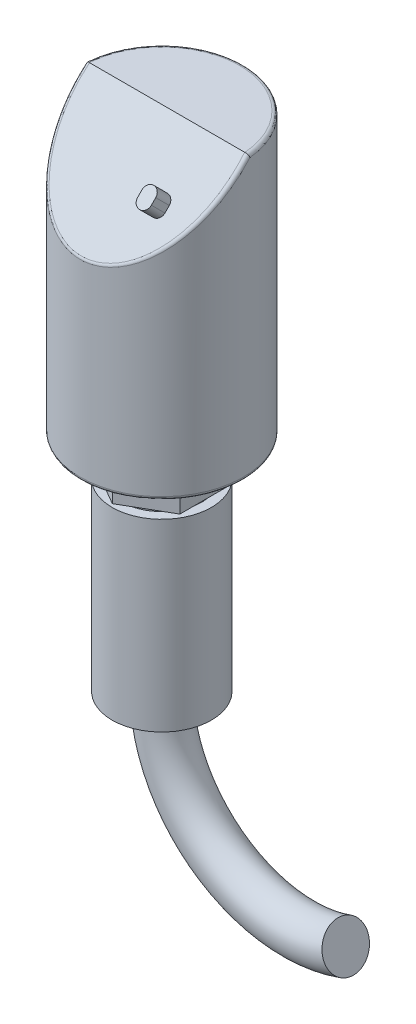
ISO-10303-21;
HEADER;
FILE_DESCRIPTION(('STEP AP214'),'2;1');
FILE_NAME('part.step','',(''),(''),'','','');
FILE_SCHEMA(('AUTOMOTIVE_DESIGN { 1 0 10303 214 1 1 1 1 }'));
ENDSEC;
DATA;
#1=APPLICATION_CONTEXT('core data for automotive mechanical design processes');
#2=APPLICATION_PROTOCOL_DEFINITION('international standard','automotive_design',2000,#1);
#3=PRODUCT_CONTEXT('',#1,'mechanical');
#4=PRODUCT('Part','Part','',(#3));
#5=PRODUCT_RELATED_PRODUCT_CATEGORY('part','',(#4));
#6=PRODUCT_DEFINITION_FORMATION('','',#4);
#7=PRODUCT_DEFINITION_CONTEXT('part definition',#1,'design');
#8=PRODUCT_DEFINITION('design','',#6,#7);
#9=PRODUCT_DEFINITION_SHAPE('','',#8);
#10=(LENGTH_UNIT() NAMED_UNIT(*) SI_UNIT(.MILLI.,.METRE.));
#11=(NAMED_UNIT(*) PLANE_ANGLE_UNIT() SI_UNIT($,.RADIAN.));
#12=(NAMED_UNIT(*) SI_UNIT($,.STERADIAN.) SOLID_ANGLE_UNIT());
#13=UNCERTAINTY_MEASURE_WITH_UNIT(LENGTH_MEASURE(1.E-05),#10,'distance_accuracy_value','');
#14=(GEOMETRIC_REPRESENTATION_CONTEXT(3) GLOBAL_UNCERTAINTY_ASSIGNED_CONTEXT((#13)) GLOBAL_UNIT_ASSIGNED_CONTEXT((#10,
#11,#12)) REPRESENTATION_CONTEXT('',''));
#15=CARTESIAN_POINT('',(0.,0.,0.));
#16=DIRECTION('',(0.,0.,1.));
#17=DIRECTION('',(1.,0.,0.));
#18=AXIS2_PLACEMENT_3D('',#15,#16,#17);
#19=CARTESIAN_POINT('',(30.5,-49.5788812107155,0.));
#20=DIRECTION('',(0.,0.,-1.));
#21=DIRECTION('',(-1.,0.,0.));
#22=AXIS2_PLACEMENT_3D('',#19,#20,#21);
#23=TOROIDAL_SURFACE('',#22,30.5,5.);
#24=CARTESIAN_POINT('',(40.931614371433,-78.2395061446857,0.));
#25=DIRECTION('',(0.939692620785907,0.342020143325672,0.));
#26=DIRECTION('',(0.,0.,-1.));
#27=AXIS2_PLACEMENT_3D('',#24,#25,#26);
#28=CIRCLE('',#27,5.);
#29=CARTESIAN_POINT('',(42.6417150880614,-82.9379692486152,0.));
#30=VERTEX_POINT('',#29);
#31=EDGE_CURVE('E11',#30,#30,#28,.T.);
#32=CARTESIAN_POINT('',(0.,-49.5788812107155,0.));
#33=DIRECTION('',(0.,-1.,0.));
#34=DIRECTION('',(0.,0.,-1.));
#35=AXIS2_PLACEMENT_3D('',#32,#33,#34);
#36=CIRCLE('',#35,5.);
#37=CARTESIAN_POINT('',(-4.99999999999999,-49.5788812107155,0.));
#38=VERTEX_POINT('',#37);
#39=EDGE_CURVE('E49',#38,#38,#36,.T.);
#40=CARTESIAN_POINT('',(30.5,-49.5788812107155,0.));
#41=DIRECTION('',(0.,0.,-1.));
#42=DIRECTION('',(-1.,0.,0.));
#43=AXIS2_PLACEMENT_3D('',#40,#41,#42);
#44=CIRCLE('',#43,35.5);
#45=EDGE_CURVE('',#30,#38,#44,.T.);
#46=ORIENTED_EDGE('',*,*,#31,.F.);
#47=ORIENTED_EDGE('',*,*,#39,.T.);
#48=ORIENTED_EDGE('',*,*,#45,.T.);
#49=ORIENTED_EDGE('',*,*,#45,.F.);
#50=EDGE_LOOP('',(#46,#48,#47,#49));
#51=FACE_BOUND('',#50,.T.);
#52=ADVANCED_FACE('F43',(#51),#23,.T.);
#53=CARTESIAN_POINT('',(40.931614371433,-78.2395061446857,0.));
#54=DIRECTION('',(0.939692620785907,0.342020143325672,0.));
#55=DIRECTION('',(0.,0.,-1.));
#56=AXIS2_PLACEMENT_3D('',#53,#54,#55);
#57=PLANE('',#56);
#58=ORIENTED_EDGE('',*,*,#31,.T.);
#59=EDGE_LOOP('',(#58));
#60=FACE_BOUND('',#59,.T.);
#61=ADVANCED_FACE('F58',(#60),#57,.T.);
#62=CARTESIAN_POINT('',(0.,-49.5788812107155,0.));
#63=DIRECTION('',(0.,-1.,0.));
#64=DIRECTION('',(0.,0.,-1.));
#65=AXIS2_PLACEMENT_3D('',#62,#63,#64);
#66=PLANE('',#65);
#67=ORIENTED_EDGE('',*,*,#39,.F.);
#68=EDGE_LOOP('',(#67));
#69=FACE_BOUND('',#68,.T.);
#70=ADVANCED_FACE('F56',(#69),#66,.F.);
#71=CLOSED_SHELL('',(#52,#61,#70));
#72=MANIFOLD_SOLID_BREP('B2',#71);
#73=CARTESIAN_POINT('',(0.,-8.57888121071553,11.049));
#74=DIRECTION('',(0.,1.,0.));
#75=DIRECTION('',(0.,0.,1.));
#76=AXIS2_PLACEMENT_3D('',#73,#74,#75);
#77=PLANE('',#76);
#78=CARTESIAN_POINT('',(0.,-8.57888121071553,0.));
#79=DIRECTION('',(0.,1.,0.));
#80=DIRECTION('',(0.,0.,1.));
#81=AXIS2_PLACEMENT_3D('',#78,#79,#80);
#82=CIRCLE('',#81,11.049);
#83=CARTESIAN_POINT('',(0.,-8.57888121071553,11.049));
#84=VERTEX_POINT('',#83);
#85=EDGE_CURVE('E132',#84,#84,#82,.T.);
#86=ORIENTED_EDGE('',*,*,#85,.T.);
#87=EDGE_LOOP('',(#86));
#88=FACE_BOUND('',#87,.T.);
#89=CARTESIAN_POINT('',(0.,-8.57888121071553,0.));
#90=DIRECTION('',(0.,1.,0.));
#91=DIRECTION('',(0.,0.,1.));
#92=AXIS2_PLACEMENT_3D('',#89,#90,#91);
#93=CIRCLE('',#92,8.95296027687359);
#94=CARTESIAN_POINT('',(0.,-8.57888121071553,8.95296027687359));
#95=VERTEX_POINT('',#94);
#96=EDGE_CURVE('E42',#95,#95,#93,.T.);
#97=ORIENTED_EDGE('',*,*,#96,.F.);
#98=EDGE_LOOP('',(#97));
#99=FACE_BOUND('',#98,.T.);
#100=ADVANCED_FACE('F92',(#88,#99),#77,.T.);
#101=CARTESIAN_POINT('',(0.,0.,0.));
#102=DIRECTION('',(0.,1.,0.));
#103=DIRECTION('',(0.,0.,1.));
#104=AXIS2_PLACEMENT_3D('',#101,#102,#103);
#105=CYLINDRICAL_SURFACE('',#104,8.95296027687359);
#106=ORIENTED_EDGE('',*,*,#96,.T.);
#107=EDGE_LOOP('',(#106));
#108=FACE_BOUND('',#107,.T.);
#109=CARTESIAN_POINT('',(0.,-11.6522812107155,0.));
#110=DIRECTION('',(0.,1.,0.));
#111=DIRECTION('',(0.,0.,1.));
#112=AXIS2_PLACEMENT_3D('',#109,#110,#111);
#113=CIRCLE('',#112,8.95296027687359);
#114=CARTESIAN_POINT('',(0.,-11.6522812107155,8.95296027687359));
#115=VERTEX_POINT('',#114);
#116=EDGE_CURVE('E98',#115,#115,#113,.T.);
#117=ORIENTED_EDGE('',*,*,#116,.F.);
#118=EDGE_LOOP('',(#117));
#119=FACE_BOUND('',#118,.T.);
#120=ADVANCED_FACE('F150',(#108,#119),#105,.F.);
#121=CARTESIAN_POINT('',(0.,-11.6522812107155,8.95296027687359));
#122=DIRECTION('',(0.,-1.,0.));
#123=DIRECTION('',(0.,0.,-1.));
#124=AXIS2_PLACEMENT_3D('',#121,#122,#123);
#125=PLANE('',#124);
#126=ORIENTED_EDGE('',*,*,#116,.T.);
#127=EDGE_LOOP('',(#126));
#128=FACE_BOUND('',#127,.T.);
#129=CARTESIAN_POINT('',(0.,-11.6522812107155,0.));
#130=DIRECTION('',(0.,1.,0.));
#131=DIRECTION('',(0.,0.,1.));
#132=AXIS2_PLACEMENT_3D('',#129,#130,#131);
#133=CIRCLE('',#132,9.49820774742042);
#134=CARTESIAN_POINT('',(0.,-11.6522812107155,9.49820774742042));
#135=VERTEX_POINT('',#134);
#136=EDGE_CURVE('E102',#135,#135,#133,.T.);
#137=ORIENTED_EDGE('',*,*,#136,.F.);
#138=EDGE_LOOP('',(#137));
#139=FACE_BOUND('',#138,.T.);
#140=ADVANCED_FACE('F154',(#128,#139),#125,.T.);
#141=CARTESIAN_POINT('',(0.,0.,0.));
#142=DIRECTION('',(0.,1.,0.));
#143=DIRECTION('',(0.,0.,1.));
#144=AXIS2_PLACEMENT_3D('',#141,#142,#143);
#145=CYLINDRICAL_SURFACE('',#144,9.49820774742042);
#146=ORIENTED_EDGE('',*,*,#136,.T.);
#147=EDGE_LOOP('',(#146));
#148=FACE_BOUND('',#147,.T.);
#149=CARTESIAN_POINT('',(0.,-13.3032812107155,0.));
#150=DIRECTION('',(0.,1.,0.));
#151=DIRECTION('',(0.,0.,1.));
#152=AXIS2_PLACEMENT_3D('',#149,#150,#151);
#153=CIRCLE('',#152,9.49820774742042);
#154=CARTESIAN_POINT('',(0.,-13.3032812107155,9.49820774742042));
#155=VERTEX_POINT('',#154);
#156=EDGE_CURVE('E106',#155,#155,#153,.T.);
#157=ORIENTED_EDGE('',*,*,#156,.F.);
#158=EDGE_LOOP('',(#157));
#159=FACE_BOUND('',#158,.T.);
#160=ADVANCED_FACE('F158',(#148,#159),#145,.F.);
#161=CARTESIAN_POINT('',(0.,-13.3032812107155,9.49820774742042));
#162=DIRECTION('',(0.,1.,0.));
#163=DIRECTION('',(0.,0.,1.));
#164=AXIS2_PLACEMENT_3D('',#161,#162,#163);
#165=PLANE('',#164);
#166=ORIENTED_EDGE('',*,*,#156,.T.);
#167=EDGE_LOOP('',(#166));
#168=FACE_BOUND('',#167,.T.);
#169=CARTESIAN_POINT('',(0.,-13.3032812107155,0.));
#170=DIRECTION('',(0.,1.,0.));
#171=DIRECTION('',(0.,0.,1.));
#172=AXIS2_PLACEMENT_3D('',#169,#170,#171);
#173=CIRCLE('',#172,8.95296027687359);
#174=CARTESIAN_POINT('',(0.,-13.3032812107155,8.95296027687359));
#175=VERTEX_POINT('',#174);
#176=EDGE_CURVE('E111',#175,#175,#173,.T.);
#177=ORIENTED_EDGE('',*,*,#176,.F.);
#178=EDGE_LOOP('',(#177));
#179=FACE_BOUND('',#178,.T.);
#180=ADVANCED_FACE('F164',(#168,#179),#165,.T.);
#181=CARTESIAN_POINT('',(0.,0.,0.));
#182=DIRECTION('',(0.,1.,0.));
#183=DIRECTION('',(0.,0.,1.));
#184=AXIS2_PLACEMENT_3D('',#181,#182,#183);
#185=CYLINDRICAL_SURFACE('',#184,8.95296027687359);
#186=ORIENTED_EDGE('',*,*,#176,.T.);
#187=EDGE_LOOP('',(#186));
#188=FACE_BOUND('',#187,.T.);
#189=CARTESIAN_POINT('',(0.,-14.8272812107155,0.));
#190=DIRECTION('',(0.,1.,0.));
#191=DIRECTION('',(0.,0.,1.));
#192=AXIS2_PLACEMENT_3D('',#189,#190,#191);
#193=CIRCLE('',#192,8.95296027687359);
#194=CARTESIAN_POINT('',(0.,-14.8272812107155,8.95296027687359));
#195=VERTEX_POINT('',#194);
#196=EDGE_CURVE('E114',#195,#195,#193,.T.);
#197=ORIENTED_EDGE('',*,*,#196,.F.);
#198=EDGE_LOOP('',(#197));
#199=FACE_BOUND('',#198,.T.);
#200=ADVANCED_FACE('F168',(#188,#199),#185,.F.);
#201=CARTESIAN_POINT('',(0.,-14.8272812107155,8.95296027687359));
#202=DIRECTION('',(0.,-1.,0.));
#203=DIRECTION('',(0.,0.,-1.));
#204=AXIS2_PLACEMENT_3D('',#201,#202,#203);
#205=PLANE('',#204);
#206=ORIENTED_EDGE('',*,*,#196,.T.);
#207=EDGE_LOOP('',(#206));
#208=FACE_BOUND('',#207,.T.);
#209=CARTESIAN_POINT('',(0.,-14.8272812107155,0.));
#210=DIRECTION('',(0.,1.,0.));
#211=DIRECTION('',(0.,0.,1.));
#212=AXIS2_PLACEMENT_3D('',#209,#210,#211);
#213=CIRCLE('',#212,9.49820774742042);
#214=CARTESIAN_POINT('',(0.,-14.8272812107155,9.49820774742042));
#215=VERTEX_POINT('',#214);
#216=EDGE_CURVE('E117',#215,#215,#213,.T.);
#217=ORIENTED_EDGE('',*,*,#216,.F.);
#218=EDGE_LOOP('',(#217));
#219=FACE_BOUND('',#218,.T.);
#220=ADVANCED_FACE('F172',(#208,#219),#205,.T.);
#221=CARTESIAN_POINT('',(0.,0.,0.));
#222=DIRECTION('',(0.,1.,0.));
#223=DIRECTION('',(0.,0.,1.));
#224=AXIS2_PLACEMENT_3D('',#221,#222,#223);
#225=CYLINDRICAL_SURFACE('',#224,9.49820774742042);
#226=ORIENTED_EDGE('',*,*,#216,.T.);
#227=EDGE_LOOP('',(#226));
#228=FACE_BOUND('',#227,.T.);
#229=CARTESIAN_POINT('',(0.,-17.3772812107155,0.));
#230=DIRECTION('',(0.,1.,0.));
#231=DIRECTION('',(0.,0.,1.));
#232=AXIS2_PLACEMENT_3D('',#229,#230,#231);
#233=CIRCLE('',#232,9.49820774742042);
#234=CARTESIAN_POINT('',(0.,-17.3772812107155,9.49820774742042));
#235=VERTEX_POINT('',#234);
#236=EDGE_CURVE('E120',#235,#235,#233,.T.);
#237=ORIENTED_EDGE('',*,*,#236,.F.);
#238=EDGE_LOOP('',(#237));
#239=FACE_BOUND('',#238,.T.);
#240=ADVANCED_FACE('F176',(#228,#239),#225,.F.);
#241=CARTESIAN_POINT('',(0.,-17.3772812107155,9.49820774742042));
#242=DIRECTION('',(0.,1.,0.));
#243=DIRECTION('',(0.,0.,1.));
#244=AXIS2_PLACEMENT_3D('',#241,#242,#243);
#245=PLANE('',#244);
#246=ORIENTED_EDGE('',*,*,#236,.T.);
#247=EDGE_LOOP('',(#246));
#248=FACE_BOUND('',#247,.T.);
#249=CARTESIAN_POINT('',(0.,-17.3772812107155,0.));
#250=DIRECTION('',(0.,1.,0.));
#251=DIRECTION('',(0.,0.,1.));
#252=AXIS2_PLACEMENT_3D('',#249,#250,#251);
#253=CIRCLE('',#252,7.9755);
#254=CARTESIAN_POINT('',(0.,-17.3772812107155,7.9755));
#255=VERTEX_POINT('',#254);
#256=EDGE_CURVE('E123',#255,#255,#253,.T.);
#257=ORIENTED_EDGE('',*,*,#256,.F.);
#258=EDGE_LOOP('',(#257));
#259=FACE_BOUND('',#258,.T.);
#260=ADVANCED_FACE('F180',(#248,#259),#245,.T.);
#261=CARTESIAN_POINT('',(0.,0.,0.));
#262=DIRECTION('',(0.,1.,0.));
#263=DIRECTION('',(0.,0.,1.));
#264=AXIS2_PLACEMENT_3D('',#261,#262,#263);
#265=CYLINDRICAL_SURFACE('',#264,7.9755);
#266=ORIENTED_EDGE('',*,*,#256,.T.);
#267=EDGE_LOOP('',(#266));
#268=FACE_BOUND('',#267,.T.);
#269=CARTESIAN_POINT('',(0.,-49.5788812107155,0.));
#270=DIRECTION('',(0.,1.,0.));
#271=DIRECTION('',(0.,0.,1.));
#272=AXIS2_PLACEMENT_3D('',#269,#270,#271);
#273=CIRCLE('',#272,7.9755);
#274=CARTESIAN_POINT('',(0.,-49.5788812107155,7.9755));
#275=VERTEX_POINT('',#274);
#276=EDGE_CURVE('E126',#275,#275,#273,.T.);
#277=ORIENTED_EDGE('',*,*,#276,.F.);
#278=EDGE_LOOP('',(#277));
#279=FACE_BOUND('',#278,.T.);
#280=ADVANCED_FACE('F146',(#268,#279),#265,.F.);
#281=CARTESIAN_POINT('',(0.,-49.5788812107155,7.9755));
#282=DIRECTION('',(0.,-1.,0.));
#283=DIRECTION('',(0.,0.,-1.));
#284=AXIS2_PLACEMENT_3D('',#281,#282,#283);
#285=PLANE('',#284);
#286=ORIENTED_EDGE('',*,*,#276,.T.);
#287=EDGE_LOOP('',(#286));
#288=FACE_BOUND('',#287,.T.);
#289=CARTESIAN_POINT('',(0.,-49.5788812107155,0.));
#290=DIRECTION('',(0.,1.,0.));
#291=DIRECTION('',(0.,0.,1.));
#292=AXIS2_PLACEMENT_3D('',#289,#290,#291);
#293=CIRCLE('',#292,11.049);
#294=CARTESIAN_POINT('',(0.,-49.5788812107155,11.049));
#295=VERTEX_POINT('',#294);
#296=EDGE_CURVE('E129',#295,#295,#293,.T.);
#297=ORIENTED_EDGE('',*,*,#296,.F.);
#298=EDGE_LOOP('',(#297));
#299=FACE_BOUND('',#298,.T.);
#300=ADVANCED_FACE('F140',(#288,#299),#285,.T.);
#301=CARTESIAN_POINT('',(0.,0.,0.));
#302=DIRECTION('',(0.,1.,0.));
#303=DIRECTION('',(0.,0.,1.));
#304=AXIS2_PLACEMENT_3D('',#301,#302,#303);
#305=CYLINDRICAL_SURFACE('',#304,11.049);
#306=ORIENTED_EDGE('',*,*,#296,.T.);
#307=EDGE_LOOP('',(#306));
#308=FACE_BOUND('',#307,.T.);
#309=ORIENTED_EDGE('',*,*,#85,.F.);
#310=EDGE_LOOP('',(#309));
#311=FACE_BOUND('',#310,.T.);
#312=ADVANCED_FACE('F138',(#308,#311),#305,.T.);
#313=CLOSED_SHELL('',(#100,#120,#140,#160,#180,#200,#220,#240,#260,#280,#300,#312));
#314=MANIFOLD_SOLID_BREP('B6',#313);
#315=CARTESIAN_POINT('',(0.,-21.336,0.));
#316=DIRECTION('',(0.,-1.,0.));
#317=DIRECTION('',(0.,0.,-1.));
#318=AXIS2_PLACEMENT_3D('',#315,#316,#317);
#319=PLANE('',#318);
#320=CARTESIAN_POINT('',(0.,-21.336,-1.91));
#321=DIRECTION('',(0.,-1.,0.));
#322=DIRECTION('',(0.,0.,-1.));
#323=AXIS2_PLACEMENT_3D('',#320,#321,#322);
#324=CIRCLE('',#323,1.525);
#325=CARTESIAN_POINT('',(0.,-21.336,-3.435));
#326=VERTEX_POINT('',#325);
#327=EDGE_CURVE('E1143',#326,#326,#324,.T.);
#328=ORIENTED_EDGE('',*,*,#327,.F.);
#329=EDGE_LOOP('',(#328));
#330=FACE_BOUND('',#329,.T.);
#331=CARTESIAN_POINT('',(5.08,-21.336,0.));
#332=DIRECTION('',(0.,-1.,0.));
#333=DIRECTION('',(-1.,0.,0.));
#334=AXIS2_PLACEMENT_3D('',#331,#332,#333);
#335=CIRCLE('',#334,1.525);
#336=CARTESIAN_POINT('',(3.555,-21.336,0.));
#337=VERTEX_POINT('',#336);
#338=EDGE_CURVE('E1166',#337,#337,#335,.T.);
#339=ORIENTED_EDGE('',*,*,#338,.F.);
#340=EDGE_LOOP('',(#339));
#341=FACE_BOUND('',#340,.T.);
#342=CARTESIAN_POINT('',(-3.59210244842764,-21.336,-3.59210244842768));
#343=DIRECTION('',(0.,-1.,0.));
#344=DIRECTION('',(0.707106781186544,0.,0.707106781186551));
#345=AXIS2_PLACEMENT_3D('',#342,#343,#344);
#346=CIRCLE('',#345,1.525);
#347=CARTESIAN_POINT('',(-2.51376460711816,-21.336,-2.51376460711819));
#348=VERTEX_POINT('',#347);
#349=EDGE_CURVE('E1190',#348,#348,#346,.T.);
#350=ORIENTED_EDGE('',*,*,#349,.F.);
#351=EDGE_LOOP('',(#350));
#352=FACE_BOUND('',#351,.T.);
#353=CARTESIAN_POINT('',(-3.59210244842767,-21.336,3.59210244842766));
#354=DIRECTION('',(0.,-1.,0.));
#355=DIRECTION('',(0.707106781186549,0.,-0.707106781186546));
#356=AXIS2_PLACEMENT_3D('',#353,#354,#355);
#357=CIRCLE('',#356,1.525);
#358=CARTESIAN_POINT('',(-2.51376460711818,-21.336,2.51376460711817));
#359=VERTEX_POINT('',#358);
#360=EDGE_CURVE('E1214',#359,#359,#357,.T.);
#361=ORIENTED_EDGE('',*,*,#360,.F.);
#362=EDGE_LOOP('',(#361));
#363=FACE_BOUND('',#362,.T.);
#364=CARTESIAN_POINT('',(0.,-21.336,5.08));
#365=DIRECTION('',(0.,-1.,0.));
#366=DIRECTION('',(0.,0.,-1.));
#367=AXIS2_PLACEMENT_3D('',#364,#365,#366);
#368=CIRCLE('',#367,1.525);
#369=CARTESIAN_POINT('',(0.,-21.336,3.555));
#370=VERTEX_POINT('',#369);
#371=EDGE_CURVE('E1230',#370,#370,#368,.T.);
#372=ORIENTED_EDGE('',*,*,#371,.F.);
#373=EDGE_LOOP('',(#372));
#374=FACE_BOUND('',#373,.T.);
#375=CARTESIAN_POINT('',(0.,-21.336,0.));
#376=DIRECTION('',(0.,-1.,0.));
#377=DIRECTION('',(0.,0.,-1.));
#378=AXIS2_PLACEMENT_3D('',#375,#376,#377);
#379=CIRCLE('',#378,7.747);
#380=CARTESIAN_POINT('',(0.,-21.336,-7.747));
#381=VERTEX_POINT('',#380);
#382=EDGE_CURVE('E1236',#381,#381,#379,.T.);
#383=ORIENTED_EDGE('',*,*,#382,.T.);
#384=EDGE_LOOP('',(#383));
#385=FACE_BOUND('',#384,.T.);
#386=CARTESIAN_POINT('',(-5.08,-21.336,0.));
#387=DIRECTION('',(0.,-1.,0.));
#388=DIRECTION('',(1.,0.,0.));
#389=AXIS2_PLACEMENT_3D('',#386,#387,#388);
#390=CIRCLE('',#389,1.525);
#391=CARTESIAN_POINT('',(-3.555,-21.336,0.));
#392=VERTEX_POINT('',#391);
#393=EDGE_CURVE('E1202',#392,#392,#390,.T.);
#394=ORIENTED_EDGE('',*,*,#393,.F.);
#395=EDGE_LOOP('',(#394));
#396=FACE_BOUND('',#395,.T.);
#397=CARTESIAN_POINT('',(3.59210244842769,-21.336,-3.59210244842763));
#398=DIRECTION('',(0.,-1.,0.));
#399=DIRECTION('',(-0.707106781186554,0.,0.707106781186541));
#400=AXIS2_PLACEMENT_3D('',#397,#398,#399);
#401=CIRCLE('',#400,1.525);
#402=CARTESIAN_POINT('',(2.5137646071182,-21.336,-2.51376460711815));
#403=VERTEX_POINT('',#402);
#404=EDGE_CURVE('E1178',#403,#403,#401,.T.);
#405=ORIENTED_EDGE('',*,*,#404,.F.);
#406=EDGE_LOOP('',(#405));
#407=FACE_BOUND('',#406,.T.);
#408=CARTESIAN_POINT('',(3.59210244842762,-21.336,3.59210244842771));
#409=DIRECTION('',(0.,-1.,0.));
#410=DIRECTION('',(-0.707106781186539,0.,-0.707106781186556));
#411=AXIS2_PLACEMENT_3D('',#408,#409,#410);
#412=CIRCLE('',#411,1.525);
#413=CARTESIAN_POINT('',(2.51376460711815,-21.336,2.51376460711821));
#414=VERTEX_POINT('',#413);
#415=EDGE_CURVE('E1154',#414,#414,#412,.T.);
#416=ORIENTED_EDGE('',*,*,#415,.F.);
#417=EDGE_LOOP('',(#416));
#418=FACE_BOUND('',#417,.T.);
#419=ADVANCED_FACE('F273',(#330,#341,#352,#363,#374,#385,#396,#407,#418),#319,.T.);
#420=CARTESIAN_POINT('',(0.,0.,0.));
#421=DIRECTION('',(0.,1.,0.));
#422=DIRECTION('',(0.,0.,1.));
#423=AXIS2_PLACEMENT_3D('',#420,#421,#422);
#424=PLANE('',#423);
#425=CARTESIAN_POINT('',(0.,0.,0.));
#426=DIRECTION('',(0.,1.,0.));
#427=DIRECTION('',(0.,0.,1.));
#428=AXIS2_PLACEMENT_3D('',#425,#426,#427);
#429=CIRCLE('',#428,17.34185);
#430=CARTESIAN_POINT('',(0.,0.,17.34185));
#431=VERTEX_POINT('',#430);
#432=EDGE_CURVE('E281',#431,#431,#429,.F.);
#433=ORIENTED_EDGE('',*,*,#432,.T.);
#434=EDGE_LOOP('',(#433));
#435=FACE_BOUND('',#434,.T.);
#436=CARTESIAN_POINT('',(0.,0.,14.5706486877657));
#437=DIRECTION('',(0.,-1.,0.));
#438=DIRECTION('',(0.,0.,-1.));
#439=AXIS2_PLACEMENT_3D('',#436,#437,#438);
#440=CIRCLE('',#439,1.984375);
#441=CARTESIAN_POINT('',(0.,0.,12.5862736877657));
#442=VERTEX_POINT('',#441);
#443=EDGE_CURVE('E392',#442,#442,#440,.T.);
#444=ORIENTED_EDGE('',*,*,#443,.F.);
#445=EDGE_LOOP('',(#444));
#446=FACE_BOUND('',#445,.T.);
#447=DIRECTION('',(-0.866025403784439,0.,0.5));
#448=VECTOR('',#447,1.);
#449=CARTESIAN_POINT('',(9.52499999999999,0.,5.49926131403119));
#450=LINE('',#449,#448);
#451=CARTESIAN_POINT('',(9.52499999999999,0.,5.49926131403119));
#452=VERTEX_POINT('',#451);
#453=CARTESIAN_POINT('',(0.,0.,10.9985226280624));
#454=VERTEX_POINT('',#453);
#455=EDGE_CURVE('E391',#452,#454,#450,.T.);
#456=ORIENTED_EDGE('',*,*,#455,.F.);
#457=DIRECTION('',(0.,0.,1.));
#458=VECTOR('',#457,1.);
#459=CARTESIAN_POINT('',(9.525,0.,-5.49926131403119));
#460=LINE('',#459,#458);
#461=CARTESIAN_POINT('',(9.525,0.,-5.49926131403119));
#462=VERTEX_POINT('',#461);
#463=EDGE_CURVE('E388',#462,#452,#460,.T.);
#464=ORIENTED_EDGE('',*,*,#463,.F.);
#465=DIRECTION('',(0.866025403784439,0.,0.5));
#466=VECTOR('',#465,1.);
#467=CARTESIAN_POINT('',(0.,0.,-10.9985226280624));
#468=LINE('',#467,#466);
#469=CARTESIAN_POINT('',(0.,0.,-10.9985226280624));
#470=VERTEX_POINT('',#469);
#471=EDGE_CURVE('E1284',#470,#462,#468,.T.);
#472=ORIENTED_EDGE('',*,*,#471,.F.);
#473=DIRECTION('',(0.866025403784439,0.,-0.5));
#474=VECTOR('',#473,1.);
#475=CARTESIAN_POINT('',(-9.525,0.,-5.49926131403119));
#476=LINE('',#475,#474);
#477=CARTESIAN_POINT('',(-9.525,0.,-5.49926131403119));
#478=VERTEX_POINT('',#477);
#479=EDGE_CURVE('E1281',#478,#470,#476,.T.);
#480=ORIENTED_EDGE('',*,*,#479,.F.);
#481=DIRECTION('',(0.,0.,-1.));
#482=VECTOR('',#481,1.);
#483=CARTESIAN_POINT('',(-9.525,0.,5.49926131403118));
#484=LINE('',#483,#482);
#485=CARTESIAN_POINT('',(-9.525,0.,5.49926131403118));
#486=VERTEX_POINT('',#485);
#487=EDGE_CURVE('E293',#486,#478,#484,.T.);
#488=ORIENTED_EDGE('',*,*,#487,.F.);
#489=DIRECTION('',(-0.866025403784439,0.,-0.5));
#490=VECTOR('',#489,1.);
#491=CARTESIAN_POINT('',(0.,0.,10.9985226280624));
#492=LINE('',#491,#490);
#493=EDGE_CURVE('E288',#454,#486,#492,.T.);
#494=ORIENTED_EDGE('',*,*,#493,.F.);
#495=EDGE_LOOP('',(#456,#464,#472,#480,#488,#494));
#496=FACE_BOUND('',#495,.T.);
#497=ADVANCED_FACE('F505',(#435,#446,#496),#424,.F.);
#498=CARTESIAN_POINT('',(-34.7770970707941,14.2754602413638,46.9249852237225));
#499=DIRECTION('',(0.,0.707106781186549,0.707106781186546));
#500=DIRECTION('',(0.,-0.707106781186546,0.707106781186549));
#501=AXIS2_PLACEMENT_3D('',#498,#499,#500);
#502=PLANE('',#501);
#503=DIRECTION('',(1.,0.,0.));
#504=VECTOR('',#503,1.);
#505=CARTESIAN_POINT('',(0.,62.3824,-1.18195453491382));
#506=LINE('',#505,#504);
#507=CARTESIAN_POINT('',(-17.2540123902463,62.3824,-1.18195453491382));
#508=VERTEX_POINT('',#507);
#509=CARTESIAN_POINT('',(17.2540123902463,62.3824,-1.18195453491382));
#510=VERTEX_POINT('',#509);
#511=EDGE_CURVE('E434',#508,#510,#506,.T.);
#512=ORIENTED_EDGE('',*,*,#511,.F.);
#513=CARTESIAN_POINT('',(0.,60.6391794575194,0.561266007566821));
#514=DIRECTION('',(0.,0.707106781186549,0.707106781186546));
#515=DIRECTION('',(0.,-0.707106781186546,0.707106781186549));
#516=AXIS2_PLACEMENT_3D('',#513,#514,#515);
#517=ELLIPSE('',#516,24.5250794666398,17.34185);
#518=EDGE_CURVE('E437',#508,#510,#517,.T.);
#519=ORIENTED_EDGE('',*,*,#518,.T.);
#520=EDGE_LOOP('',(#512,#519));
#521=FACE_BOUND('',#520,.T.);
#522=DIRECTION('',(0.,0.707106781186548,-0.707106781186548));
#523=VECTOR('',#522,1.);
#524=CARTESIAN_POINT('',(9.8101114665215,52.0910878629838,9.10935760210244));
#525=LINE('',#524,#523);
#526=CARTESIAN_POINT('',(9.8101114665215,52.0910878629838,9.10935760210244));
#527=VERTEX_POINT('',#526);
#528=CARTESIAN_POINT('',(9.8101114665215,53.0609555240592,8.13948994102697));
#529=VERTEX_POINT('',#528);
#530=EDGE_CURVE('E418',#527,#529,#525,.T.);
#531=ORIENTED_EDGE('',*,*,#530,.F.);
#532=CARTESIAN_POINT('',(8.2861114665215,52.0910878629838,9.10935760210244));
#533=DIRECTION('',(0.,0.707106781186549,0.707106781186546));
#534=DIRECTION('',(0.,-0.707106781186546,0.707106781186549));
#535=AXIS2_PLACEMENT_3D('',#532,#533,#534);
#536=CIRCLE('',#535,1.524);
#537=CARTESIAN_POINT('',(6.7621114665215,52.0910878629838,9.10935760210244));
#538=VERTEX_POINT('',#537);
#539=EDGE_CURVE('E415',#538,#527,#536,.T.);
#540=ORIENTED_EDGE('',*,*,#539,.F.);
#541=DIRECTION('',(0.,-0.707106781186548,0.707106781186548));
#542=VECTOR('',#541,1.);
#543=CARTESIAN_POINT('',(6.7621114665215,52.0910878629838,9.10935760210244));
#544=LINE('',#543,#542);
#545=CARTESIAN_POINT('',(6.7621114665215,53.0609555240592,8.13948994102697));
#546=VERTEX_POINT('',#545);
#547=EDGE_CURVE('E408',#546,#538,#544,.T.);
#548=ORIENTED_EDGE('',*,*,#547,.F.);
#549=CARTESIAN_POINT('',(8.2861114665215,53.0609555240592,8.13948994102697));
#550=DIRECTION('',(0.,0.707106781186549,0.707106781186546));
#551=DIRECTION('',(0.,-0.707106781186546,0.707106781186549));
#552=AXIS2_PLACEMENT_3D('',#549,#550,#551);
#553=CIRCLE('',#552,1.524);
#554=EDGE_CURVE('E421',#529,#546,#553,.T.);
#555=ORIENTED_EDGE('',*,*,#554,.F.);
#556=EDGE_LOOP('',(#531,#540,#548,#555));
#557=FACE_BOUND('',#556,.T.);
#558=ADVANCED_FACE('F469',(#521,#557),#502,.T.);
#559=CARTESIAN_POINT('',(0.,62.3824,0.));
#560=DIRECTION('',(0.,-1.,0.));
#561=DIRECTION('',(0.,0.,-1.));
#562=AXIS2_PLACEMENT_3D('',#559,#560,#561);
#563=CYLINDRICAL_SURFACE('',#562,18.1356);
#564=CARTESIAN_POINT('',(0.,61.58865,0.));
#565=DIRECTION('',(0.,1.,0.));
#566=DIRECTION('',(0.,0.,1.));
#567=AXIS2_PLACEMENT_3D('',#564,#565,#566);
#568=CIRCLE('',#567,18.1356);
#569=CARTESIAN_POINT('',(-18.0666530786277,61.58865,-1.57988414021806));
#570=VERTEX_POINT('',#569);
#571=CARTESIAN_POINT('',(18.0666530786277,61.58865,-1.57988414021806));
#572=VERTEX_POINT('',#571);
#573=EDGE_CURVE('E493',#570,#572,#568,.F.);
#574=ORIENTED_EDGE('',*,*,#573,.T.);
#575=CARTESIAN_POINT('',(0.,60.0779134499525,0.));
#576=DIRECTION('',(0.,-0.722746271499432,-0.69111346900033));
#577=DIRECTION('',(0.,-0.69111346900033,0.722746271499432));
#578=AXIS2_PLACEMENT_3D('',#575,#576,#577);
#579=ELLIPSE('',#578,25.0926233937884,18.1356);
#580=EDGE_CURVE('E490',#572,#570,#579,.T.);
#581=ORIENTED_EDGE('',*,*,#580,.T.);
#582=EDGE_LOOP('',(#574,#581));
#583=FACE_BOUND('',#582,.T.);
#584=CARTESIAN_POINT('',(0.,0.793750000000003,0.));
#585=DIRECTION('',(0.,1.,0.));
#586=DIRECTION('',(0.,0.,1.));
#587=AXIS2_PLACEMENT_3D('',#584,#585,#586);
#588=CIRCLE('',#587,18.1356);
#589=CARTESIAN_POINT('',(0.,0.793750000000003,18.1356));
#590=VERTEX_POINT('',#589);
#591=EDGE_CURVE('E496',#590,#590,#588,.T.);
#592=ORIENTED_EDGE('',*,*,#591,.T.);
#593=EDGE_LOOP('',(#592));
#594=FACE_BOUND('',#593,.T.);
#595=ADVANCED_FACE('F472',(#583,#594),#563,.T.);
#596=CARTESIAN_POINT('',(0.,62.3824,0.));
#597=DIRECTION('',(0.,1.,0.));
#598=DIRECTION('',(0.,0.,1.));
#599=AXIS2_PLACEMENT_3D('',#596,#597,#598);
#600=PLANE('',#599);
#601=ORIENTED_EDGE('',*,*,#511,.T.);
#602=CARTESIAN_POINT('',(0.,42.7360634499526,18.1356));
#603=CARTESIAN_POINT('',(0.,42.8939501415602,18.1356));
#604=CARTESIAN_POINT('',(0.,43.0398184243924,18.0751793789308));
#605=CARTESIAN_POINT('',(0.,43.1856867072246,18.0147587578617));
#606=CARTESIAN_POINT('',(0.,43.2973294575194,17.9031160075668));
#607=CARTESIAN_POINT('',(0.396778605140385,42.7360634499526,18.1356));
#608=CARTESIAN_POINT('',(0.393324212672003,42.8939501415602,18.1356));
#609=CARTESIAN_POINT('',(0.388811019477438,43.0398184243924,18.0751793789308));
#610=CARTESIAN_POINT('',(0.384297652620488,43.1856867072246,18.0147587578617));
#611=CARTESIAN_POINT('',(0.379412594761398,43.2973294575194,17.9031160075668));
#612=CARTESIAN_POINT('',(0.793557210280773,42.7485375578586,18.1225549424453));
#613=CARTESIAN_POINT('',(0.786676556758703,42.90646083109,18.1227803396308));
#614=CARTESIAN_POINT('',(0.777622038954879,43.05233775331,18.0625055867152));
#615=CARTESIAN_POINT('',(0.768622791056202,43.1982182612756,18.0022272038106));
#616=CARTESIAN_POINT('',(0.7588251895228,43.3098035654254,17.8906418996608));
#617=CARTESIAN_POINT('',(1.58371455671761,42.7981648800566,18.0706561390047));
#618=CARTESIAN_POINT('',(1.56998557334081,42.9562268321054,18.0717844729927));
#619=CARTESIAN_POINT('',(1.55193753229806,43.1021453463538,18.0120830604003));
#620=CARTESIAN_POINT('',(1.5339444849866,43.2480673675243,17.9523780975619));
#621=CARTESIAN_POINT('',(1.51439931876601,43.3594308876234,17.8410145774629));
#622=CARTESIAN_POINT('',(1.97709323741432,42.8353185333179,18.0318019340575));
#623=CARTESIAN_POINT('',(1.95999722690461,42.9934896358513,18.0336005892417));
#624=CARTESIAN_POINT('',(1.93744194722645,43.1394340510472,17.9743338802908));
#625=CARTESIAN_POINT('',(1.91499475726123,43.2853924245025,17.9150530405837));
#626=CARTESIAN_POINT('',(1.89056079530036,43.3965845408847,17.8038609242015));
#627=CARTESIAN_POINT('',(2.76371562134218,42.9343463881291,17.9282414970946));
#628=CARTESIAN_POINT('',(2.73989579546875,43.0927957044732,17.931837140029));
#629=CARTESIAN_POINT('',(2.70836818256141,43.2388230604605,17.8737161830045));
#630=CARTESIAN_POINT('',(2.67695198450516,43.3848647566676,17.8155807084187));
#631=CARTESIAN_POINT('',(2.64275467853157,43.4956123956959,17.7048330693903));
#632=CARTESIAN_POINT('',(3.15684895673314,42.9966202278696,17.8631173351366));
#633=CARTESIAN_POINT('',(3.12972530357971,43.1552534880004,17.8678327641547));
#634=CARTESIAN_POINT('',(3.09368266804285,43.3013244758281,17.8104415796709));
#635=CARTESIAN_POINT('',(3.05780248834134,43.4474272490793,17.7530182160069));
#636=CARTESIAN_POINT('',(3.01868154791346,43.5578862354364,17.6425592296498));
#637=CARTESIAN_POINT('',(3.93331484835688,43.1446105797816,17.7083533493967));
#638=CARTESIAN_POINT('',(3.89970700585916,43.3036623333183,17.7157433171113));
#639=CARTESIAN_POINT('',(3.85478071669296,43.4498581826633,17.6600675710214));
#640=CARTESIAN_POINT('',(3.81001687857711,43.59608565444,17.6043598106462));
#641=CARTESIAN_POINT('',(3.76116346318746,43.7058765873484,17.4945688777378));
#642=CARTESIAN_POINT('',(4.31664696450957,43.2303281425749,17.6187124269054));
#643=CARTESIAN_POINT('',(4.27990724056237,43.3896346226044,17.6276364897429));
#644=CARTESIAN_POINT('',(4.23056385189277,43.5358915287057,17.5729670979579));
#645=CARTESIAN_POINT('',(4.18142768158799,43.6822028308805,17.5182426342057));
#646=CARTESIAN_POINT('',(4.1277180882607,43.7915941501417,17.4088513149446));
#647=CARTESIAN_POINT('',(5.0825593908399,43.4265711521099,17.4134872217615));
#648=CARTESIAN_POINT('',(5.03964440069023,43.5864400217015,17.4259352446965));
#649=CARTESIAN_POINT('',(4.98149181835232,43.7328617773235,17.3735489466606));
#650=CARTESIAN_POINT('',(4.92355915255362,43.8793411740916,17.3211042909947));
#651=CARTESIAN_POINT('',(4.86010843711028,43.9878371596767,17.2126083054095));
#652=CARTESIAN_POINT('',(5.46475859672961,43.5377747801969,17.297193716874));
#653=CARTESIAN_POINT('',(5.41884392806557,43.6979777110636,17.3116184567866));
#654=CARTESIAN_POINT('',(5.35626606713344,43.8444794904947,17.2605418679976));
#655=CARTESIAN_POINT('',(5.29394890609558,43.9910681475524,17.2093773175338));
#656=CARTESIAN_POINT('',(5.22557973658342,44.0990407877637,17.1014046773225));
#657=CARTESIAN_POINT('',(6.21415650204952,43.7814837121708,17.0423300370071));
#658=CARTESIAN_POINT('',(6.16247389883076,43.9423924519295,17.0610991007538));
#659=CARTESIAN_POINT('',(6.09123087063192,44.0891025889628,17.0128664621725));
#660=CARTESIAN_POINT('',(6.02024930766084,44.2358996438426,16.9645458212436));
#661=CARTESIAN_POINT('',(5.94217836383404,44.3427497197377,16.8576957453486));
#662=CARTESIAN_POINT('',(6.58134783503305,43.9139993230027,16.9037490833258));
#663=CARTESIAN_POINT('',(6.52693390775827,44.0753105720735,16.9248544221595));
#664=CARTESIAN_POINT('',(6.45141426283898,44.2221183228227,16.8781876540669));
#665=CARTESIAN_POINT('',(6.3761887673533,44.3690453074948,16.8314001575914));
#666=CARTESIAN_POINT('',(6.29329864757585,44.4752653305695,16.7251801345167));
#667=CARTESIAN_POINT('',(7.31352495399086,44.2040045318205,16.6004701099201));
#668=CARTESIAN_POINT('',(7.25382573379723,44.3661740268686,16.6266911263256));
#669=CARTESIAN_POINT('',(7.16976622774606,44.5132273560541,16.5834287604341));
#670=CARTESIAN_POINT('',(7.08602450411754,44.6604094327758,16.5400360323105));
#671=CARTESIAN_POINT('',(6.99343019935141,44.7652705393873,16.4351749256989));
#672=CARTESIAN_POINT('',(7.67782337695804,44.3622863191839,16.4349436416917));
#673=CARTESIAN_POINT('',(7.61560050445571,44.5249443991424,16.4639259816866));
#674=CARTESIAN_POINT('',(7.52726655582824,44.6721162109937,16.4225427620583));
#675=CARTESIAN_POINT('',(7.43927651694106,44.819454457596,16.3809910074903));
#676=CARTESIAN_POINT('',(7.34178418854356,44.9235523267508,16.2768931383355));
#677=CARTESIAN_POINT('',(8.38730397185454,44.6974298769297,16.0844603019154));
#678=CARTESIAN_POINT('',(8.32035935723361,44.8610941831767,16.1192906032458));
#679=CARTESIAN_POINT('',(8.2236853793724,45.0085580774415,16.0818581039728));
#680=CARTESIAN_POINT('',(8.12735877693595,45.1561894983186,16.0442559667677));
#681=CARTESIAN_POINT('',(8.02021258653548,45.2586958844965,15.9417495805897));
#682=CARTESIAN_POINT('',(8.73247756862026,44.8742998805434,15.8994948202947));
#683=CARTESIAN_POINT('',(8.66335742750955,45.0385199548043,15.9373728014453));
#684=CARTESIAN_POINT('',(8.56259553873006,45.186119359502,15.9020510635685));
#685=CARTESIAN_POINT('',(8.46220257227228,45.3339259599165,15.8665195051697));
#686=CARTESIAN_POINT('',(8.35027879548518,45.4355658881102,15.764879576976));
#687=CARTESIAN_POINT('',(9.76875066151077,45.4464244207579,15.301183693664));
#688=CARTESIAN_POINT('',(9.69405463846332,45.6127442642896,15.3485571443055));
#689=CARTESIAN_POINT('',(9.58036977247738,45.7605049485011,15.3203741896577));
#690=CARTESIAN_POINT('',(9.46827127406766,45.9091630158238,15.2912824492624));
#691=CARTESIAN_POINT('',(9.34119679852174,46.0076904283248,15.1927550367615));
#692=CARTESIAN_POINT('',(10.4266548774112,45.8695156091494,14.8587272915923));
#693=CARTESIAN_POINT('',(10.3486044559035,46.0373352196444,14.9131049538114));
#694=CARTESIAN_POINT('',(10.2269735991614,46.1853019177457,14.8901489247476));
#695=CARTESIAN_POINT('',(10.1069979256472,46.3345125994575,14.8659328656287));
#696=CARTESIAN_POINT('',(9.97030618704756,46.4307816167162,14.76966384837));
#697=CARTESIAN_POINT('',(11.6827307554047,46.7910692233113,13.8949934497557));
#698=CARTESIAN_POINT('',(11.5995189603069,46.9619337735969,13.964632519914));
#699=CARTESIAN_POINT('',(11.4624788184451,47.1106787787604,13.9528359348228));
#700=CARTESIAN_POINT('',(11.3272736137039,47.260793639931,13.9396518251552));
#701=CARTESIAN_POINT('',(11.1714067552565,47.3523352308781,13.8481102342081));
#702=CARTESIAN_POINT('',(12.2766339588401,47.2921417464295,13.3709864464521));
#703=CARTESIAN_POINT('',(12.1916096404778,47.4648550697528,13.4486128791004));
#704=CARTESIAN_POINT('',(12.0472323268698,47.6138843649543,13.4430837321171));
#705=CARTESIAN_POINT('',(11.9046319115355,47.764645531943,13.4357999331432));
#706=CARTESIAN_POINT('',(11.7393162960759,47.8534077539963,13.3470377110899));
#707=CARTESIAN_POINT('',(13.3953254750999,48.3618883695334,12.2522766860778));
#708=CARTESIAN_POINT('',(13.3085384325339,48.5383800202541,12.3468168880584));
#709=CARTESIAN_POINT('',(13.1499414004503,48.6883424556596,12.3544911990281));
#710=CARTESIAN_POINT('',(12.9932900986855,48.8402002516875,12.3602452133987));
#711=CARTESIAN_POINT('',(12.8090454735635,48.9231543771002,12.277291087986));
#712=CARTESIAN_POINT('',(13.9158623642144,48.9325784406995,11.6554656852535));
#713=CARTESIAN_POINT('',(13.8290111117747,49.1112962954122,11.7586526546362));
#714=CARTESIAN_POINT('',(13.6637667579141,49.2616265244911,11.7735859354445));
#715=CARTESIAN_POINT('',(13.5003100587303,49.4142220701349,11.7862233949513));
#716=CARTESIAN_POINT('',(13.3067997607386,49.4938444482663,11.7066010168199));
#717=CARTESIAN_POINT('',(14.8786595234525,50.1323834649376,10.4007446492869));
#718=CARTESIAN_POINT('',(14.7937796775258,50.3156813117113,10.5217977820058));
#719=CARTESIAN_POINT('',(14.615704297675,50.4671057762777,10.5518730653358));
#720=CARTESIAN_POINT('',(14.4395725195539,50.6209899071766,10.5794555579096));
#721=CARTESIAN_POINT('',(14.2274576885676,50.6936494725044,10.5067959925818));
#722=CARTESIAN_POINT('',(15.3170164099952,50.7629157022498,9.74135245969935));
#723=CARTESIAN_POINT('',(15.2339578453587,50.9488513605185,9.87134236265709));
#724=CARTESIAN_POINT('',(15.0500248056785,51.1007334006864,9.90960575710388));
#725=CARTESIAN_POINT('',(14.8677787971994,51.2554430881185,9.94500237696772));
#726=CARTESIAN_POINT('',(14.6466287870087,51.3241817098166,9.87626375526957));
#727=CARTESIAN_POINT('',(16.1075490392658,52.072236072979,8.37210347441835));
#728=CARTESIAN_POINT('',(16.0303909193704,52.2636304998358,8.52013696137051));
#729=CARTESIAN_POINT('',(15.8352260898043,52.4167810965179,8.57534634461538));
#730=CARTESIAN_POINT('',(15.6418701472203,52.5729634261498,8.62748203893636));
#731=CARTESIAN_POINT('',(15.4025617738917,52.6335020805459,8.56694338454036));
#732=CARTESIAN_POINT('',(16.456417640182,52.7519291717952,7.66130029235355));
#733=CARTESIAN_POINT('',(16.3830347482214,52.9464191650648,7.81815511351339));
#734=CARTESIAN_POINT('',(16.1828942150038,53.1001204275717,7.88241366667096));
#735=CARTESIAN_POINT('',(15.9842167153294,53.2572154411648,7.9432300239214));
#736=CARTESIAN_POINT('',(15.7361612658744,53.313195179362,7.88725028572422));
#737=CARTESIAN_POINT('',(17.0613455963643,54.148435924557,6.20087433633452));
#738=CARTESIAN_POINT('',(16.9978397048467,54.3493596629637,6.37511488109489));
#739=CARTESIAN_POINT('',(16.7882627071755,54.5045165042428,6.45796910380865));
#740=CARTESIAN_POINT('',(16.580231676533,54.6632601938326,6.53718527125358));
#741=CARTESIAN_POINT('',(16.3146130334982,54.7097019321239,6.49074353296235));
#742=CARTESIAN_POINT('',(17.3148383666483,54.8657535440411,5.45072452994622));
#743=CARTESIAN_POINT('',(17.2570460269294,55.0702859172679,5.63324004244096));
#744=CARTESIAN_POINT('',(17.0434690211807,55.2260899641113,5.72592485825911));
#745=CARTESIAN_POINT('',(16.8310059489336,55.3858319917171,5.81461347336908));
#746=CARTESIAN_POINT('',(16.5570110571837,55.4270195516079,5.77342591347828));
#747=CARTESIAN_POINT('',(17.7239101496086,56.3256179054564,3.9240410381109));
#748=CARTESIAN_POINT('',(17.6798462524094,56.5376745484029,4.12240897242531));
#749=CARTESIAN_POINT('',(17.4588166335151,56.695134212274,4.2351605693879));
#750=CARTESIAN_POINT('',(17.2389448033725,56.8566907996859,4.34375466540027));
#751=CARTESIAN_POINT('',(16.9481787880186,56.8868839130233,4.31356155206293));
#752=CARTESIAN_POINT('',(17.8777450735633,57.0683862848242,3.14727557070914));
#753=CARTESIAN_POINT('',(17.8412248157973,57.2846302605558,3.35292673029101));
#754=CARTESIAN_POINT('',(17.6172619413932,57.4428367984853,3.47619849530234));
#755=CARTESIAN_POINT('',(17.393940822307,57.6054750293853,3.59497043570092));
#756=CARTESIAN_POINT('',(17.0952807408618,57.629652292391,3.57079317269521));
#757=CARTESIAN_POINT('',(18.0840302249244,58.5667042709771,1.58037840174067));
#758=CARTESIAN_POINT('',(18.06477176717,58.7917015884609,1.79945498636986));
#759=CARTESIAN_POINT('',(17.8355170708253,58.9517742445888,1.9440616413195));
#760=CARTESIAN_POINT('',(17.6069175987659,59.1163821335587,2.08406333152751));
#761=CARTESIAN_POINT('',(17.2925373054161,59.127970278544,2.07247518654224));
#762=CARTESIAN_POINT('',(18.1356,59.3223088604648,0.790189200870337));
#763=CARTESIAN_POINT('',(18.1255029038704,59.5521474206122,1.01511125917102));
#764=CARTESIAN_POINT('',(17.8944696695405,59.7130701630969,1.17082079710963));
#765=CARTESIAN_POINT('',(17.6634923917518,59.8788381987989,1.32160726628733));
#766=CARTESIAN_POINT('',(17.34185,59.8835748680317,1.31687059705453));
#767=CARTESIAN_POINT('',(18.1356,60.8335180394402,-0.790189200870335));
#768=CARTESIAN_POINT('',(18.1457617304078,61.0735012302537,-0.555153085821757));
#769=CARTESIAN_POINT('',(17.9117623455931,61.2365067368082,-0.37707079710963));
#770=CARTESIAN_POINT('',(17.6778173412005,61.4043878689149,-0.203942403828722));
#771=CARTESIAN_POINT('',(17.34185,61.3947840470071,-0.194338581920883));
#772=CARTESIAN_POINT('',(18.0840302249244,61.5891226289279,-1.58037840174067));
#773=CARTESIAN_POINT('',(18.1046430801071,61.8346847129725,-1.3413651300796));
#774=CARTESIAN_POINT('',(17.8701024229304,61.9986473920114,-1.15172154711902));
#775=CARTESIAN_POINT('',(17.6349353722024,62.1677588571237,-0.967313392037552));
#776=CARTESIAN_POINT('',(17.2925373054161,62.1503886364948,-0.949943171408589));
#777=CARTESIAN_POINT('',(17.8777450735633,63.0874406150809,-3.14727557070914));
#778=CARTESIAN_POINT('',(17.9208313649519,63.3447224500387,-2.90230055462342));
#779=CARTESIAN_POINT('',(17.6858010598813,63.5109837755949,-2.68950723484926));
#780=CARTESIAN_POINT('',(17.4501489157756,63.6823390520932,-2.481893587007));
#781=CARTESIAN_POINT('',(17.0952807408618,63.6487066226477,-2.44826115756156));
#782=CARTESIAN_POINT('',(17.7239101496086,63.8302089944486,-3.9240410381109));
#783=CARTESIAN_POINT('',(17.7782808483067,64.0938963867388,-3.67735218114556));
#784=CARTESIAN_POINT('',(17.54402096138,64.2612259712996,-3.45268408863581));
#785=CARTESIAN_POINT('',(17.3083822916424,64.4338685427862,-3.23342307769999));
#786=CARTESIAN_POINT('',(16.9481787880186,64.3914750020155,-3.19102953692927));
#787=CARTESIAN_POINT('',(17.3148383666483,65.290073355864,-5.45072452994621));
#788=CARTESIAN_POINT('',(17.3928363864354,65.5672526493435,-5.2029791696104));
#789=CARTESIAN_POINT('',(17.1606981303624,65.7370860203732,-4.95468077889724));
#790=CARTESIAN_POINT('',(16.9272161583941,65.9120885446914,-4.71164307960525));
#791=CARTESIAN_POINT('',(16.5570110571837,65.8513393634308,-4.65089389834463));
#792=CARTESIAN_POINT('',(17.0613455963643,66.007390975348,-6.20087433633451));
#793=CARTESIAN_POINT('',(17.1508621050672,66.2918899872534,-5.95401206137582));
#794=CARTESIAN_POINT('',(16.9208685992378,66.4629058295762,-5.69369444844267));
#795=CARTESIAN_POINT('',(16.6887105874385,66.6392332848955,-5.43878781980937));
#796=CARTESIAN_POINT('',(16.3146130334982,66.5686569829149,-5.36821151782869));
#797=CARTESIAN_POINT('',(16.456417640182,67.4038977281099,-7.66130029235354));
#798=CARTESIAN_POINT('',(16.5693421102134,67.7038507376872,-7.41889050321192));
#799=CARTESIAN_POINT('',(16.3441964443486,67.8775515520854,-7.13480115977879));
#800=CARTESIAN_POINT('',(16.116977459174,68.0563366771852,-6.85589121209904));
#801=CARTESIAN_POINT('',(15.7361612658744,67.9651637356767,-6.76471827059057));
#802=CARTESIAN_POINT('',(16.1075490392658,68.083590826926,-8.37210347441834));
#803=CARTESIAN_POINT('',(16.2314708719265,68.3918498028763,-8.13341065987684));
#804=CARTESIAN_POINT('',(16.0098892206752,68.5668483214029,-7.83735524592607));
#805=CARTESIAN_POINT('',(15.7853753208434,68.7469688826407,-7.54652341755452));
#806=CARTESIAN_POINT('',(15.4025617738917,68.6448568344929,-7.4444113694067));
#807=CARTESIAN_POINT('',(15.3170164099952,69.3929111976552,-9.74135245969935));
#808=CARTESIAN_POINT('',(15.462407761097,69.718729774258,-9.51299046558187));
#809=CARTESIAN_POINT('',(15.2484919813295,69.8965519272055,-9.19341169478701));
#810=CARTESIAN_POINT('',(15.0318099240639,70.0792039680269,-8.87875850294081));
#811=CARTESIAN_POINT('',(14.6466287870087,69.9541772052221,-8.75373174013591));
#812=CARTESIAN_POINT('',(14.8786595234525,70.0234434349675,-10.4007446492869));
#813=CARTESIAN_POINT('',(15.0336044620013,70.3585868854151,-10.1790260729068));
#814=CARTESIAN_POINT('',(14.8246939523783,70.5378165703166,-9.84776358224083));
#815=CARTESIAN_POINT('',(14.6121609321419,70.7217800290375,-9.52133456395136));
#816=CARTESIAN_POINT('',(14.2274576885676,70.5847094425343,-9.38426397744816));
#817=CARTESIAN_POINT('',(13.9158623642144,71.2232484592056,-11.6554656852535));
#818=CARTESIAN_POINT('',(14.0882653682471,71.5780795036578,-11.4499669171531));
#819=CARTESIAN_POINT('',(13.8898944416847,71.7602093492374,-11.0958840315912));
#820=CARTESIAN_POINT('',(13.6881595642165,71.9467411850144,-10.7462957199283));
#821=CARTESIAN_POINT('',(13.3067997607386,71.7845144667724,-10.5840690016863));
#822=CARTESIAN_POINT('',(13.3953254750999,71.7939385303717,-12.2522766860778));
#823=CARTESIAN_POINT('',(13.5747589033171,72.159062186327,-12.056226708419));
#824=CARTESIAN_POINT('',(13.3828178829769,72.3426966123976,-11.6910098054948));
#825=CARTESIAN_POINT('',(13.1867363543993,72.5304703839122,-11.3300249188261));
#826=CARTESIAN_POINT('',(12.8090454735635,72.3552045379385,-11.1547590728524));
#827=CARTESIAN_POINT('',(12.2766339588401,72.8636851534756,-13.3709864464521));
#828=CARTESIAN_POINT('',(12.4671131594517,73.250411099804,-13.1965320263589));
#829=CARTESIAN_POINT('',(12.2886087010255,73.4369262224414,-12.8097212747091));
#830=CARTESIAN_POINT('',(12.106287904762,73.6272589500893,-12.4268134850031));
#831=CARTESIAN_POINT('',(11.7393162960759,73.4249511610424,-12.2245056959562));
#832=CARTESIAN_POINT('',(11.6827307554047,73.3647576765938,-13.8949934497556));
#833=CARTESIAN_POINT('',(11.8765059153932,73.7625468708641,-13.732371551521));
#834=CARTESIAN_POINT('',(11.7058069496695,73.9506252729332,-13.335274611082));
#835=CARTESIAN_POINT('',(11.53067120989,74.1420862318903,-12.9416407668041));
#836=CARTESIAN_POINT('',(11.1714067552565,73.9260236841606,-12.7255782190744));
#837=CARTESIAN_POINT('',(10.4266548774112,74.2863112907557,-14.8587272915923));
#838=CARTESIAN_POINT('',(10.6225377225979,74.7069842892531,-14.7218186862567));
#839=CARTESIAN_POINT('',(10.4680985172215,74.8978197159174,-14.3049775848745));
#840=CARTESIAN_POINT('',(10.3096422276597,75.0917416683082,-13.891296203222));
#841=CARTESIAN_POINT('',(9.97030618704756,74.8475772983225,-13.6471318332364));
#842=CARTESIAN_POINT('',(9.76875066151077,74.7094024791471,-15.301183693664));
#843=CARTESIAN_POINT('',(9.96300929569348,75.1414703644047,-15.1776618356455));
#844=CARTESIAN_POINT('',(9.81761026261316,75.3338822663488,-14.7517243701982));
#845=CARTESIAN_POINT('',(9.66792235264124,75.528755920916,-14.3283104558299));
#846=CARTESIAN_POINT('',(9.34119679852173,75.270668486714,-14.0702230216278));
#847=CARTESIAN_POINT('',(8.73247756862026,75.2815270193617,-15.8994948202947));
#848=CARTESIAN_POINT('',(8.92133125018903,75.7300400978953,-15.7959227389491));
#849=CARTESIAN_POINT('',(8.78874522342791,75.9251823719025,-15.3578936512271));
#850=CARTESIAN_POINT('',(8.65515389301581,76.1209039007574,-14.9204584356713));
#851=CARTESIAN_POINT('',(8.35027879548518,75.8427930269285,-14.6423475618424));
#852=CARTESIAN_POINT('',(8.38730397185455,75.4583970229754,-16.0844603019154));
#853=CARTESIAN_POINT('',(8.57312183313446,75.9125013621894,-15.9877181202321));
#854=CARTESIAN_POINT('',(8.4454183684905,76.1082571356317,-15.545636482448));
#855=CARTESIAN_POINT('',(8.3167227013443,76.3045006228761,-15.10405515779));
#856=CARTESIAN_POINT('',(8.02021258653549,76.0196630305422,-14.8192175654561));
#857=CARTESIAN_POINT('',(7.67782337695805,75.7935405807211,-16.4349436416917));
#858=CARTESIAN_POINT('',(7.85588820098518,76.2587899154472,-16.3519355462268));
#859=CARTESIAN_POINT('',(7.73836679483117,76.4556469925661,-15.9019908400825));
#860=CARTESIAN_POINT('',(7.61986025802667,76.6529878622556,-15.4525423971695));
#861=CARTESIAN_POINT('',(7.34178418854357,76.354806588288,-15.1543611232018));
#862=CARTESIAN_POINT('',(7.31352495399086,75.9518223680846,-16.6004701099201));
#863=CARTESIAN_POINT('',(7.48689273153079,76.4225357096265,-16.5242724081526));
#864=CARTESIAN_POINT('',(7.37465121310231,76.6199703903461,-16.070610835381));
#865=CARTESIAN_POINT('',(7.26145746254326,76.8177964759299,-15.6173510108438));
#866=CARTESIAN_POINT('',(6.99343019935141,76.5130883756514,-15.3126429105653));
#867=CARTESIAN_POINT('',(6.58134783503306,76.2418275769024,-16.9037490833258));
#868=CARTESIAN_POINT('',(6.74375829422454,76.723027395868,-16.8407032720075));
#869=CARTESIAN_POINT('',(6.64225721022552,76.9214687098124,-16.3800790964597));
#870=CARTESIAN_POINT('',(6.53987213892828,77.1202744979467,-15.9198290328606));
#871=CARTESIAN_POINT('',(6.29329864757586,76.8030935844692,-15.6026481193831));
#872=CARTESIAN_POINT('',(6.21415650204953,76.3743431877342,-17.0423300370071));
#873=CARTESIAN_POINT('',(6.37039016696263,76.8605004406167,-16.9855562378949));
#874=CARTESIAN_POINT('',(6.27431891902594,77.0594496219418,-16.5217510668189));
#875=CARTESIAN_POINT('',(6.17743043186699,77.2586744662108,-16.0582290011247));
#876=CARTESIAN_POINT('',(5.94217836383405,76.9356091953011,-15.7351637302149));
#877=CARTESIAN_POINT('',(5.46475859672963,76.6180521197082,-17.297193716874));
#878=CARTESIAN_POINT('',(5.60691172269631,77.1137187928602,-17.252493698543));
#879=CARTESIAN_POINT('',(5.52210510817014,77.31353449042,-16.7826954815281));
#880=CARTESIAN_POINT('',(5.43648171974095,77.5136264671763,-16.3131810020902));
#881=CARTESIAN_POINT('',(5.22557973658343,77.179318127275,-15.9788726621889));
#882=CARTESIAN_POINT('',(5.08255939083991,76.7292557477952,-17.4134872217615));
#883=CARTESIAN_POINT('',(5.21689576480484,77.2293867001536,-17.3744968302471));
#884=CARTESIAN_POINT('',(5.13783759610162,77.4296490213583,-16.9019787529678));
#885=CARTESIAN_POINT('',(5.05806659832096,77.6301006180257,-16.4296551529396));
#886=CARTESIAN_POINT('',(4.86010843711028,77.290521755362,-16.0900762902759));
#887=CARTESIAN_POINT('',(4.31664696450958,76.9254987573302,-17.6187124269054));
#888=CARTESIAN_POINT('',(4.43395651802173,77.4338001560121,-17.5901908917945));
#889=CARTESIAN_POINT('',(4.36660255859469,77.6347887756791,-17.1127589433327));
#890=CARTESIAN_POINT('',(4.29857529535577,77.8359568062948,-16.6355113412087));
#891=CARTESIAN_POINT('',(4.12771808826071,77.486764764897,-16.2863192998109));
#892=CARTESIAN_POINT('',(3.93331484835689,77.0112163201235,-17.7083533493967));
#893=CARTESIAN_POINT('',(4.04155917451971,77.5231702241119,-17.6845381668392));
#894=CARTESIAN_POINT('',(3.98005313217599,77.7245152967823,-17.2049750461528));
#895=CARTESIAN_POINT('',(3.91800492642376,77.9259672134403,-16.7255217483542));
#896=CARTESIAN_POINT('',(3.76116346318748,77.5724823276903,-16.3720368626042));
#897=CARTESIAN_POINT('',(3.15684895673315,77.1592066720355,-17.8631173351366));
#898=CARTESIAN_POINT('',(3.24556722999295,77.6776578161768,-17.8476767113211));
#899=CARTESIAN_POINT('',(3.19611868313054,77.8795608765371,-17.3643460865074));
#900=CARTESIAN_POINT('',(3.14612686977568,78.0815717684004,-16.8811263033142));
#901=CARTESIAN_POINT('',(3.01868154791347,77.7204726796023,-16.5200272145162));
#902=CARTESIAN_POINT('',(2.76371562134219,77.221480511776,-17.9282414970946));
#903=CARTESIAN_POINT('',(2.84212316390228,77.7427106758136,-17.9163997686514));
#904=CARTESIAN_POINT('',(2.79873414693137,77.9448810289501,-17.4315021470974));
#905=CARTESIAN_POINT('',(2.7549653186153,78.1471007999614,-16.9466553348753));
#906=CARTESIAN_POINT('',(2.64275467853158,77.7827465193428,-16.5823010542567));
#907=CARTESIAN_POINT('',(1.97709323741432,77.3205083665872,-18.0318019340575));
#908=CARTESIAN_POINT('',(2.03397007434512,77.846258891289,-18.0258097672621));
#909=CARTESIAN_POINT('',(2.00292001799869,78.0488108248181,-17.5383628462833));
#910=CARTESIAN_POINT('',(1.97150049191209,78.2514111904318,-17.0509657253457));
#911=CARTESIAN_POINT('',(1.89056079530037,77.881774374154,-16.6813289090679));
#912=CARTESIAN_POINT('',(1.58371455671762,77.3576620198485,-18.0706561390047));
#913=CARTESIAN_POINT('',(1.62955531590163,77.8851243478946,-18.0668873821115));
#914=CARTESIAN_POINT('',(1.60461316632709,78.087838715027,-17.5784973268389));
#915=CARTESIAN_POINT('',(1.57948120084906,78.2905652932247,-17.0901198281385));
#916=CARTESIAN_POINT('',(1.51439931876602,77.9189280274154,-16.7184825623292));
#917=CARTESIAN_POINT('',(0.793557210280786,77.4072893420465,-18.1225549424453));
#918=CARTESIAN_POINT('',(0.816666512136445,77.9370720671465,-18.1217952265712));
#919=CARTESIAN_POINT('',(0.804204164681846,78.1399794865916,-17.6321181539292));
#920=CARTESIAN_POINT('',(0.791550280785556,78.3428995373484,-17.1424540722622));
#921=CARTESIAN_POINT('',(0.758825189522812,77.9685553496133,-16.7681098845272));
#922=CARTESIAN_POINT('',(0.396778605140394,77.4197634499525,-18.1356));
#923=CARTESIAN_POINT('',(0.408382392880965,77.9501302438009,-18.1356));
#924=CARTESIAN_POINT('',(0.402102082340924,78.1530928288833,-17.6456049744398));
#925=CARTESIAN_POINT('',(0.395822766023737,78.3560554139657,-17.1556099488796));
#926=CARTESIAN_POINT('',(0.379412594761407,77.9810294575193,-16.7805839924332));
#927=CARTESIAN_POINT('',(-0.396778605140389,77.4197634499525,-18.1356));
#928=CARTESIAN_POINT('',(-0.408382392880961,77.9501302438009,-18.1356));
#929=CARTESIAN_POINT('',(-0.40210208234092,78.1530928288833,-17.6456049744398));
#930=CARTESIAN_POINT('',(-0.395822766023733,78.3560554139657,-17.1556099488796));
#931=CARTESIAN_POINT('',(-0.379412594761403,77.9810294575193,-16.7805839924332));
#932=CARTESIAN_POINT('',(-0.793557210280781,77.4072893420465,-18.1225549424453));
#933=CARTESIAN_POINT('',(-0.81666651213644,77.9370720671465,-18.1217952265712));
#934=CARTESIAN_POINT('',(-0.804204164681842,78.1399794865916,-17.6321181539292));
#935=CARTESIAN_POINT('',(-0.791550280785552,78.3428995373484,-17.1424540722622));
#936=CARTESIAN_POINT('',(-0.758825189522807,77.9685553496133,-16.7681098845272));
#937=CARTESIAN_POINT('',(-1.58371455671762,77.3576620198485,-18.0706561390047));
#938=CARTESIAN_POINT('',(-1.62955531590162,77.8851243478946,-18.0668873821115));
#939=CARTESIAN_POINT('',(-1.60461316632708,78.087838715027,-17.5784973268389));
#940=CARTESIAN_POINT('',(-1.57948120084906,78.2905652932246,-17.0901198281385));
#941=CARTESIAN_POINT('',(-1.51439931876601,77.9189280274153,-16.7184825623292));
#942=CARTESIAN_POINT('',(-1.97709323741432,77.3205083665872,-18.0318019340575));
#943=CARTESIAN_POINT('',(-2.03397007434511,77.846258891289,-18.0258097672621));
#944=CARTESIAN_POINT('',(-2.00292001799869,78.0488108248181,-17.5383628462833));
#945=CARTESIAN_POINT('',(-1.97150049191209,78.2514111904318,-17.0509657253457));
#946=CARTESIAN_POINT('',(-1.89056079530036,77.881774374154,-16.6813289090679));
#947=CARTESIAN_POINT('',(-2.76371562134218,77.221480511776,-17.9282414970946));
#948=CARTESIAN_POINT('',(-2.84212316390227,77.7427106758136,-17.9163997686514));
#949=CARTESIAN_POINT('',(-2.79873414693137,77.9448810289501,-17.4315021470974));
#950=CARTESIAN_POINT('',(-2.7549653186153,78.1471007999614,-16.9466553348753));
#951=CARTESIAN_POINT('',(-2.64275467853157,77.7827465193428,-16.5823010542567));
#952=CARTESIAN_POINT('',(-3.15684895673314,77.1592066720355,-17.8631173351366));
#953=CARTESIAN_POINT('',(-3.24556722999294,77.6776578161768,-17.8476767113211));
#954=CARTESIAN_POINT('',(-3.19611868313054,77.8795608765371,-17.3643460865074));
#955=CARTESIAN_POINT('',(-3.14612686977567,78.0815717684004,-16.8811263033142));
#956=CARTESIAN_POINT('',(-3.01868154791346,77.7204726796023,-16.5200272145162));
#957=CARTESIAN_POINT('',(-3.93331484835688,77.0112163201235,-17.7083533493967));
#958=CARTESIAN_POINT('',(-4.04155917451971,77.5231702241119,-17.6845381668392));
#959=CARTESIAN_POINT('',(-3.98005313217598,77.7245152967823,-17.2049750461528));
#960=CARTESIAN_POINT('',(-3.91800492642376,77.9259672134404,-16.7255217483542));
#961=CARTESIAN_POINT('',(-3.76116346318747,77.5724823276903,-16.3720368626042));
#962=CARTESIAN_POINT('',(-4.31664696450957,76.9254987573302,-17.6187124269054));
#963=CARTESIAN_POINT('',(-4.43395651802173,77.4338001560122,-17.5901908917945));
#964=CARTESIAN_POINT('',(-4.36660255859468,77.6347887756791,-17.1127589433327));
#965=CARTESIAN_POINT('',(-4.29857529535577,77.8359568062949,-16.6355113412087));
#966=CARTESIAN_POINT('',(-4.1277180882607,77.486764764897,-16.2863192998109));
#967=CARTESIAN_POINT('',(-5.0825593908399,76.7292557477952,-17.4134872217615));
#968=CARTESIAN_POINT('',(-5.21689576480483,77.2293867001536,-17.3744968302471));
#969=CARTESIAN_POINT('',(-5.13783759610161,77.4296490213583,-16.9019787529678));
#970=CARTESIAN_POINT('',(-5.05806659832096,77.6301006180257,-16.4296551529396));
#971=CARTESIAN_POINT('',(-4.86010843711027,77.290521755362,-16.0900762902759));
#972=CARTESIAN_POINT('',(-5.46475859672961,76.6180521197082,-17.297193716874));
#973=CARTESIAN_POINT('',(-5.6069117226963,77.1137187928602,-17.252493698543));
#974=CARTESIAN_POINT('',(-5.52210510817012,77.31353449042,-16.7826954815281));
#975=CARTESIAN_POINT('',(-5.43648171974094,77.5136264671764,-16.3131810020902));
#976=CARTESIAN_POINT('',(-5.22557973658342,77.179318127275,-15.9788726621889));
#977=CARTESIAN_POINT('',(-6.21415650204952,76.3743431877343,-17.0423300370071));
#978=CARTESIAN_POINT('',(-6.37039016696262,76.8605004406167,-16.985556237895));
#979=CARTESIAN_POINT('',(-6.27431891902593,77.0594496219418,-16.5217510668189));
#980=CARTESIAN_POINT('',(-6.17743043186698,77.2586744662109,-16.0582290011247));
#981=CARTESIAN_POINT('',(-5.94217836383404,76.9356091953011,-15.7351637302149));
#982=CARTESIAN_POINT('',(-6.58134783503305,76.2418275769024,-16.9037490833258));
#983=CARTESIAN_POINT('',(-6.74375829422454,76.7230273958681,-16.8407032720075));
#984=CARTESIAN_POINT('',(-6.64225721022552,76.9214687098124,-16.3800790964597));
#985=CARTESIAN_POINT('',(-6.53987213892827,77.1202744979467,-15.9198290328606));
#986=CARTESIAN_POINT('',(-6.29329864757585,76.8030935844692,-15.6026481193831));
#987=CARTESIAN_POINT('',(-7.31352495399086,75.9518223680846,-16.6004701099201));
#988=CARTESIAN_POINT('',(-7.48689273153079,76.4225357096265,-16.5242724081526));
#989=CARTESIAN_POINT('',(-7.37465121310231,76.6199703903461,-16.070610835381));
#990=CARTESIAN_POINT('',(-7.26145746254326,76.8177964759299,-15.6173510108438));
#991=CARTESIAN_POINT('',(-6.99343019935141,76.5130883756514,-15.3126429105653));
#992=CARTESIAN_POINT('',(-7.67782337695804,75.7935405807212,-16.4349436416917));
#993=CARTESIAN_POINT('',(-7.85588820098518,76.2587899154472,-16.3519355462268));
#994=CARTESIAN_POINT('',(-7.73836679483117,76.4556469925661,-15.9019908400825));
#995=CARTESIAN_POINT('',(-7.61986025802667,76.6529878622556,-15.4525423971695));
#996=CARTESIAN_POINT('',(-7.34178418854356,76.354806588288,-15.1543611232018));
#997=CARTESIAN_POINT('',(-8.38730397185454,75.4583970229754,-16.0844603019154));
#998=CARTESIAN_POINT('',(-8.57312183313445,75.9125013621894,-15.9877181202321));
#999=CARTESIAN_POINT('',(-8.4454183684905,76.1082571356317,-15.545636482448));
#1000=CARTESIAN_POINT('',(-8.31672270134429,76.3045006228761,-15.10405515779));
#1001=CARTESIAN_POINT('',(-8.02021258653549,76.0196630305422,-14.8192175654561));
#1002=CARTESIAN_POINT('',(-8.73247756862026,75.2815270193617,-15.8994948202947));
#1003=CARTESIAN_POINT('',(-8.92133125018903,75.7300400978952,-15.7959227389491));
#1004=CARTESIAN_POINT('',(-8.78874522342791,75.9251823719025,-15.3578936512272));
#1005=CARTESIAN_POINT('',(-8.65515389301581,76.1209039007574,-14.9204584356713));
#1006=CARTESIAN_POINT('',(-8.35027879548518,75.8427930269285,-14.6423475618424));
#1007=CARTESIAN_POINT('',(-9.76875066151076,74.7094024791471,-15.301183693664));
#1008=CARTESIAN_POINT('',(-9.96300929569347,75.1414703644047,-15.1776618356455));
#1009=CARTESIAN_POINT('',(-9.81761026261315,75.3338822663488,-14.7517243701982));
#1010=CARTESIAN_POINT('',(-9.66792235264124,75.528755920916,-14.3283104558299));
#1011=CARTESIAN_POINT('',(-9.34119679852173,75.2706684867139,-14.0702230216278));
#1012=CARTESIAN_POINT('',(-10.4266548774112,74.2863112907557,-14.8587272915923));
#1013=CARTESIAN_POINT('',(-10.6225377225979,74.7069842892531,-14.7218186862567));
#1014=CARTESIAN_POINT('',(-10.4680985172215,74.8978197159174,-14.3049775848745));
#1015=CARTESIAN_POINT('',(-10.3096422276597,75.0917416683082,-13.891296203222));
#1016=CARTESIAN_POINT('',(-9.97030618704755,74.8475772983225,-13.6471318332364));
#1017=CARTESIAN_POINT('',(-11.6827307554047,73.3647576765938,-13.8949934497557));
#1018=CARTESIAN_POINT('',(-11.8765059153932,73.7625468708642,-13.732371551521));
#1019=CARTESIAN_POINT('',(-11.7058069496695,73.9506252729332,-13.335274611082));
#1020=CARTESIAN_POINT('',(-11.53067120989,74.1420862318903,-12.9416407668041));
#1021=CARTESIAN_POINT('',(-11.1714067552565,73.9260236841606,-12.7255782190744));
#1022=CARTESIAN_POINT('',(-12.2766339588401,72.8636851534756,-13.3709864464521));
#1023=CARTESIAN_POINT('',(-12.4671131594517,73.250411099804,-13.1965320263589));
#1024=CARTESIAN_POINT('',(-12.2886087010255,73.4369262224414,-12.8097212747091));
#1025=CARTESIAN_POINT('',(-12.106287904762,73.6272589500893,-12.4268134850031));
#1026=CARTESIAN_POINT('',(-11.7393162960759,73.4249511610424,-12.2245056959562));
#1027=CARTESIAN_POINT('',(-13.3953254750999,71.7939385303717,-12.2522766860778));
#1028=CARTESIAN_POINT('',(-13.5747589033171,72.159062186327,-12.056226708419));
#1029=CARTESIAN_POINT('',(-13.3828178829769,72.3426966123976,-11.6910098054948));
#1030=CARTESIAN_POINT('',(-13.1867363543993,72.5304703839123,-11.3300249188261));
#1031=CARTESIAN_POINT('',(-12.8090454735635,72.3552045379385,-11.1547590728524));
#1032=CARTESIAN_POINT('',(-13.9158623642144,71.2232484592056,-11.6554656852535));
#1033=CARTESIAN_POINT('',(-14.0882653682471,71.5780795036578,-11.4499669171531));
#1034=CARTESIAN_POINT('',(-13.8898944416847,71.7602093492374,-11.0958840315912));
#1035=CARTESIAN_POINT('',(-13.6881595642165,71.9467411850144,-10.7462957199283));
#1036=CARTESIAN_POINT('',(-13.3067997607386,71.7845144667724,-10.5840690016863));
#1037=CARTESIAN_POINT('',(-14.8786595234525,70.0234434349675,-10.4007446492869));
#1038=CARTESIAN_POINT('',(-15.0336044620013,70.3585868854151,-10.1790260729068));
#1039=CARTESIAN_POINT('',(-14.8246939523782,70.5378165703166,-9.84776358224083));
#1040=CARTESIAN_POINT('',(-14.6121609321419,70.7217800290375,-9.52133456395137));
#1041=CARTESIAN_POINT('',(-14.2274576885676,70.5847094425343,-9.38426397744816));
#1042=CARTESIAN_POINT('',(-15.3170164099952,69.3929111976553,-9.74135245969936));
#1043=CARTESIAN_POINT('',(-15.462407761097,69.7187297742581,-9.51299046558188));
#1044=CARTESIAN_POINT('',(-15.2484919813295,69.8965519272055,-9.19341169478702));
#1045=CARTESIAN_POINT('',(-15.0318099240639,70.079203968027,-8.87875850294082));
#1046=CARTESIAN_POINT('',(-14.6466287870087,69.9541772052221,-8.75373174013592));
#1047=CARTESIAN_POINT('',(-16.1075490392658,68.083590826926,-8.37210347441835));
#1048=CARTESIAN_POINT('',(-16.2314708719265,68.3918498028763,-8.13341065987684));
#1049=CARTESIAN_POINT('',(-16.0098892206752,68.5668483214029,-7.83735524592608));
#1050=CARTESIAN_POINT('',(-15.7853753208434,68.7469688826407,-7.54652341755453));
#1051=CARTESIAN_POINT('',(-15.4025617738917,68.6448568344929,-7.4444113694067));
#1052=CARTESIAN_POINT('',(-16.456417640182,67.4038977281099,-7.66130029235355));
#1053=CARTESIAN_POINT('',(-16.5693421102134,67.7038507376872,-7.41889050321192));
#1054=CARTESIAN_POINT('',(-16.3441964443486,67.8775515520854,-7.13480115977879));
#1055=CARTESIAN_POINT('',(-16.116977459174,68.0563366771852,-6.85589121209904));
#1056=CARTESIAN_POINT('',(-15.7361612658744,67.9651637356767,-6.76471827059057));
#1057=CARTESIAN_POINT('',(-17.0613455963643,66.007390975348,-6.20087433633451));
#1058=CARTESIAN_POINT('',(-17.1508621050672,66.2918899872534,-5.95401206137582));
#1059=CARTESIAN_POINT('',(-16.9208685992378,66.4629058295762,-5.69369444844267));
#1060=CARTESIAN_POINT('',(-16.6887105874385,66.6392332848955,-5.43878781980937));
#1061=CARTESIAN_POINT('',(-16.3146130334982,66.5686569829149,-5.36821151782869));
#1062=CARTESIAN_POINT('',(-17.3148383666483,65.290073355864,-5.45072452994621));
#1063=CARTESIAN_POINT('',(-17.3928363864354,65.5672526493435,-5.2029791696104));
#1064=CARTESIAN_POINT('',(-17.1606981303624,65.7370860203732,-4.95468077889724));
#1065=CARTESIAN_POINT('',(-16.9272161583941,65.9120885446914,-4.71164307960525));
#1066=CARTESIAN_POINT('',(-16.5570110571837,65.8513393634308,-4.65089389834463));
#1067=CARTESIAN_POINT('',(-17.7239101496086,63.8302089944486,-3.9240410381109));
#1068=CARTESIAN_POINT('',(-17.7782808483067,64.0938963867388,-3.67735218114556));
#1069=CARTESIAN_POINT('',(-17.54402096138,64.2612259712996,-3.45268408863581));
#1070=CARTESIAN_POINT('',(-17.3083822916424,64.4338685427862,-3.23342307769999));
#1071=CARTESIAN_POINT('',(-16.9481787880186,64.3914750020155,-3.19102953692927));
#1072=CARTESIAN_POINT('',(-17.8777450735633,63.0874406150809,-3.14727557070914));
#1073=CARTESIAN_POINT('',(-17.9208313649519,63.3447224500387,-2.90230055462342));
#1074=CARTESIAN_POINT('',(-17.6858010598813,63.5109837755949,-2.68950723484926));
#1075=CARTESIAN_POINT('',(-17.4501489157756,63.6823390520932,-2.48189358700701));
#1076=CARTESIAN_POINT('',(-17.0952807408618,63.6487066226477,-2.44826115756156));
#1077=CARTESIAN_POINT('',(-18.0840302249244,61.5891226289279,-1.58037840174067));
#1078=CARTESIAN_POINT('',(-18.1046430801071,61.8346847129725,-1.3413651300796));
#1079=CARTESIAN_POINT('',(-17.8701024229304,61.9986473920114,-1.15172154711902));
#1080=CARTESIAN_POINT('',(-17.6349353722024,62.1677588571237,-0.967313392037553));
#1081=CARTESIAN_POINT('',(-17.2925373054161,62.1503886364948,-0.949943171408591));
#1082=CARTESIAN_POINT('',(-18.1356,60.8335180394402,-0.790189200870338));
#1083=CARTESIAN_POINT('',(-18.1457617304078,61.0735012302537,-0.55515308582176));
#1084=CARTESIAN_POINT('',(-17.9117623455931,61.2365067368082,-0.377070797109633));
#1085=CARTESIAN_POINT('',(-17.6778173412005,61.4043878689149,-0.203942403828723));
#1086=CARTESIAN_POINT('',(-17.34185,61.3947840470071,-0.194338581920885));
#1087=CARTESIAN_POINT('',(-18.1356,59.3223088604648,0.790189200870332));
#1088=CARTESIAN_POINT('',(-18.1255029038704,59.5521474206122,1.01511125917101));
#1089=CARTESIAN_POINT('',(-17.8944696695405,59.7130701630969,1.17082079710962));
#1090=CARTESIAN_POINT('',(-17.6634923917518,59.8788381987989,1.32160726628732));
#1091=CARTESIAN_POINT('',(-17.34185,59.8835748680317,1.31687059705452));
#1092=CARTESIAN_POINT('',(-18.0840302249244,58.5667042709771,1.58037840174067));
#1093=CARTESIAN_POINT('',(-18.06477176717,58.7917015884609,1.79945498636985));
#1094=CARTESIAN_POINT('',(-17.8355170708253,58.9517742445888,1.94406164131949));
#1095=CARTESIAN_POINT('',(-17.6069175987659,59.1163821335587,2.0840633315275));
#1096=CARTESIAN_POINT('',(-17.2925373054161,59.127970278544,2.07247518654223));
#1097=CARTESIAN_POINT('',(-17.8777450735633,57.0683862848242,3.14727557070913));
#1098=CARTESIAN_POINT('',(-17.8412248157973,57.2846302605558,3.352926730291));
#1099=CARTESIAN_POINT('',(-17.6172619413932,57.4428367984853,3.47619849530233));
#1100=CARTESIAN_POINT('',(-17.393940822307,57.6054750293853,3.59497043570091));
#1101=CARTESIAN_POINT('',(-17.0952807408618,57.629652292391,3.5707931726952));
#1102=CARTESIAN_POINT('',(-17.7239101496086,56.3256179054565,3.92404103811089));
#1103=CARTESIAN_POINT('',(-17.6798462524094,56.5376745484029,4.1224089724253));
#1104=CARTESIAN_POINT('',(-17.4588166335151,56.695134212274,4.23516056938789));
#1105=CARTESIAN_POINT('',(-17.2389448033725,56.8566907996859,4.34375466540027));
#1106=CARTESIAN_POINT('',(-16.9481787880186,56.8868839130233,4.31356155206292));
#1107=CARTESIAN_POINT('',(-17.3148383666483,54.8657535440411,5.45072452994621));
#1108=CARTESIAN_POINT('',(-17.2570460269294,55.0702859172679,5.63324004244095));
#1109=CARTESIAN_POINT('',(-17.0434690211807,55.2260899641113,5.7259248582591));
#1110=CARTESIAN_POINT('',(-16.8310059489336,55.3858319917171,5.81461347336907));
#1111=CARTESIAN_POINT('',(-16.5570110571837,55.4270195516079,5.77342591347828));
#1112=CARTESIAN_POINT('',(-17.0613455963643,54.148435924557,6.20087433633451));
#1113=CARTESIAN_POINT('',(-16.9978397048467,54.3493596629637,6.37511488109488));
#1114=CARTESIAN_POINT('',(-16.7882627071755,54.5045165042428,6.45796910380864));
#1115=CARTESIAN_POINT('',(-16.580231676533,54.6632601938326,6.53718527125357));
#1116=CARTESIAN_POINT('',(-16.3146130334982,54.7097019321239,6.49074353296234));
#1117=CARTESIAN_POINT('',(-16.456417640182,52.7519291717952,7.66130029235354));
#1118=CARTESIAN_POINT('',(-16.3830347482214,52.9464191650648,7.81815511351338));
#1119=CARTESIAN_POINT('',(-16.1828942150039,53.1001204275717,7.88241366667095));
#1120=CARTESIAN_POINT('',(-15.9842167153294,53.2572154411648,7.9432300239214));
#1121=CARTESIAN_POINT('',(-15.7361612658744,53.313195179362,7.88725028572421));
#1122=CARTESIAN_POINT('',(-16.1075490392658,52.072236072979,8.37210347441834));
#1123=CARTESIAN_POINT('',(-16.0303909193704,52.2636304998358,8.52013696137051));
#1124=CARTESIAN_POINT('',(-15.8352260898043,52.4167810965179,8.57534634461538));
#1125=CARTESIAN_POINT('',(-15.6418701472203,52.5729634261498,8.62748203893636));
#1126=CARTESIAN_POINT('',(-15.4025617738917,52.6335020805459,8.56694338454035));
#1127=CARTESIAN_POINT('',(-15.3170164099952,50.7629157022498,9.74135245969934));
#1128=CARTESIAN_POINT('',(-15.2339578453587,50.9488513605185,9.87134236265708));
#1129=CARTESIAN_POINT('',(-15.0500248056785,51.1007334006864,9.90960575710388));
#1130=CARTESIAN_POINT('',(-14.8677787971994,51.2554430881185,9.94500237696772));
#1131=CARTESIAN_POINT('',(-14.6466287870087,51.3241817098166,9.87626375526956));
#1132=CARTESIAN_POINT('',(-14.8786595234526,50.1323834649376,10.4007446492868));
#1133=CARTESIAN_POINT('',(-14.7937796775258,50.3156813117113,10.5217977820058));
#1134=CARTESIAN_POINT('',(-14.615704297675,50.4671057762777,10.5518730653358));
#1135=CARTESIAN_POINT('',(-14.4395725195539,50.6209899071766,10.5794555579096));
#1136=CARTESIAN_POINT('',(-14.2274576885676,50.6936494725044,10.5067959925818));
#1137=CARTESIAN_POINT('',(-13.9158623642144,48.9325784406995,11.6554656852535));
#1138=CARTESIAN_POINT('',(-13.8290111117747,49.1112962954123,11.7586526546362));
#1139=CARTESIAN_POINT('',(-13.6637667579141,49.2616265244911,11.7735859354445));
#1140=CARTESIAN_POINT('',(-13.5003100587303,49.4142220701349,11.7862233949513));
#1141=CARTESIAN_POINT('',(-13.3067997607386,49.4938444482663,11.7066010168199));
#1142=CARTESIAN_POINT('',(-13.3953254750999,48.3618883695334,12.2522766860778));
#1143=CARTESIAN_POINT('',(-13.3085384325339,48.5383800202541,12.3468168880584));
#1144=CARTESIAN_POINT('',(-13.1499414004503,48.6883424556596,12.3544911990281));
#1145=CARTESIAN_POINT('',(-12.9932900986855,48.8402002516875,12.3602452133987));
#1146=CARTESIAN_POINT('',(-12.8090454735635,48.9231543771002,12.277291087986));
#1147=CARTESIAN_POINT('',(-12.2766339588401,47.2921417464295,13.3709864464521));
#1148=CARTESIAN_POINT('',(-12.1916096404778,47.4648550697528,13.4486128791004));
#1149=CARTESIAN_POINT('',(-12.0472323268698,47.6138843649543,13.4430837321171));
#1150=CARTESIAN_POINT('',(-11.9046319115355,47.764645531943,13.4357999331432));
#1151=CARTESIAN_POINT('',(-11.7393162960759,47.8534077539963,13.3470377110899));
#1152=CARTESIAN_POINT('',(-11.6827307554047,46.7910692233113,13.8949934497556));
#1153=CARTESIAN_POINT('',(-11.5995189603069,46.9619337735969,13.9646325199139));
#1154=CARTESIAN_POINT('',(-11.4624788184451,47.1106787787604,13.9528359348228));
#1155=CARTESIAN_POINT('',(-11.3272736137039,47.260793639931,13.9396518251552));
#1156=CARTESIAN_POINT('',(-11.1714067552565,47.3523352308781,13.8481102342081));
#1157=CARTESIAN_POINT('',(-10.4266548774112,45.8695156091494,14.8587272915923));
#1158=CARTESIAN_POINT('',(-10.3486044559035,46.0373352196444,14.9131049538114));
#1159=CARTESIAN_POINT('',(-10.2269735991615,46.1853019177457,14.8901489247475));
#1160=CARTESIAN_POINT('',(-10.1069979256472,46.3345125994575,14.8659328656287));
#1161=CARTESIAN_POINT('',(-9.97030618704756,46.4307816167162,14.76966384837));
#1162=CARTESIAN_POINT('',(-9.76875066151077,45.446424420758,15.301183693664));
#1163=CARTESIAN_POINT('',(-9.69405463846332,45.6127442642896,15.3485571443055));
#1164=CARTESIAN_POINT('',(-9.58036977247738,45.7605049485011,15.3203741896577));
#1165=CARTESIAN_POINT('',(-9.46827127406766,45.9091630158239,15.2912824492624));
#1166=CARTESIAN_POINT('',(-9.34119679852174,46.0076904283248,15.1927550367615));
#1167=CARTESIAN_POINT('',(-8.73247756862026,44.8742998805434,15.8994948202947));
#1168=CARTESIAN_POINT('',(-8.66335742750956,45.0385199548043,15.9373728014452));
#1169=CARTESIAN_POINT('',(-8.56259553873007,45.186119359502,15.9020510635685));
#1170=CARTESIAN_POINT('',(-8.46220257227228,45.3339259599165,15.8665195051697));
#1171=CARTESIAN_POINT('',(-8.35027879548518,45.4355658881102,15.764879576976));
#1172=CARTESIAN_POINT('',(-8.38730397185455,44.6974298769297,16.0844603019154));
#1173=CARTESIAN_POINT('',(-8.32035935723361,44.8610941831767,16.1192906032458));
#1174=CARTESIAN_POINT('',(-8.22368537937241,45.0085580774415,16.0818581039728));
#1175=CARTESIAN_POINT('',(-8.12735877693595,45.1561894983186,16.0442559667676));
#1176=CARTESIAN_POINT('',(-8.02021258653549,45.2586958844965,15.9417495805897));
#1177=CARTESIAN_POINT('',(-7.67782337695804,44.3622863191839,16.4349436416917));
#1178=CARTESIAN_POINT('',(-7.61560050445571,44.5249443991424,16.4639259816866));
#1179=CARTESIAN_POINT('',(-7.52726655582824,44.6721162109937,16.4225427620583));
#1180=CARTESIAN_POINT('',(-7.43927651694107,44.819454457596,16.3809910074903));
#1181=CARTESIAN_POINT('',(-7.34178418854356,44.9235523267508,16.2768931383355));
#1182=CARTESIAN_POINT('',(-7.31352495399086,44.2040045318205,16.6004701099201));
#1183=CARTESIAN_POINT('',(-7.25382573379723,44.3661740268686,16.6266911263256));
#1184=CARTESIAN_POINT('',(-7.16976622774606,44.5132273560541,16.5834287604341));
#1185=CARTESIAN_POINT('',(-7.08602450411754,44.6604094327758,16.5400360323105));
#1186=CARTESIAN_POINT('',(-6.99343019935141,44.7652705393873,16.435174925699));
#1187=CARTESIAN_POINT('',(-6.58134783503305,43.9139993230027,16.9037490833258));
#1188=CARTESIAN_POINT('',(-6.52693390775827,44.0753105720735,16.9248544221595));
#1189=CARTESIAN_POINT('',(-6.45141426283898,44.2221183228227,16.8781876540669));
#1190=CARTESIAN_POINT('',(-6.3761887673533,44.3690453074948,16.8314001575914));
#1191=CARTESIAN_POINT('',(-6.29329864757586,44.4752653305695,16.7251801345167));
#1192=CARTESIAN_POINT('',(-6.21415650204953,43.7814837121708,17.0423300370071));
#1193=CARTESIAN_POINT('',(-6.16247389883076,43.9423924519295,17.0610991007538));
#1194=CARTESIAN_POINT('',(-6.09123087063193,44.0891025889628,17.0128664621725));
#1195=CARTESIAN_POINT('',(-6.02024930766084,44.2358996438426,16.9645458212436));
#1196=CARTESIAN_POINT('',(-5.94217836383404,44.3427497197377,16.8576957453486));
#1197=CARTESIAN_POINT('',(-5.46475859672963,43.5377747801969,17.297193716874));
#1198=CARTESIAN_POINT('',(-5.41884392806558,43.6979777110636,17.3116184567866));
#1199=CARTESIAN_POINT('',(-5.35626606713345,43.8444794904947,17.2605418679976));
#1200=CARTESIAN_POINT('',(-5.29394890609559,43.9910681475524,17.2093773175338));
#1201=CARTESIAN_POINT('',(-5.22557973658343,44.0990407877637,17.1014046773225));
#1202=CARTESIAN_POINT('',(-5.08255939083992,43.4265711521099,17.4134872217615));
#1203=CARTESIAN_POINT('',(-5.03964440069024,43.5864400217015,17.4259352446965));
#1204=CARTESIAN_POINT('',(-4.98149181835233,43.7328617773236,17.3735489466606));
#1205=CARTESIAN_POINT('',(-4.92355915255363,43.8793411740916,17.3211042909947));
#1206=CARTESIAN_POINT('',(-4.86010843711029,43.9878371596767,17.2126083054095));
#1207=CARTESIAN_POINT('',(-4.31664696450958,43.2303281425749,17.6187124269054));
#1208=CARTESIAN_POINT('',(-4.27990724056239,43.3896346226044,17.6276364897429));
#1209=CARTESIAN_POINT('',(-4.23056385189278,43.5358915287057,17.5729670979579));
#1210=CARTESIAN_POINT('',(-4.181427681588,43.6822028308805,17.5182426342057));
#1211=CARTESIAN_POINT('',(-4.12771808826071,43.7915941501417,17.4088513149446));
#1212=CARTESIAN_POINT('',(-3.93331484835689,43.1446105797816,17.7083533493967));
#1213=CARTESIAN_POINT('',(-3.89970700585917,43.3036623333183,17.7157433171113));
#1214=CARTESIAN_POINT('',(-3.85478071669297,43.4498581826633,17.6600675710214));
#1215=CARTESIAN_POINT('',(-3.81001687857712,43.59608565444,17.6043598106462));
#1216=CARTESIAN_POINT('',(-3.76116346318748,43.7058765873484,17.4945688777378));
#1217=CARTESIAN_POINT('',(-3.15684895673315,42.9966202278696,17.8631173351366));
#1218=CARTESIAN_POINT('',(-3.12972530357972,43.1552534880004,17.8678327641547));
#1219=CARTESIAN_POINT('',(-3.09368266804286,43.3013244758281,17.8104415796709));
#1220=CARTESIAN_POINT('',(-3.05780248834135,43.4474272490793,17.7530182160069));
#1221=CARTESIAN_POINT('',(-3.01868154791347,43.5578862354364,17.6425592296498));
#1222=CARTESIAN_POINT('',(-2.76371562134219,42.9343463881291,17.9282414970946));
#1223=CARTESIAN_POINT('',(-2.73989579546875,43.0927957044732,17.9318371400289));
#1224=CARTESIAN_POINT('',(-2.70836818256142,43.2388230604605,17.8737161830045));
#1225=CARTESIAN_POINT('',(-2.67695198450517,43.3848647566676,17.8155807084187));
#1226=CARTESIAN_POINT('',(-2.64275467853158,43.4956123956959,17.7048330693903));
#1227=CARTESIAN_POINT('',(-1.97709323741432,42.8353185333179,18.0318019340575));
#1228=CARTESIAN_POINT('',(-1.95999722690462,42.9934896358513,18.0336005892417));
#1229=CARTESIAN_POINT('',(-1.93744194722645,43.1394340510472,17.9743338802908));
#1230=CARTESIAN_POINT('',(-1.91499475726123,43.2853924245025,17.9150530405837));
#1231=CARTESIAN_POINT('',(-1.89056079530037,43.3965845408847,17.8038609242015));
#1232=CARTESIAN_POINT('',(-1.58371455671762,42.7981648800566,18.0706561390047));
#1233=CARTESIAN_POINT('',(-1.56998557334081,42.9562268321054,18.0717844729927));
#1234=CARTESIAN_POINT('',(-1.55193753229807,43.1021453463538,18.0120830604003));
#1235=CARTESIAN_POINT('',(-1.53394448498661,43.2480673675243,17.9523780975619));
#1236=CARTESIAN_POINT('',(-1.51439931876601,43.3594308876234,17.8410145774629));
#1237=CARTESIAN_POINT('',(-0.793557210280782,42.7485375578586,18.1225549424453));
#1238=CARTESIAN_POINT('',(-0.786676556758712,42.90646083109,18.1227803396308));
#1239=CARTESIAN_POINT('',(-0.777622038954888,43.05233775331,18.0625055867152));
#1240=CARTESIAN_POINT('',(-0.768622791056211,43.1982182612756,18.0022272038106));
#1241=CARTESIAN_POINT('',(-0.758825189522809,43.3098035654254,17.8906418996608));
#1242=CARTESIAN_POINT('',(-0.396778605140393,42.7360634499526,18.1356));
#1243=CARTESIAN_POINT('',(-0.393324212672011,42.8939501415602,18.1356));
#1244=CARTESIAN_POINT('',(-0.388811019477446,43.0398184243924,18.0751793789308));
#1245=CARTESIAN_POINT('',(-0.384297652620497,43.1856867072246,18.0147587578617));
#1246=CARTESIAN_POINT('',(-0.379412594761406,43.2973294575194,17.9031160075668));
#1247=CARTESIAN_POINT('',(0.,42.7360634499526,18.1356));
#1248=CARTESIAN_POINT('',(0.,42.8939501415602,18.1356));
#1249=CARTESIAN_POINT('',(0.,43.0398184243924,18.0751793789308));
#1250=CARTESIAN_POINT('',(0.,43.1856867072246,18.0147587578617));
#1251=CARTESIAN_POINT('',(0.,43.2973294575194,17.9031160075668));
#1252=(BOUNDED_SURFACE() B_SPLINE_SURFACE(3,2,((#602,#603,#604,#605,#606),(#607,#608,#609,#610,
#611),(#612,#613,#614,#615,#616),(#617,#618,#619,#620,#621),(#622,#623,#624,#625,#626),(#627,
#628,#629,#630,#631),(#632,#633,#634,#635,#636),(#637,#638,#639,#640,#641),(#642,#643,#644,#645,
#646),(#647,#648,#649,#650,#651),(#652,#653,#654,#655,#656),(#657,#658,#659,#660,#661),(#662,
#663,#664,#665,#666),(#667,#668,#669,#670,#671),(#672,#673,#674,#675,#676),(#677,#678,#679,#680,
#681),(#682,#683,#684,#685,#686),(#687,#688,#689,#690,#691),(#692,#693,#694,#695,#696),(#697,
#698,#699,#700,#701),(#702,#703,#704,#705,#706),(#707,#708,#709,#710,#711),(#712,#713,#714,#715,
#716),(#717,#718,#719,#720,#721),(#722,#723,#724,#725,#726),(#727,#728,#729,#730,#731),(#732,
#733,#734,#735,#736),(#737,#738,#739,#740,#741),(#742,#743,#744,#745,#746),(#747,#748,#749,#750,
#751),(#752,#753,#754,#755,#756),(#757,#758,#759,#760,#761),(#762,#763,#764,#765,#766),(#767,
#768,#769,#770,#771),(#772,#773,#774,#775,#776),(#777,#778,#779,#780,#781),(#782,#783,#784,#785,
#786),(#787,#788,#789,#790,#791),(#792,#793,#794,#795,#796),(#797,#798,#799,#800,#801),(#802,
#803,#804,#805,#806),(#807,#808,#809,#810,#811),(#812,#813,#814,#815,#816),(#817,#818,#819,#820,
#821),(#822,#823,#824,#825,#826),(#827,#828,#829,#830,#831),(#832,#833,#834,#835,#836),(#837,
#838,#839,#840,#841),(#842,#843,#844,#845,#846),(#847,#848,#849,#850,#851),(#852,#853,#854,#855,
#856),(#857,#858,#859,#860,#861),(#862,#863,#864,#865,#866),(#867,#868,#869,#870,#871),(#872,
#873,#874,#875,#876),(#877,#878,#879,#880,#881),(#882,#883,#884,#885,#886),(#887,#888,#889,#890,
#891),(#892,#893,#894,#895,#896),(#897,#898,#899,#900,#901),(#902,#903,#904,#905,#906),(#907,
#908,#909,#910,#911),(#912,#913,#914,#915,#916),(#917,#918,#919,#920,#921),(#922,#923,#924,#925,
#926),(#927,#928,#929,#930,#931),(#932,#933,#934,#935,#936),(#937,#938,#939,#940,#941),(#942,
#943,#944,#945,#946),(#947,#948,#949,#950,#951),(#952,#953,#954,#955,#956),(#957,#958,#959,#960,
#961),(#962,#963,#964,#965,#966),(#967,#968,#969,#970,#971),(#972,#973,#974,#975,#976),(#977,
#978,#979,#980,#981),(#982,#983,#984,#985,#986),(#987,#988,#989,#990,#991),(#992,#993,#994,#995,
#996),(#997,#998,#999,#1000,#1001),(#1002,#1003,#1004,#1005,#1006),(#1007,#1008,#1009,#1010,
#1011),(#1012,#1013,#1014,#1015,#1016),(#1017,#1018,#1019,#1020,#1021),(#1022,#1023,#1024,#1025,
#1026),(#1027,#1028,#1029,#1030,#1031),(#1032,#1033,#1034,#1035,#1036),(#1037,#1038,#1039,#1040,
#1041),(#1042,#1043,#1044,#1045,#1046),(#1047,#1048,#1049,#1050,#1051),(#1052,#1053,#1054,#1055,
#1056),(#1057,#1058,#1059,#1060,#1061),(#1062,#1063,#1064,#1065,#1066),(#1067,#1068,#1069,#1070,
#1071),(#1072,#1073,#1074,#1075,#1076),(#1077,#1078,#1079,#1080,#1081),(#1082,#1083,#1084,#1085,
#1086),(#1087,#1088,#1089,#1090,#1091),(#1092,#1093,#1094,#1095,#1096),(#1097,#1098,#1099,#1100,
#1101),(#1102,#1103,#1104,#1105,#1106),(#1107,#1108,#1109,#1110,#1111),(#1112,#1113,#1114,#1115,
#1116),(#1117,#1118,#1119,#1120,#1121),(#1122,#1123,#1124,#1125,#1126),(#1127,#1128,#1129,#1130,
#1131),(#1132,#1133,#1134,#1135,#1136),(#1137,#1138,#1139,#1140,#1141),(#1142,#1143,#1144,#1145,
#1146),(#1147,#1148,#1149,#1150,#1151),(#1152,#1153,#1154,#1155,#1156),(#1157,#1158,#1159,#1160,
#1161),(#1162,#1163,#1164,#1165,#1166),(#1167,#1168,#1169,#1170,#1171),(#1172,#1173,#1174,#1175,
#1176),(#1177,#1178,#1179,#1180,#1181),(#1182,#1183,#1184,#1185,#1186),(#1187,#1188,#1189,#1190,
#1191),(#1192,#1193,#1194,#1195,#1196),(#1197,#1198,#1199,#1200,#1201),(#1202,#1203,#1204,#1205,
#1206),(#1207,#1208,#1209,#1210,#1211),(#1212,#1213,#1214,#1215,#1216),(#1217,#1218,#1219,#1220,
#1221),(#1222,#1223,#1224,#1225,#1226),(#1227,#1228,#1229,#1230,#1231),(#1232,#1233,#1234,#1235,
#1236),(#1237,#1238,#1239,#1240,#1241),(#1242,#1243,#1244,#1245,#1246),(#1247,#1248,#1249,#1250,
#1251)),.UNSPECIFIED.,.T.,.F.,.F.) B_SPLINE_SURFACE_WITH_KNOTS((4,2,2,2,2,2,2,2,2,2,2,2,2,2,2,2,
2,2,2,2,2,2,2,2,2,2,2,2,2,2,2,2,2,2,2,2,2,2,2,2,2,2,2,2,2,2,2,2,2,2,2,2,2,2,2,2,2,2,2,2,2,2,2,2,
4),(3,2,3),(0.,1.13783149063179,2.27568322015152,3.43239980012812,4.58916822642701,
5.78129371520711,6.97399748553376,8.21484695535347,9.45624836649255,12.0512466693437,
14.7683745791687,17.6064087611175,20.5565284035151,23.6036377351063,26.7277066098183,
29.905069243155,33.1096706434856,36.3142720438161,39.4916346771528,42.6157035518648,
45.6628128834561,48.6129325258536,51.4509667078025,54.1680946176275,56.7630929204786,
58.0044943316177,59.2453438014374,60.438047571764,61.6301730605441,62.786941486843,
63.9436580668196,65.0815097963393,66.2193412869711,67.3571727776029,68.4950245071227,
69.6517410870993,70.8085095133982,72.0006350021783,73.1933387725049,74.4341882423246,
75.6755896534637,78.2705879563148,80.9877158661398,83.8257500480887,86.7758696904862,
89.8229790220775,92.9470478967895,96.1244105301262,99.3290119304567,102.533613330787,
105.710975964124,108.835044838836,111.882154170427,114.832273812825,117.670307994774,
120.387435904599,122.98243420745,124.223835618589,125.464685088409,126.657388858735,
127.849514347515,129.006282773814,130.162999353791,131.300851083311,132.438682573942),(0.,0.5,
1.),.UNSPECIFIED.) GEOMETRIC_REPRESENTATION_ITEM() RATIONAL_B_SPLINE_SURFACE(((1.,
0.98078528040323,1.,0.98078528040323,1.),(1.,0.98078528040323,1.,0.98078528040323,1.),(1.,
0.980750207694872,1.,0.980750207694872,1.),(1.,0.980610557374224,1.,0.980610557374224,1.),(1.,
0.980505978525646,1.,0.980505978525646,1.),(1.,0.980226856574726,1.,0.980226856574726,1.),(1.,
0.980051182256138,1.,0.980051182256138,1.),(1.,0.979632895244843,1.,0.979632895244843,1.),(1.,
0.979390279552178,1.,0.979390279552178,1.),(1.,0.97883347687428,1.,0.97883347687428,1.),(1.,
0.97851732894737,1.,0.97851732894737,1.),(1.,0.977822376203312,1.,0.977822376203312,1.),(1.,
0.977443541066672,1.,0.977443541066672,1.),(1.,0.976611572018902,1.,0.976611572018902,1.),(1.,
0.976156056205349,1.,0.976156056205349,1.),(1.,0.975187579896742,1.,0.975187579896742,1.),(1.,
0.97467459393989,1.,0.97467459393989,1.),(1.,0.973007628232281,1.,0.973007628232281,1.),(1.,
0.971764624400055,1.,0.971764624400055,1.),(1.,0.969025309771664,1.,0.969025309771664,1.),(1.,
0.967519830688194,1.,0.967519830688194,1.),(1.,0.964260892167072,1.,0.964260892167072,1.),(1.,
0.962499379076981,1.,0.962499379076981,1.),(1.,0.958735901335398,1.,0.958735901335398,1.),(1.,
0.956727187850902,1.,0.956727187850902,1.),(1.,0.952478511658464,1.,0.952478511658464,1.),(1.,
0.950233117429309,1.,0.950233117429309,1.),(1.,0.945522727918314,1.,0.945522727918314,1.),(1.,
0.943053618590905,1.,0.943053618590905,1.),(1.,0.93791032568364,1.,0.93791032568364,1.),(1.,
0.935233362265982,1.,0.935233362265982,1.),(1.,0.929692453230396,1.,0.929692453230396,1.),(1.,
0.926827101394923,1.,0.926827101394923,1.),(1.,0.920931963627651,1.,0.920931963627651,1.),(1.,
0.917902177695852,1.,0.917902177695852,1.),(1.,0.911706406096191,1.,0.911706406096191,1.),(1.,
0.908541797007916,1.,0.908541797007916,1.),(1.,0.902111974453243,1.,0.902111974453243,1.),(1.,
0.898849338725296,1.,0.898849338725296,1.),(1.,0.892268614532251,1.,0.892268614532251,1.),(1.,
0.888953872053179,1.,0.888953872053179,1.),(1.,0.882326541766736,1.,0.882326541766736,1.),(1.,
0.879017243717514,1.,0.879017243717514,1.),(1.,0.872473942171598,1.,0.872473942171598,1.),(1.,
0.869241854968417,1.,0.869241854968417,1.),(1.,0.862945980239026,1.,0.862945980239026,1.),(1.,
0.859880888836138,1.,0.859880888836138,1.),(1.,0.854030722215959,1.,0.854030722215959,1.),(1.,
0.851239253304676,1.,0.851239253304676,1.),(1.,0.847336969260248,1.,0.847336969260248,1.),(1.,
0.846109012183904,1.,0.846109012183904,1.),(1.,0.843746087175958,1.,0.843746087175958,1.),(1.,
0.842611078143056,1.,0.842611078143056,1.),(1.,0.840501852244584,1.,0.840501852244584,1.),(1.,
0.839523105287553,1.,0.839523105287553,1.),(1.,0.837701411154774,1.,0.837701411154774,1.),(1.,
0.836858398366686,1.,0.836858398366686,1.),(1.,0.83535595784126,1.,0.83535595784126,1.),(1.,
0.834691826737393,1.,0.834691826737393,1.),(1.,0.833536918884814,1.,0.833536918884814,1.),(1.,
0.8330461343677,1.,0.8330461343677,1.),(1.,0.832262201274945,1.,0.832262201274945,1.),(1.,
0.831965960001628,1.,0.831965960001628,1.),(1.,0.831569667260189,1.,0.831569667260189,1.),(1.,
0.831469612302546,1.,0.831469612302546,1.),(1.,0.831469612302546,1.,0.831469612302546,1.),(1.,
0.831569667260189,1.,0.831569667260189,1.),(1.,0.831965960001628,1.,0.831965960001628,1.),(1.,
0.832262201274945,1.,0.832262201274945,1.),(1.,0.8330461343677,1.,0.8330461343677,1.),(1.,
0.833536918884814,1.,0.833536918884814,1.),(1.,0.834691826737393,1.,0.834691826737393,1.),(1.,
0.83535595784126,1.,0.83535595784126,1.),(1.,0.836858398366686,1.,0.836858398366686,1.),(1.,
0.837701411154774,1.,0.837701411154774,1.),(1.,0.839523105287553,1.,0.839523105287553,1.),(1.,
0.840501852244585,1.,0.840501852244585,1.),(1.,0.842611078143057,1.,0.842611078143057,1.),(1.,
0.843746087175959,1.,0.843746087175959,1.),(1.,0.846109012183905,1.,0.846109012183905,1.),(1.,
0.847336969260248,1.,0.847336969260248,1.),(1.,0.851239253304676,1.,0.851239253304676,1.),(1.,
0.854030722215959,1.,0.854030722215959,1.),(1.,0.859880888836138,1.,0.859880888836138,1.),(1.,
0.862945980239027,1.,0.862945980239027,1.),(1.,0.869241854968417,1.,0.869241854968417,1.),(1.,
0.872473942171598,1.,0.872473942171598,1.),(1.,0.879017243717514,1.,0.879017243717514,1.),(1.,
0.882326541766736,1.,0.882326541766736,1.),(1.,0.888953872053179,1.,0.888953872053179,1.),(1.,
0.892268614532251,1.,0.892268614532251,1.),(1.,0.898849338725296,1.,0.898849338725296,1.),(1.,
0.902111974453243,1.,0.902111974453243,1.),(1.,0.908541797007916,1.,0.908541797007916,1.),(1.,
0.911706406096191,1.,0.911706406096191,1.),(1.,0.917902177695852,1.,0.917902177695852,1.),(1.,
0.920931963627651,1.,0.920931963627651,1.),(1.,0.926827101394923,1.,0.926827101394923,1.),(1.,
0.929692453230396,1.,0.929692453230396,1.),(1.,0.935233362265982,1.,0.935233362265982,1.),(1.,
0.93791032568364,1.,0.93791032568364,1.),(1.,0.943053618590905,1.,0.943053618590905,1.),(1.,
0.945522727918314,1.,0.945522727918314,1.),(1.,0.950233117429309,1.,0.950233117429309,1.),(1.,
0.952478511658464,1.,0.952478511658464,1.),(1.,0.956727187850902,1.,0.956727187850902,1.),(1.,
0.958735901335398,1.,0.958735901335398,1.),(1.,0.962499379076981,1.,0.962499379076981,1.),(1.,
0.964260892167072,1.,0.964260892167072,1.),(1.,0.967519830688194,1.,0.967519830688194,1.),(1.,
0.969025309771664,1.,0.969025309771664,1.),(1.,0.971764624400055,1.,0.971764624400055,1.),(1.,
0.973007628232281,1.,0.973007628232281,1.),(1.,0.97467459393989,1.,0.97467459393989,1.),(1.,
0.975187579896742,1.,0.975187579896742,1.),(1.,0.976156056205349,1.,0.976156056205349,1.),(1.,
0.976611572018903,1.,0.976611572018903,1.),(1.,0.977443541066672,1.,0.977443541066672,1.),(1.,
0.977822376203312,1.,0.977822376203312,1.),(1.,0.97851732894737,1.,0.97851732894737,1.),(1.,
0.978833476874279,1.,0.978833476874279,1.),(1.,0.979390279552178,1.,0.979390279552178,1.),(1.,
0.979632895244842,1.,0.979632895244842,1.),(1.,0.980051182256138,1.,0.980051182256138,1.),(1.,
0.980226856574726,1.,0.980226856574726,1.),(1.,0.980505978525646,1.,0.980505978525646,1.),(1.,
0.980610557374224,1.,0.980610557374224,1.),(1.,0.980750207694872,1.,0.980750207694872,1.),(1.,
0.98078528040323,1.,0.98078528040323,1.),(1.,0.98078528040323,1.,0.98078528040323,1.))) REPRESENTATION_ITEM('') SURFACE());
#1253=CARTESIAN_POINT('',(17.2540123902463,62.3824,-1.18195453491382));
#1254=CARTESIAN_POINT('',(17.2619223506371,62.3824,-1.18195400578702));
#1255=CARTESIAN_POINT('',(17.2698252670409,62.3824,-1.18212036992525));
#1256=CARTESIAN_POINT('',(17.2856170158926,62.3824,-1.18278688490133));
#1257=CARTESIAN_POINT('',(17.2935058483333,62.3824,-1.18328703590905));
#1258=CARTESIAN_POINT('',(17.3013876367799,62.3824,-1.18395408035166));
#1259=B_SPLINE_CURVE_WITH_KNOTS('',3,(#1253,#1254,#1255,#1256,#1257,#1258),.UNSPECIFIED.,.F.,
.F.,(4,2,4),(0.,0.023714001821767,0.0474280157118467),.UNSPECIFIED.);
#1260=CARTESIAN_POINT('',(17.3013876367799,62.3824,-1.18395408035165));
#1261=VERTEX_POINT('',#1260);
#1262=EDGE_CURVE('E448',#510,#1261,#1259,.T.);
#1263=ORIENTED_EDGE('',*,*,#1262,.T.);
#1264=CARTESIAN_POINT('',(0.,62.3824,0.));
#1265=DIRECTION('',(0.,1.,0.));
#1266=DIRECTION('',(0.,0.,1.));
#1267=AXIS2_PLACEMENT_3D('',#1264,#1265,#1266);
#1268=CIRCLE('',#1267,17.34185);
#1269=CARTESIAN_POINT('',(-17.3013876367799,62.3824,-1.18395408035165));
#1270=VERTEX_POINT('',#1269);
#1271=EDGE_CURVE('E440',#1261,#1270,#1268,.T.);
#1272=ORIENTED_EDGE('',*,*,#1271,.T.);
#1273=CARTESIAN_POINT('',(-17.3013876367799,62.3824,-1.18395408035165));
#1274=CARTESIAN_POINT('',(-17.2935058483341,62.3824,-1.1832870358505));
#1275=CARTESIAN_POINT('',(-17.2856170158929,62.3824,-1.1827868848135));
#1276=CARTESIAN_POINT('',(-17.2698252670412,62.3824,-1.18212036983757));
#1277=CARTESIAN_POINT('',(-17.2619223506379,62.3824,-1.18195400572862));
#1278=CARTESIAN_POINT('',(-17.2540123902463,62.3824,-1.18195453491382));
#1279=B_SPLINE_CURVE_WITH_KNOTS('',3,(#1273,#1274,#1275,#1276,#1277,#1278),.UNSPECIFIED.,.F.,
.F.,(4,2,4),(0.,0.0237140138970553,0.0474280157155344),.UNSPECIFIED.);
#1280=EDGE_CURVE('E442',#1270,#508,#1279,.T.);
#1281=ORIENTED_EDGE('',*,*,#1280,.T.);
#1282=EDGE_LOOP('',(#601,#1263,#1272,#1281));
#1283=FACE_BOUND('',#1282,.T.);
#1284=ADVANCED_FACE('F453',(#1283),#600,.T.);
#1285=CARTESIAN_POINT('',(8.2861114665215,55.108453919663,12.1267236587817));
#1286=DIRECTION('',(0.,-0.707106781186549,-0.707106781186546));
#1287=DIRECTION('',(0.,0.707106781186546,-0.707106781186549));
#1288=AXIS2_PLACEMENT_3D('',#1285,#1286,#1287);
#1289=CYLINDRICAL_SURFACE('',#1288,1.524);
#1290=ORIENTED_EDGE('',*,*,#539,.T.);
#1291=DIRECTION('',(0.,-0.707106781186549,-0.707106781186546));
#1292=VECTOR('',#1291,1.);
#1293=CARTESIAN_POINT('',(9.8101114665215,55.108453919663,12.1267236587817));
#1294=LINE('',#1293,#1292);
#1295=CARTESIAN_POINT('',(9.8101114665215,55.108453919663,12.1267236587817));
#1296=VERTEX_POINT('',#1295);
#1297=EDGE_CURVE('E432',#1296,#527,#1294,.T.);
#1298=ORIENTED_EDGE('',*,*,#1297,.F.);
#1299=CARTESIAN_POINT('',(8.2861114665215,55.108453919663,12.1267236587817));
#1300=DIRECTION('',(0.,0.707106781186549,0.707106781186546));
#1301=DIRECTION('',(0.,-0.707106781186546,0.707106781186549));
#1302=AXIS2_PLACEMENT_3D('',#1299,#1300,#1301);
#1303=CIRCLE('',#1302,1.524);
#1304=CARTESIAN_POINT('',(6.7621114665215,55.108453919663,12.1267236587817));
#1305=VERTEX_POINT('',#1304);
#1306=EDGE_CURVE('E404',#1305,#1296,#1303,.T.);
#1307=ORIENTED_EDGE('',*,*,#1306,.F.);
#1308=DIRECTION('',(0.,-0.707106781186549,-0.707106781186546));
#1309=VECTOR('',#1308,1.);
#1310=CARTESIAN_POINT('',(6.7621114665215,55.108453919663,12.1267236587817));
#1311=LINE('',#1310,#1309);
#1312=EDGE_CURVE('E414',#1305,#538,#1311,.T.);
#1313=ORIENTED_EDGE('',*,*,#1312,.T.);
#1314=EDGE_LOOP('',(#1290,#1298,#1307,#1313));
#1315=FACE_BOUND('',#1314,.T.);
#1316=ADVANCED_FACE('F613',(#1315),#1289,.T.);
#1317=CARTESIAN_POINT('',(9.8101114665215,55.108453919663,12.1267236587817));
#1318=DIRECTION('',(-1.,0.,0.));
#1319=DIRECTION('',(0.,0.,1.));
#1320=AXIS2_PLACEMENT_3D('',#1317,#1318,#1319);
#1321=PLANE('',#1320);
#1322=ORIENTED_EDGE('',*,*,#530,.T.);
#1323=DIRECTION('',(0.,-0.707106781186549,-0.707106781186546));
#1324=VECTOR('',#1323,1.);
#1325=CARTESIAN_POINT('',(9.8101114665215,56.0783215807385,11.1568559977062));
#1326=LINE('',#1325,#1324);
#1327=CARTESIAN_POINT('',(9.8101114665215,56.0783215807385,11.1568559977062));
#1328=VERTEX_POINT('',#1327);
#1329=EDGE_CURVE('E429',#1328,#529,#1326,.T.);
#1330=ORIENTED_EDGE('',*,*,#1329,.F.);
#1331=DIRECTION('',(0.,0.707106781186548,-0.707106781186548));
#1332=VECTOR('',#1331,1.);
#1333=CARTESIAN_POINT('',(9.8101114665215,55.108453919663,12.1267236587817));
#1334=LINE('',#1333,#1332);
#1335=EDGE_CURVE('E407',#1296,#1328,#1334,.T.);
#1336=ORIENTED_EDGE('',*,*,#1335,.F.);
#1337=ORIENTED_EDGE('',*,*,#1297,.T.);
#1338=EDGE_LOOP('',(#1322,#1330,#1336,#1337));
#1339=FACE_BOUND('',#1338,.T.);
#1340=ADVANCED_FACE('F610',(#1339),#1321,.F.);
#1341=CARTESIAN_POINT('',(8.2861114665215,56.0783215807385,11.1568559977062));
#1342=DIRECTION('',(0.,-0.707106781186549,-0.707106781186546));
#1343=DIRECTION('',(0.,0.707106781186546,-0.707106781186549));
#1344=AXIS2_PLACEMENT_3D('',#1341,#1342,#1343);
#1345=CYLINDRICAL_SURFACE('',#1344,1.524);
#1346=ORIENTED_EDGE('',*,*,#554,.T.);
#1347=DIRECTION('',(0.,-0.707106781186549,-0.707106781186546));
#1348=VECTOR('',#1347,1.);
#1349=CARTESIAN_POINT('',(6.7621114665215,56.0783215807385,11.1568559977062));
#1350=LINE('',#1349,#1348);
#1351=CARTESIAN_POINT('',(6.7621114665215,56.0783215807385,11.1568559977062));
#1352=VERTEX_POINT('',#1351);
#1353=EDGE_CURVE('E427',#1352,#546,#1350,.T.);
#1354=ORIENTED_EDGE('',*,*,#1353,.F.);
#1355=CARTESIAN_POINT('',(8.2861114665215,56.0783215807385,11.1568559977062));
#1356=DIRECTION('',(0.,0.707106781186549,0.707106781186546));
#1357=DIRECTION('',(0.,-0.707106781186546,0.707106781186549));
#1358=AXIS2_PLACEMENT_3D('',#1355,#1356,#1357);
#1359=CIRCLE('',#1358,1.524);
#1360=EDGE_CURVE('E410',#1328,#1352,#1359,.T.);
#1361=ORIENTED_EDGE('',*,*,#1360,.F.);
#1362=ORIENTED_EDGE('',*,*,#1329,.T.);
#1363=EDGE_LOOP('',(#1346,#1354,#1361,#1362));
#1364=FACE_BOUND('',#1363,.T.);
#1365=ADVANCED_FACE('F606',(#1364),#1345,.T.);
#1366=CARTESIAN_POINT('',(6.7621114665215,55.108453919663,12.1267236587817));
#1367=DIRECTION('',(1.,0.,0.));
#1368=DIRECTION('',(0.,0.,-1.));
#1369=AXIS2_PLACEMENT_3D('',#1366,#1367,#1368);
#1370=PLANE('',#1369);
#1371=ORIENTED_EDGE('',*,*,#547,.T.);
#1372=ORIENTED_EDGE('',*,*,#1312,.F.);
#1373=DIRECTION('',(0.,-0.707106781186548,0.707106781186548));
#1374=VECTOR('',#1373,1.);
#1375=CARTESIAN_POINT('',(6.7621114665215,55.108453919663,12.1267236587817));
#1376=LINE('',#1375,#1374);
#1377=EDGE_CURVE('E412',#1352,#1305,#1376,.T.);
#1378=ORIENTED_EDGE('',*,*,#1377,.F.);
#1379=ORIENTED_EDGE('',*,*,#1353,.T.);
#1380=EDGE_LOOP('',(#1371,#1372,#1378,#1379));
#1381=FACE_BOUND('',#1380,.T.);
#1382=ADVANCED_FACE('F602',(#1381),#1370,.F.);
#1383=CARTESIAN_POINT('',(8.2861114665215,55.108453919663,12.1267236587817));
#1384=DIRECTION('',(0.,0.707106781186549,0.707106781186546));
#1385=DIRECTION('',(0.,-0.707106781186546,0.707106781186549));
#1386=AXIS2_PLACEMENT_3D('',#1383,#1384,#1385);
#1387=PLANE('',#1386);
#1388=ORIENTED_EDGE('',*,*,#1306,.T.);
#1389=ORIENTED_EDGE('',*,*,#1335,.T.);
#1390=ORIENTED_EDGE('',*,*,#1360,.T.);
#1391=ORIENTED_EDGE('',*,*,#1377,.T.);
#1392=EDGE_LOOP('',(#1388,#1389,#1390,#1391));
#1393=FACE_BOUND('',#1392,.T.);
#1394=ADVANCED_FACE('F599',(#1393),#1387,.T.);
#1395=CARTESIAN_POINT('',(0.,61.58865,0.));
#1396=DIRECTION('',(0.,1.,0.));
#1397=DIRECTION('',(0.,0.,1.));
#1398=AXIS2_PLACEMENT_3D('',#1395,#1396,#1397);
#1399=TOROIDAL_SURFACE('',#1398,17.34185,0.79375);
#1400=CARTESIAN_POINT('',(17.3013876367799,62.3824,-1.18395408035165));
#1401=CARTESIAN_POINT('',(17.3225023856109,62.3824007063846,-1.18574139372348));
#1402=CARTESIAN_POINT('',(17.3435768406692,62.3815510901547,-1.18787722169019));
#1403=CARTESIAN_POINT('',(17.3855050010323,62.3781699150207,-1.19282852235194));
#1404=CARTESIAN_POINT('',(17.4063587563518,62.3756387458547,-1.19564383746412));
#1405=CARTESIAN_POINT('',(17.4682415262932,62.3655750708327,-1.20506130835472));
#1406=CARTESIAN_POINT('',(17.5087491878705,62.3555720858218,-1.21264839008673));
#1407=CARTESIAN_POINT('',(17.5871283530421,62.3293943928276,-1.23016436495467));
#1408=CARTESIAN_POINT('',(17.6250008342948,62.313221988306,-1.24009238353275));
#1409=CARTESIAN_POINT('',(17.6972185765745,62.2753142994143,-1.2619885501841));
#1410=CARTESIAN_POINT('',(17.7315623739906,62.2535767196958,-1.27395753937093));
#1411=CARTESIAN_POINT('',(17.7970254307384,62.2044697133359,-1.29996174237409));
#1412=CARTESIAN_POINT('',(17.8280005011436,62.176937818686,-1.31405219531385));
#1413=CARTESIAN_POINT('',(17.8847525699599,62.1175956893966,-1.34361663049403));
#1414=CARTESIAN_POINT('',(17.9105279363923,62.0857841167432,-1.35909104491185));
#1415=CARTESIAN_POINT('',(17.9580673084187,62.0164062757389,-1.39206757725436));
#1416=CARTESIAN_POINT('',(17.9794248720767,61.9785931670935,-1.40963582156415));
#1417=CARTESIAN_POINT('',(18.0153431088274,61.9001563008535,-1.44545151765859));
#1418=CARTESIAN_POINT('',(18.0299017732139,61.8595317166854,-1.46369916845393));
#1419=CARTESIAN_POINT('',(18.0506589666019,61.781704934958,-1.49791076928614));
#1420=CARTESIAN_POINT('',(18.0576799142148,61.7447167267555,-1.51387267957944));
#1421=CARTESIAN_POINT('',(18.0663036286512,61.6701519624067,-1.54574575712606));
#1422=CARTESIAN_POINT('',(18.0679172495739,61.6325767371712,-1.56165696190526));
#1423=CARTESIAN_POINT('',(18.0667978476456,61.5928819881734,-1.57813084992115));
#1424=CARTESIAN_POINT('',(18.0667296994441,61.5907659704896,-1.57900802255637));
#1425=CARTESIAN_POINT('',(18.0666530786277,61.58865,-1.57988414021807));
#1426=B_SPLINE_CURVE_WITH_KNOTS('',3,(#1400,#1401,#1402,#1403,#1404,#1405,#1406,#1407,#1408,
#1409,#1410,#1411,#1412,#1413,#1414,#1415,#1416,#1417,#1418,#1419,#1420,#1421,#1422,#1423,#1424,
#1425),.UNSPECIFIED.,.F.,.F.,(4,2,2,2,2,2,2,2,2,2,2,2,4),(0.,0.0635298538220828,
0.127044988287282,0.253608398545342,0.380124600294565,0.506693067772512,0.63744702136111,
0.768241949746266,0.908181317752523,1.04816200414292,1.17049990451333,1.29259208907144,
1.29946692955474),.UNSPECIFIED.);
#1427=EDGE_CURVE('E403',#572,#1261,#1426,.F.);
#1428=ORIENTED_EDGE('',*,*,#1427,.F.);
#1429=ORIENTED_EDGE('',*,*,#573,.F.);
#1430=CARTESIAN_POINT('',(-17.3013876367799,62.3824,-1.18395408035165));
#1431=CARTESIAN_POINT('',(-17.3225023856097,62.3824007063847,-1.18574139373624));
#1432=CARTESIAN_POINT('',(-17.3435768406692,62.3815510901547,-1.18787722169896));
#1433=CARTESIAN_POINT('',(-17.3855050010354,62.3781699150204,-1.19282852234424));
#1434=CARTESIAN_POINT('',(-17.4063587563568,62.3756387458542,-1.19564383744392));
#1435=CARTESIAN_POINT('',(-17.4682415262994,62.3655750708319,-1.20506130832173));
#1436=CARTESIAN_POINT('',(-17.5087491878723,62.3555720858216,-1.21264839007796));
#1437=CARTESIAN_POINT('',(-17.5871283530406,62.3293943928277,-1.23016436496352));
#1438=CARTESIAN_POINT('',(-17.6250008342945,62.313221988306,-1.24009238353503));
#1439=CARTESIAN_POINT('',(-17.6972185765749,62.2753142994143,-1.26198855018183));
#1440=CARTESIAN_POINT('',(-17.7315623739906,62.2535767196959,-1.27395753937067));
#1441=CARTESIAN_POINT('',(-17.7970254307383,62.2044697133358,-1.29996174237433));
#1442=CARTESIAN_POINT('',(-17.8280005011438,62.1769378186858,-1.31405219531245));
#1443=CARTESIAN_POINT('',(-17.8847525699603,62.1175956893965,-1.34361663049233));
#1444=CARTESIAN_POINT('',(-17.9105279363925,62.0857841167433,-1.35909104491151));
#1445=CARTESIAN_POINT('',(-17.9580673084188,62.0164062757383,-1.39206757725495));
#1446=CARTESIAN_POINT('',(-17.979424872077,61.9785931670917,-1.40963582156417));
#1447=CARTESIAN_POINT('',(-18.0153431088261,61.9001563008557,-1.44545151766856));
#1448=CARTESIAN_POINT('',(-18.029901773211,61.8595317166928,-1.46369916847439));
#1449=CARTESIAN_POINT('',(-18.0506589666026,61.7817049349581,-1.49791076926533));
#1450=CARTESIAN_POINT('',(-18.0576799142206,61.7447167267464,-1.51387267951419));
#1451=CARTESIAN_POINT('',(-18.066303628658,61.6701519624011,-1.54574575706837));
#1452=CARTESIAN_POINT('',(-18.0679172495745,61.6325767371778,-1.56165696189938));
#1453=CARTESIAN_POINT('',(-18.0667978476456,61.5928819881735,-1.5781308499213));
#1454=CARTESIAN_POINT('',(-18.0667296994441,61.5907659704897,-1.57900802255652));
#1455=CARTESIAN_POINT('',(-18.0666530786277,61.58865,-1.57988414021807));
#1456=B_SPLINE_CURVE_WITH_KNOTS('',3,(#1430,#1431,#1432,#1433,#1434,#1435,#1436,#1437,#1438,
#1439,#1440,#1441,#1442,#1443,#1444,#1445,#1446,#1447,#1448,#1449,#1450,#1451,#1452,#1453,#1454,
#1455),.UNSPECIFIED.,.F.,.F.,(4,2,2,2,2,2,2,2,2,2,2,2,4),(0.,0.0635298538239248,
0.127044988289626,0.253608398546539,0.380124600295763,0.506693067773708,0.637447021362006,
0.768241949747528,0.908181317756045,1.04816200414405,1.17049990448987,1.29259208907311,
1.29946692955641),.UNSPECIFIED.);
#1457=EDGE_CURVE('E419',#1270,#570,#1456,.T.);
#1458=ORIENTED_EDGE('',*,*,#1457,.F.);
#1459=ORIENTED_EDGE('',*,*,#1271,.F.);
#1460=EDGE_LOOP('',(#1428,#1429,#1458,#1459));
#1461=FACE_BOUND('',#1460,.T.);
#1462=ADVANCED_FACE('F463',(#1461),#1399,.T.);
#1463=ORIENTED_EDGE('',*,*,#1457,.T.);
#1464=ORIENTED_EDGE('',*,*,#580,.F.);
#1465=ORIENTED_EDGE('',*,*,#1427,.T.);
#1466=ORIENTED_EDGE('',*,*,#1262,.F.);
#1467=ORIENTED_EDGE('',*,*,#518,.F.);
#1468=ORIENTED_EDGE('',*,*,#1280,.F.);
#1469=EDGE_LOOP('',(#1463,#1464,#1465,#1466,#1467,#1468));
#1470=FACE_BOUND('',#1469,.T.);
#1471=ADVANCED_FACE('F457',(#1470),#1252,.T.);
#1472=CARTESIAN_POINT('',(0.,0.793750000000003,0.));
#1473=DIRECTION('',(0.,1.,0.));
#1474=DIRECTION('',(0.,0.,1.));
#1475=AXIS2_PLACEMENT_3D('',#1472,#1473,#1474);
#1476=TOROIDAL_SURFACE('',#1475,17.34185,0.79375);
#1477=ORIENTED_EDGE('',*,*,#432,.F.);
#1478=EDGE_LOOP('',(#1477));
#1479=FACE_BOUND('',#1478,.T.);
#1480=ORIENTED_EDGE('',*,*,#591,.F.);
#1481=EDGE_LOOP('',(#1480));
#1482=FACE_BOUND('',#1481,.T.);
#1483=ADVANCED_FACE('F275',(#1479,#1482),#1476,.T.);
#1484=CARTESIAN_POINT('',(0.,3.175,14.5706486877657));
#1485=DIRECTION('',(0.,-1.,0.));
#1486=DIRECTION('',(0.,0.,-1.));
#1487=AXIS2_PLACEMENT_3D('',#1484,#1485,#1486);
#1488=CONICAL_SURFACE('',#1487,1.984375,1.02974425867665);
#1489=CARTESIAN_POINT('',(0.,4.36733279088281,14.5706486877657));
#1490=VERTEX_POINT('',#1489);
#1491=VERTEX_LOOP('',#1490);
#1492=FACE_BOUND('',#1491,.T.);
#1493=CARTESIAN_POINT('',(0.,3.175,14.5706486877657));
#1494=DIRECTION('',(0.,-1.,0.));
#1495=DIRECTION('',(0.,0.,-1.));
#1496=AXIS2_PLACEMENT_3D('',#1493,#1494,#1495);
#1497=CIRCLE('',#1496,1.984375);
#1498=CARTESIAN_POINT('',(0.,3.175,12.5862736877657));
#1499=VERTEX_POINT('',#1498);
#1500=EDGE_CURVE('E395',#1499,#1499,#1497,.T.);
#1501=ORIENTED_EDGE('',*,*,#1500,.T.);
#1502=EDGE_LOOP('',(#1501));
#1503=FACE_BOUND('',#1502,.T.);
#1504=ADVANCED_FACE('F510',(#1492,#1503),#1488,.F.);
#1505=CARTESIAN_POINT('',(0.,0.,14.5706486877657));
#1506=DIRECTION('',(0.,-1.,0.));
#1507=DIRECTION('',(0.,0.,-1.));
#1508=AXIS2_PLACEMENT_3D('',#1505,#1506,#1507);
#1509=CYLINDRICAL_SURFACE('',#1508,1.984375);
#1510=ORIENTED_EDGE('',*,*,#1500,.F.);
#1511=EDGE_LOOP('',(#1510));
#1512=FACE_BOUND('',#1511,.T.);
#1513=ORIENTED_EDGE('',*,*,#443,.T.);
#1514=EDGE_LOOP('',(#1513));
#1515=FACE_BOUND('',#1514,.T.);
#1516=ADVANCED_FACE('F514',(#1512,#1515),#1509,.F.);
#1517=CARTESIAN_POINT('',(9.52499999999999,-7.874,5.49926131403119));
#1518=DIRECTION('',(-0.5,0.,-0.866025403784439));
#1519=DIRECTION('',(-0.866025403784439,0.,0.5));
#1520=AXIS2_PLACEMENT_3D('',#1517,#1518,#1519);
#1521=PLANE('',#1520);
#1522=ORIENTED_EDGE('',*,*,#455,.T.);
#1523=DIRECTION('',(0.,1.,0.));
#1524=VECTOR('',#1523,1.);
#1525=CARTESIAN_POINT('',(0.,-7.874,10.9985226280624));
#1526=LINE('',#1525,#1524);
#1527=CARTESIAN_POINT('',(0.,-7.874,10.9985226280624));
#1528=VERTEX_POINT('',#1527);
#1529=EDGE_CURVE('E372',#1528,#454,#1526,.T.);
#1530=ORIENTED_EDGE('',*,*,#1529,.F.);
#1531=DIRECTION('',(-0.866025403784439,0.,0.5));
#1532=VECTOR('',#1531,1.);
#1533=CARTESIAN_POINT('',(9.52499999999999,-7.874,5.49926131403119));
#1534=LINE('',#1533,#1532);
#1535=CARTESIAN_POINT('',(9.52499999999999,-7.874,5.49926131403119));
#1536=VERTEX_POINT('',#1535);
#1537=EDGE_CURVE('E379',#1536,#1528,#1534,.T.);
#1538=ORIENTED_EDGE('',*,*,#1537,.F.);
#1539=DIRECTION('',(0.,1.,0.));
#1540=VECTOR('',#1539,1.);
#1541=CARTESIAN_POINT('',(9.52499999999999,-7.874,5.49926131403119));
#1542=LINE('',#1541,#1540);
#1543=EDGE_CURVE('E1277',#1536,#452,#1542,.T.);
#1544=ORIENTED_EDGE('',*,*,#1543,.T.);
#1545=EDGE_LOOP('',(#1522,#1530,#1538,#1544));
#1546=FACE_BOUND('',#1545,.T.);
#1547=ADVANCED_FACE('F390',(#1546),#1521,.F.);
#1548=CARTESIAN_POINT('',(0.,-7.874,10.9985226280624));
#1549=DIRECTION('',(0.5,0.,-0.866025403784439));
#1550=DIRECTION('',(-0.866025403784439,0.,-0.5));
#1551=AXIS2_PLACEMENT_3D('',#1548,#1549,#1550);
#1552=PLANE('',#1551);
#1553=ORIENTED_EDGE('',*,*,#493,.T.);
#1554=DIRECTION('',(0.,1.,0.));
#1555=VECTOR('',#1554,1.);
#1556=CARTESIAN_POINT('',(-9.525,-7.874,5.49926131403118));
#1557=LINE('',#1556,#1555);
#1558=CARTESIAN_POINT('',(-9.525,-7.874,5.49926131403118));
#1559=VERTEX_POINT('',#1558);
#1560=EDGE_CURVE('E375',#1559,#486,#1557,.T.);
#1561=ORIENTED_EDGE('',*,*,#1560,.F.);
#1562=DIRECTION('',(-0.866025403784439,0.,-0.5));
#1563=VECTOR('',#1562,1.);
#1564=CARTESIAN_POINT('',(0.,-7.874,10.9985226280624));
#1565=LINE('',#1564,#1563);
#1566=EDGE_CURVE('E368',#1528,#1559,#1565,.T.);
#1567=ORIENTED_EDGE('',*,*,#1566,.F.);
#1568=ORIENTED_EDGE('',*,*,#1529,.T.);
#1569=EDGE_LOOP('',(#1553,#1561,#1567,#1568));
#1570=FACE_BOUND('',#1569,.T.);
#1571=ADVANCED_FACE('F370',(#1570),#1552,.F.);
#1572=CARTESIAN_POINT('',(-9.525,-7.874,5.49926131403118));
#1573=DIRECTION('',(1.,0.,0.));
#1574=DIRECTION('',(0.,0.,-1.));
#1575=AXIS2_PLACEMENT_3D('',#1572,#1573,#1574);
#1576=PLANE('',#1575);
#1577=ORIENTED_EDGE('',*,*,#487,.T.);
#1578=DIRECTION('',(0.,1.,0.));
#1579=VECTOR('',#1578,1.);
#1580=CARTESIAN_POINT('',(-9.525,-7.874,-5.49926131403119));
#1581=LINE('',#1580,#1579);
#1582=CARTESIAN_POINT('',(-9.525,-7.874,-5.49926131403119));
#1583=VERTEX_POINT('',#1582);
#1584=EDGE_CURVE('E397',#1583,#478,#1581,.T.);
#1585=ORIENTED_EDGE('',*,*,#1584,.F.);
#1586=DIRECTION('',(0.,0.,-1.));
#1587=VECTOR('',#1586,1.);
#1588=CARTESIAN_POINT('',(-9.525,-7.874,5.49926131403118));
#1589=LINE('',#1588,#1587);
#1590=EDGE_CURVE('E378',#1559,#1583,#1589,.T.);
#1591=ORIENTED_EDGE('',*,*,#1590,.F.);
#1592=ORIENTED_EDGE('',*,*,#1560,.T.);
#1593=EDGE_LOOP('',(#1577,#1585,#1591,#1592));
#1594=FACE_BOUND('',#1593,.T.);
#1595=ADVANCED_FACE('F587',(#1594),#1576,.F.);
#1596=CARTESIAN_POINT('',(-9.525,-7.874,-5.49926131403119));
#1597=DIRECTION('',(0.5,0.,0.866025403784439));
#1598=DIRECTION('',(0.866025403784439,0.,-0.5));
#1599=AXIS2_PLACEMENT_3D('',#1596,#1597,#1598);
#1600=PLANE('',#1599);
#1601=ORIENTED_EDGE('',*,*,#479,.T.);
#1602=DIRECTION('',(0.,1.,0.));
#1603=VECTOR('',#1602,1.);
#1604=CARTESIAN_POINT('',(0.,-7.874,-10.9985226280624));
#1605=LINE('',#1604,#1603);
#1606=CARTESIAN_POINT('',(0.,-7.874,-10.9985226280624));
#1607=VERTEX_POINT('',#1606);
#1608=EDGE_CURVE('E1293',#1607,#470,#1605,.T.);
#1609=ORIENTED_EDGE('',*,*,#1608,.F.);
#1610=DIRECTION('',(0.866025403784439,0.,-0.5));
#1611=VECTOR('',#1610,1.);
#1612=CARTESIAN_POINT('',(-9.525,-7.874,-5.49926131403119));
#1613=LINE('',#1612,#1611);
#1614=EDGE_CURVE('E1272',#1583,#1607,#1613,.T.);
#1615=ORIENTED_EDGE('',*,*,#1614,.F.);
#1616=ORIENTED_EDGE('',*,*,#1584,.T.);
#1617=EDGE_LOOP('',(#1601,#1609,#1615,#1616));
#1618=FACE_BOUND('',#1617,.T.);
#1619=ADVANCED_FACE('F583',(#1618),#1600,.F.);
#1620=CARTESIAN_POINT('',(0.,-7.874,-10.9985226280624));
#1621=DIRECTION('',(-0.5,0.,0.866025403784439));
#1622=DIRECTION('',(0.866025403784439,0.,0.5));
#1623=AXIS2_PLACEMENT_3D('',#1620,#1621,#1622);
#1624=PLANE('',#1623);
#1625=ORIENTED_EDGE('',*,*,#471,.T.);
#1626=DIRECTION('',(0.,1.,0.));
#1627=VECTOR('',#1626,1.);
#1628=CARTESIAN_POINT('',(9.525,-7.874,-5.49926131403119));
#1629=LINE('',#1628,#1627);
#1630=CARTESIAN_POINT('',(9.525,-7.874,-5.49926131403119));
#1631=VERTEX_POINT('',#1630);
#1632=EDGE_CURVE('E1290',#1631,#462,#1629,.T.);
#1633=ORIENTED_EDGE('',*,*,#1632,.F.);
#1634=DIRECTION('',(0.866025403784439,0.,0.5));
#1635=VECTOR('',#1634,1.);
#1636=CARTESIAN_POINT('',(0.,-7.874,-10.9985226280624));
#1637=LINE('',#1636,#1635);
#1638=EDGE_CURVE('E1274',#1607,#1631,#1637,.T.);
#1639=ORIENTED_EDGE('',*,*,#1638,.F.);
#1640=ORIENTED_EDGE('',*,*,#1608,.T.);
#1641=EDGE_LOOP('',(#1625,#1633,#1639,#1640));
#1642=FACE_BOUND('',#1641,.T.);
#1643=ADVANCED_FACE('F579',(#1642),#1624,.F.);
#1644=CARTESIAN_POINT('',(9.525,-7.874,-5.49926131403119));
#1645=DIRECTION('',(-1.,0.,0.));
#1646=DIRECTION('',(0.,0.,1.));
#1647=AXIS2_PLACEMENT_3D('',#1644,#1645,#1646);
#1648=PLANE('',#1647);
#1649=ORIENTED_EDGE('',*,*,#463,.T.);
#1650=ORIENTED_EDGE('',*,*,#1543,.F.);
#1651=DIRECTION('',(0.,0.,1.));
#1652=VECTOR('',#1651,1.);
#1653=CARTESIAN_POINT('',(9.525,-7.874,-5.49926131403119));
#1654=LINE('',#1653,#1652);
#1655=EDGE_CURVE('E384',#1631,#1536,#1654,.T.);
#1656=ORIENTED_EDGE('',*,*,#1655,.F.);
#1657=ORIENTED_EDGE('',*,*,#1632,.T.);
#1658=EDGE_LOOP('',(#1649,#1650,#1656,#1657));
#1659=FACE_BOUND('',#1658,.T.);
#1660=ADVANCED_FACE('F575',(#1659),#1648,.F.);
#1661=CARTESIAN_POINT('',(0.,-7.874,10.9985226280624));
#1662=DIRECTION('',(0.,-1.,0.));
#1663=DIRECTION('',(0.,0.,-1.));
#1664=AXIS2_PLACEMENT_3D('',#1661,#1662,#1663);
#1665=PLANE('',#1664);
#1666=CARTESIAN_POINT('',(0.,-7.874,0.));
#1667=DIRECTION('',(0.,-1.,0.));
#1668=DIRECTION('',(0.,0.,-1.));
#1669=AXIS2_PLACEMENT_3D('',#1666,#1667,#1668);
#1670=CIRCLE('',#1669,8.801);
#1671=CARTESIAN_POINT('',(0.,-7.874,-8.801));
#1672=VERTEX_POINT('',#1671);
#1673=EDGE_CURVE('E1268',#1672,#1672,#1670,.T.);
#1674=ORIENTED_EDGE('',*,*,#1673,.F.);
#1675=EDGE_LOOP('',(#1674));
#1676=FACE_BOUND('',#1675,.T.);
#1677=ORIENTED_EDGE('',*,*,#1537,.T.);
#1678=ORIENTED_EDGE('',*,*,#1566,.T.);
#1679=ORIENTED_EDGE('',*,*,#1590,.T.);
#1680=ORIENTED_EDGE('',*,*,#1614,.T.);
#1681=ORIENTED_EDGE('',*,*,#1638,.T.);
#1682=ORIENTED_EDGE('',*,*,#1655,.T.);
#1683=EDGE_LOOP('',(#1677,#1678,#1679,#1680,#1681,#1682));
#1684=FACE_BOUND('',#1683,.T.);
#1685=ADVANCED_FACE('F382',(#1676,#1684),#1665,.T.);
#1686=CARTESIAN_POINT('',(0.,-7.874,0.));
#1687=DIRECTION('',(0.,-1.,0.));
#1688=DIRECTION('',(0.,0.,-1.));
#1689=AXIS2_PLACEMENT_3D('',#1686,#1687,#1688);
#1690=CYLINDRICAL_SURFACE('',#1689,8.801);
#1691=CARTESIAN_POINT('',(0.,-11.6586,0.));
#1692=DIRECTION('',(0.,-1.,0.));
#1693=DIRECTION('',(0.,0.,-1.));
#1694=AXIS2_PLACEMENT_3D('',#1691,#1692,#1693);
#1695=CIRCLE('',#1694,8.801);
#1696=CARTESIAN_POINT('',(0.,-11.6586,-8.801));
#1697=VERTEX_POINT('',#1696);
#1698=EDGE_CURVE('E1265',#1697,#1697,#1695,.T.);
#1699=ORIENTED_EDGE('',*,*,#1698,.F.);
#1700=EDGE_LOOP('',(#1699));
#1701=FACE_BOUND('',#1700,.T.);
#1702=ORIENTED_EDGE('',*,*,#1673,.T.);
#1703=EDGE_LOOP('',(#1702));
#1704=FACE_BOUND('',#1703,.T.);
#1705=ADVANCED_FACE('F568',(#1701,#1704),#1690,.T.);
#1706=CARTESIAN_POINT('',(0.,-11.6586,8.801));
#1707=DIRECTION('',(0.,-1.,0.));
#1708=DIRECTION('',(0.,0.,-1.));
#1709=AXIS2_PLACEMENT_3D('',#1706,#1707,#1708);
#1710=PLANE('',#1709);
#1711=CARTESIAN_POINT('',(0.,-11.6586,0.));
#1712=DIRECTION('',(0.,-1.,0.));
#1713=DIRECTION('',(0.,0.,-1.));
#1714=AXIS2_PLACEMENT_3D('',#1711,#1712,#1713);
#1715=CIRCLE('',#1714,9.3979);
#1716=CARTESIAN_POINT('',(0.,-11.6586,-9.3979));
#1717=VERTEX_POINT('',#1716);
#1718=EDGE_CURVE('E1262',#1717,#1717,#1715,.T.);
#1719=ORIENTED_EDGE('',*,*,#1718,.F.);
#1720=EDGE_LOOP('',(#1719));
#1721=FACE_BOUND('',#1720,.T.);
#1722=ORIENTED_EDGE('',*,*,#1698,.T.);
#1723=EDGE_LOOP('',(#1722));
#1724=FACE_BOUND('',#1723,.T.);
#1725=ADVANCED_FACE('F564',(#1721,#1724),#1710,.F.);
#1726=CARTESIAN_POINT('',(0.,-7.874,0.));
#1727=DIRECTION('',(0.,-1.,0.));
#1728=DIRECTION('',(0.,0.,-1.));
#1729=AXIS2_PLACEMENT_3D('',#1726,#1727,#1728);
#1730=CYLINDRICAL_SURFACE('',#1729,9.3979);
#1731=CARTESIAN_POINT('',(0.,-13.2334,0.));
#1732=DIRECTION('',(0.,-1.,0.));
#1733=DIRECTION('',(0.,0.,-1.));
#1734=AXIS2_PLACEMENT_3D('',#1731,#1732,#1733);
#1735=CIRCLE('',#1734,9.3979);
#1736=CARTESIAN_POINT('',(0.,-13.2334,-9.3979));
#1737=VERTEX_POINT('',#1736);
#1738=EDGE_CURVE('E1259',#1737,#1737,#1735,.T.);
#1739=ORIENTED_EDGE('',*,*,#1738,.F.);
#1740=EDGE_LOOP('',(#1739));
#1741=FACE_BOUND('',#1740,.T.);
#1742=ORIENTED_EDGE('',*,*,#1718,.T.);
#1743=EDGE_LOOP('',(#1742));
#1744=FACE_BOUND('',#1743,.T.);
#1745=ADVANCED_FACE('F560',(#1741,#1744),#1730,.T.);
#1746=CARTESIAN_POINT('',(0.,-13.2334,9.3979));
#1747=DIRECTION('',(0.,1.,0.));
#1748=DIRECTION('',(0.,0.,1.));
#1749=AXIS2_PLACEMENT_3D('',#1746,#1747,#1748);
#1750=PLANE('',#1749);
#1751=CARTESIAN_POINT('',(0.,-13.2334,0.));
#1752=DIRECTION('',(0.,-1.,0.));
#1753=DIRECTION('',(0.,0.,-1.));
#1754=AXIS2_PLACEMENT_3D('',#1751,#1752,#1753);
#1755=CIRCLE('',#1754,8.801);
#1756=CARTESIAN_POINT('',(0.,-13.2334,-8.801));
#1757=VERTEX_POINT('',#1756);
#1758=EDGE_CURVE('E1256',#1757,#1757,#1755,.T.);
#1759=ORIENTED_EDGE('',*,*,#1758,.F.);
#1760=EDGE_LOOP('',(#1759));
#1761=FACE_BOUND('',#1760,.T.);
#1762=ORIENTED_EDGE('',*,*,#1738,.T.);
#1763=EDGE_LOOP('',(#1762));
#1764=FACE_BOUND('',#1763,.T.);
#1765=ADVANCED_FACE('F556',(#1761,#1764),#1750,.F.);
#1766=CARTESIAN_POINT('',(0.,-7.874,0.));
#1767=DIRECTION('',(0.,-1.,0.));
#1768=DIRECTION('',(0.,0.,-1.));
#1769=AXIS2_PLACEMENT_3D('',#1766,#1767,#1768);
#1770=CYLINDRICAL_SURFACE('',#1769,8.801);
#1771=CARTESIAN_POINT('',(0.,-14.8844,0.));
#1772=DIRECTION('',(0.,-1.,0.));
#1773=DIRECTION('',(0.,0.,-1.));
#1774=AXIS2_PLACEMENT_3D('',#1771,#1772,#1773);
#1775=CIRCLE('',#1774,8.801);
#1776=CARTESIAN_POINT('',(0.,-14.8844,-8.801));
#1777=VERTEX_POINT('',#1776);
#1778=EDGE_CURVE('E1253',#1777,#1777,#1775,.T.);
#1779=ORIENTED_EDGE('',*,*,#1778,.F.);
#1780=EDGE_LOOP('',(#1779));
#1781=FACE_BOUND('',#1780,.T.);
#1782=ORIENTED_EDGE('',*,*,#1758,.T.);
#1783=EDGE_LOOP('',(#1782));
#1784=FACE_BOUND('',#1783,.T.);
#1785=ADVANCED_FACE('F552',(#1781,#1784),#1770,.T.);
#1786=CARTESIAN_POINT('',(0.,-14.8844,8.801));
#1787=DIRECTION('',(0.,-1.,0.));
#1788=DIRECTION('',(0.,0.,-1.));
#1789=AXIS2_PLACEMENT_3D('',#1786,#1787,#1788);
#1790=PLANE('',#1789);
#1791=CARTESIAN_POINT('',(0.,-14.8844,0.));
#1792=DIRECTION('',(0.,-1.,0.));
#1793=DIRECTION('',(0.,0.,-1.));
#1794=AXIS2_PLACEMENT_3D('',#1791,#1792,#1793);
#1795=CIRCLE('',#1794,9.3979);
#1796=CARTESIAN_POINT('',(0.,-14.8844,-9.3979));
#1797=VERTEX_POINT('',#1796);
#1798=EDGE_CURVE('E1250',#1797,#1797,#1795,.T.);
#1799=ORIENTED_EDGE('',*,*,#1798,.F.);
#1800=EDGE_LOOP('',(#1799));
#1801=FACE_BOUND('',#1800,.T.);
#1802=ORIENTED_EDGE('',*,*,#1778,.T.);
#1803=EDGE_LOOP('',(#1802));
#1804=FACE_BOUND('',#1803,.T.);
#1805=ADVANCED_FACE('F548',(#1801,#1804),#1790,.F.);
#1806=CARTESIAN_POINT('',(0.,-7.874,0.));
#1807=DIRECTION('',(0.,-1.,0.));
#1808=DIRECTION('',(0.,0.,-1.));
#1809=AXIS2_PLACEMENT_3D('',#1806,#1807,#1808);
#1810=CYLINDRICAL_SURFACE('',#1809,9.3979);
#1811=CARTESIAN_POINT('',(0.,-16.4592,0.));
#1812=DIRECTION('',(0.,-1.,0.));
#1813=DIRECTION('',(0.,0.,-1.));
#1814=AXIS2_PLACEMENT_3D('',#1811,#1812,#1813);
#1815=CIRCLE('',#1814,9.3979);
#1816=CARTESIAN_POINT('',(0.,-16.4592,-9.3979));
#1817=VERTEX_POINT('',#1816);
#1818=EDGE_CURVE('E1247',#1817,#1817,#1815,.T.);
#1819=ORIENTED_EDGE('',*,*,#1818,.F.);
#1820=EDGE_LOOP('',(#1819));
#1821=FACE_BOUND('',#1820,.T.);
#1822=ORIENTED_EDGE('',*,*,#1798,.T.);
#1823=EDGE_LOOP('',(#1822));
#1824=FACE_BOUND('',#1823,.T.);
#1825=ADVANCED_FACE('F544',(#1821,#1824),#1810,.T.);
#1826=CARTESIAN_POINT('',(0.,-16.4592,9.3979));
#1827=DIRECTION('',(0.,1.,0.));
#1828=DIRECTION('',(0.,0.,1.));
#1829=AXIS2_PLACEMENT_3D('',#1826,#1827,#1828);
#1830=PLANE('',#1829);
#1831=CARTESIAN_POINT('',(0.,-16.4592,0.));
#1832=DIRECTION('',(0.,-1.,0.));
#1833=DIRECTION('',(0.,0.,-1.));
#1834=AXIS2_PLACEMENT_3D('',#1831,#1832,#1833);
#1835=CIRCLE('',#1834,8.801);
#1836=CARTESIAN_POINT('',(0.,-16.4592,-8.801));
#1837=VERTEX_POINT('',#1836);
#1838=EDGE_CURVE('E1244',#1837,#1837,#1835,.T.);
#1839=ORIENTED_EDGE('',*,*,#1838,.F.);
#1840=EDGE_LOOP('',(#1839));
#1841=FACE_BOUND('',#1840,.T.);
#1842=ORIENTED_EDGE('',*,*,#1818,.T.);
#1843=EDGE_LOOP('',(#1842));
#1844=FACE_BOUND('',#1843,.T.);
#1845=ADVANCED_FACE('F540',(#1841,#1844),#1830,.F.);
#1846=CARTESIAN_POINT('',(0.,-7.874,0.));
#1847=DIRECTION('',(0.,-1.,0.));
#1848=DIRECTION('',(0.,0.,-1.));
#1849=AXIS2_PLACEMENT_3D('',#1846,#1847,#1848);
#1850=CYLINDRICAL_SURFACE('',#1849,8.801);
#1851=CARTESIAN_POINT('',(0.,-17.272,0.));
#1852=DIRECTION('',(0.,-1.,0.));
#1853=DIRECTION('',(0.,0.,-1.));
#1854=AXIS2_PLACEMENT_3D('',#1851,#1852,#1853);
#1855=CIRCLE('',#1854,8.801);
#1856=CARTESIAN_POINT('',(0.,-17.272,-8.801));
#1857=VERTEX_POINT('',#1856);
#1858=EDGE_CURVE('E1241',#1857,#1857,#1855,.T.);
#1859=ORIENTED_EDGE('',*,*,#1858,.F.);
#1860=EDGE_LOOP('',(#1859));
#1861=FACE_BOUND('',#1860,.T.);
#1862=ORIENTED_EDGE('',*,*,#1838,.T.);
#1863=EDGE_LOOP('',(#1862));
#1864=FACE_BOUND('',#1863,.T.);
#1865=ADVANCED_FACE('F536',(#1861,#1864),#1850,.T.);
#1866=CARTESIAN_POINT('',(0.,-17.272,8.801));
#1867=DIRECTION('',(0.,1.,0.));
#1868=DIRECTION('',(0.,0.,1.));
#1869=AXIS2_PLACEMENT_3D('',#1866,#1867,#1868);
#1870=PLANE('',#1869);
#1871=CARTESIAN_POINT('',(0.,-17.272,0.));
#1872=DIRECTION('',(0.,1.,0.));
#1873=DIRECTION('',(0.,0.,1.));
#1874=AXIS2_PLACEMENT_3D('',#1871,#1872,#1873);
#1875=CIRCLE('',#1874,7.747);
#1876=CARTESIAN_POINT('',(0.,-17.272,7.747));
#1877=VERTEX_POINT('',#1876);
#1878=EDGE_CURVE('E90',#1877,#1877,#1875,.F.);
#1879=ORIENTED_EDGE('',*,*,#1878,.F.);
#1880=EDGE_LOOP('',(#1879));
#1881=FACE_BOUND('',#1880,.T.);
#1882=ORIENTED_EDGE('',*,*,#1858,.T.);
#1883=EDGE_LOOP('',(#1882));
#1884=FACE_BOUND('',#1883,.T.);
#1885=ADVANCED_FACE('F532',(#1881,#1884),#1870,.F.);
#1886=CARTESIAN_POINT('',(0.,-21.336,0.));
#1887=DIRECTION('',(0.,1.,0.));
#1888=DIRECTION('',(0.,0.,1.));
#1889=AXIS2_PLACEMENT_3D('',#1886,#1887,#1888);
#1890=CYLINDRICAL_SURFACE('',#1889,7.747);
#1891=ORIENTED_EDGE('',*,*,#382,.F.);
#1892=EDGE_LOOP('',(#1891));
#1893=FACE_BOUND('',#1892,.T.);
#1894=ORIENTED_EDGE('',*,*,#1878,.T.);
#1895=EDGE_LOOP('',(#1894));
#1896=FACE_BOUND('',#1895,.T.);
#1897=ADVANCED_FACE('F529',(#1893,#1896),#1890,.T.);
#1898=CARTESIAN_POINT('',(0.,-28.956,5.08));
#1899=DIRECTION('',(0.,1.,0.));
#1900=DIRECTION('',(0.,0.,1.));
#1901=AXIS2_PLACEMENT_3D('',#1898,#1899,#1900);
#1902=CYLINDRICAL_SURFACE('',#1901,1.525);
#1903=CARTESIAN_POINT('',(0.,-28.956,5.08));
#1904=DIRECTION('',(0.,-1.,0.));
#1905=DIRECTION('',(0.,0.,-1.));
#1906=AXIS2_PLACEMENT_3D('',#1903,#1904,#1905);
#1907=CIRCLE('',#1906,1.525);
#1908=CARTESIAN_POINT('',(0.,-28.956,3.555));
#1909=VERTEX_POINT('',#1908);
#1910=EDGE_CURVE('E1233',#1909,#1909,#1907,.T.);
#1911=ORIENTED_EDGE('',*,*,#1910,.F.);
#1912=EDGE_LOOP('',(#1911));
#1913=FACE_BOUND('',#1912,.T.);
#1914=ORIENTED_EDGE('',*,*,#371,.T.);
#1915=EDGE_LOOP('',(#1914));
#1916=FACE_BOUND('',#1915,.T.);
#1917=ADVANCED_FACE('F527',(#1913,#1916),#1902,.T.);
#1918=CARTESIAN_POINT('',(0.,-28.956,5.08));
#1919=DIRECTION('',(0.,-1.,0.));
#1920=DIRECTION('',(0.,0.,-1.));
#1921=AXIS2_PLACEMENT_3D('',#1918,#1919,#1920);
#1922=PLANE('',#1921);
#1923=CARTESIAN_POINT('',(0.,-28.956,5.08));
#1924=DIRECTION('',(0.,-1.,0.));
#1925=DIRECTION('',(0.,0.,-1.));
#1926=AXIS2_PLACEMENT_3D('',#1923,#1924,#1925);
#1927=CIRCLE('',#1926,0.955);
#1928=CARTESIAN_POINT('',(0.,-28.956,4.125));
#1929=VERTEX_POINT('',#1928);
#1930=EDGE_CURVE('E1226',#1929,#1929,#1927,.T.);
#1931=ORIENTED_EDGE('',*,*,#1930,.F.);
#1932=EDGE_LOOP('',(#1931));
#1933=FACE_BOUND('',#1932,.T.);
#1934=ORIENTED_EDGE('',*,*,#1910,.T.);
#1935=EDGE_LOOP('',(#1934));
#1936=FACE_BOUND('',#1935,.T.);
#1937=ADVANCED_FACE('F798',(#1933,#1936),#1922,.T.);
#1938=CARTESIAN_POINT('',(0.,-33.782,5.08));
#1939=DIRECTION('',(0.,1.,0.));
#1940=DIRECTION('',(0.,0.,1.));
#1941=AXIS2_PLACEMENT_3D('',#1938,#1939,#1940);
#1942=CYLINDRICAL_SURFACE('',#1941,0.955);
#1943=CARTESIAN_POINT('',(0.,-33.782,5.08));
#1944=DIRECTION('',(0.,-1.,0.));
#1945=DIRECTION('',(0.,0.,-1.));
#1946=AXIS2_PLACEMENT_3D('',#1943,#1944,#1945);
#1947=CIRCLE('',#1946,0.955);
#1948=CARTESIAN_POINT('',(0.,-33.782,4.125));
#1949=VERTEX_POINT('',#1948);
#1950=EDGE_CURVE('E1227',#1949,#1949,#1947,.T.);
#1951=ORIENTED_EDGE('',*,*,#1950,.F.);
#1952=EDGE_LOOP('',(#1951));
#1953=FACE_BOUND('',#1952,.T.);
#1954=ORIENTED_EDGE('',*,*,#1930,.T.);
#1955=EDGE_LOOP('',(#1954));
#1956=FACE_BOUND('',#1955,.T.);
#1957=ADVANCED_FACE('F807',(#1953,#1956),#1942,.T.);
#1958=CARTESIAN_POINT('',(0.,-33.782,5.08));
#1959=DIRECTION('',(0.,-1.,0.));
#1960=DIRECTION('',(0.,0.,-1.));
#1961=AXIS2_PLACEMENT_3D('',#1958,#1959,#1960);
#1962=PLANE('',#1961);
#1963=ORIENTED_EDGE('',*,*,#1950,.T.);
#1964=EDGE_LOOP('',(#1963));
#1965=FACE_BOUND('',#1964,.T.);
#1966=ADVANCED_FACE('F816',(#1965),#1962,.T.);
#1967=CARTESIAN_POINT('',(-3.59210244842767,-28.956,3.59210244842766));
#1968=DIRECTION('',(0.,1.,0.));
#1969=DIRECTION('',(-0.707106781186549,0.,0.707106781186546));
#1970=AXIS2_PLACEMENT_3D('',#1967,#1968,#1969);
#1971=CYLINDRICAL_SURFACE('',#1970,1.525);
#1972=CARTESIAN_POINT('',(-3.59210244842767,-28.956,3.59210244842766));
#1973=DIRECTION('',(0.,-1.,0.));
#1974=DIRECTION('',(0.707106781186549,0.,-0.707106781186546));
#1975=AXIS2_PLACEMENT_3D('',#1972,#1973,#1974);
#1976=CIRCLE('',#1975,1.525);
#1977=CARTESIAN_POINT('',(-2.51376460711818,-28.956,2.51376460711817));
#1978=VERTEX_POINT('',#1977);
#1979=EDGE_CURVE('E1223',#1978,#1978,#1976,.T.);
#1980=ORIENTED_EDGE('',*,*,#1979,.F.);
#1981=EDGE_LOOP('',(#1980));
#1982=FACE_BOUND('',#1981,.T.);
#1983=ORIENTED_EDGE('',*,*,#360,.T.);
#1984=EDGE_LOOP('',(#1983));
#1985=FACE_BOUND('',#1984,.T.);
#1986=ADVANCED_FACE('F826',(#1982,#1985),#1971,.T.);
#1987=CARTESIAN_POINT('',(-3.59210244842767,-28.956,3.59210244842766));
#1988=DIRECTION('',(0.,-1.,0.));
#1989=DIRECTION('',(0.707106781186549,0.,-0.707106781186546));
#1990=AXIS2_PLACEMENT_3D('',#1987,#1988,#1989);
#1991=PLANE('',#1990);
#1992=CARTESIAN_POINT('',(-3.59210244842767,-28.956,3.59210244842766));
#1993=DIRECTION('',(0.,-1.,0.));
#1994=DIRECTION('',(0.707106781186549,0.,-0.707106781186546));
#1995=AXIS2_PLACEMENT_3D('',#1992,#1993,#1994);
#1996=CIRCLE('',#1995,0.955);
#1997=CARTESIAN_POINT('',(-2.91681547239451,-28.956,2.9168154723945));
#1998=VERTEX_POINT('',#1997);
#1999=EDGE_CURVE('E1220',#1998,#1998,#1996,.T.);
#2000=ORIENTED_EDGE('',*,*,#1999,.F.);
#2001=EDGE_LOOP('',(#2000));
#2002=FACE_BOUND('',#2001,.T.);
#2003=ORIENTED_EDGE('',*,*,#1979,.T.);
#2004=EDGE_LOOP('',(#2003));
#2005=FACE_BOUND('',#2004,.T.);
#2006=ADVANCED_FACE('F838',(#2002,#2005),#1991,.T.);
#2007=CARTESIAN_POINT('',(-3.59210244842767,-33.782,3.59210244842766));
#2008=DIRECTION('',(0.,1.,0.));
#2009=DIRECTION('',(-0.707106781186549,0.,0.707106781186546));
#2010=AXIS2_PLACEMENT_3D('',#2007,#2008,#2009);
#2011=CYLINDRICAL_SURFACE('',#2010,0.955);
#2012=CARTESIAN_POINT('',(-3.59210244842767,-33.782,3.59210244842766));
#2013=DIRECTION('',(0.,-1.,0.));
#2014=DIRECTION('',(0.707106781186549,0.,-0.707106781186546));
#2015=AXIS2_PLACEMENT_3D('',#2012,#2013,#2014);
#2016=CIRCLE('',#2015,0.955);
#2017=CARTESIAN_POINT('',(-2.91681547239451,-33.782,2.9168154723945));
#2018=VERTEX_POINT('',#2017);
#2019=EDGE_CURVE('E1217',#2018,#2018,#2016,.T.);
#2020=ORIENTED_EDGE('',*,*,#2019,.F.);
#2021=EDGE_LOOP('',(#2020));
#2022=FACE_BOUND('',#2021,.T.);
#2023=ORIENTED_EDGE('',*,*,#1999,.T.);
#2024=EDGE_LOOP('',(#2023));
#2025=FACE_BOUND('',#2024,.T.);
#2026=ADVANCED_FACE('F851',(#2022,#2025),#2011,.T.);
#2027=CARTESIAN_POINT('',(-3.59210244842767,-33.782,3.59210244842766));
#2028=DIRECTION('',(0.,-1.,0.));
#2029=DIRECTION('',(0.707106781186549,0.,-0.707106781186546));
#2030=AXIS2_PLACEMENT_3D('',#2027,#2028,#2029);
#2031=PLANE('',#2030);
#2032=ORIENTED_EDGE('',*,*,#2019,.T.);
#2033=EDGE_LOOP('',(#2032));
#2034=FACE_BOUND('',#2033,.T.);
#2035=ADVANCED_FACE('F863',(#2034),#2031,.T.);
#2036=CARTESIAN_POINT('',(-5.08,-28.956,0.));
#2037=DIRECTION('',(0.,1.,0.));
#2038=DIRECTION('',(-1.,0.,0.));
#2039=AXIS2_PLACEMENT_3D('',#2036,#2037,#2038);
#2040=CYLINDRICAL_SURFACE('',#2039,1.525);
#2041=CARTESIAN_POINT('',(-5.08,-28.956,0.));
#2042=DIRECTION('',(0.,-1.,0.));
#2043=DIRECTION('',(1.,0.,0.));
#2044=AXIS2_PLACEMENT_3D('',#2041,#2042,#2043);
#2045=CIRCLE('',#2044,1.525);
#2046=CARTESIAN_POINT('',(-3.555,-28.956,0.));
#2047=VERTEX_POINT('',#2046);
#2048=EDGE_CURVE('E1211',#2047,#2047,#2045,.T.);
#2049=ORIENTED_EDGE('',*,*,#2048,.F.);
#2050=EDGE_LOOP('',(#2049));
#2051=FACE_BOUND('',#2050,.T.);
#2052=ORIENTED_EDGE('',*,*,#393,.T.);
#2053=EDGE_LOOP('',(#2052));
#2054=FACE_BOUND('',#2053,.T.);
#2055=ADVANCED_FACE('F876',(#2051,#2054),#2040,.T.);
#2056=CARTESIAN_POINT('',(-5.08,-28.956,0.));
#2057=DIRECTION('',(0.,-1.,0.));
#2058=DIRECTION('',(1.,0.,0.));
#2059=AXIS2_PLACEMENT_3D('',#2056,#2057,#2058);
#2060=PLANE('',#2059);
#2061=CARTESIAN_POINT('',(-5.08,-28.956,0.));
#2062=DIRECTION('',(0.,-1.,0.));
#2063=DIRECTION('',(1.,0.,0.));
#2064=AXIS2_PLACEMENT_3D('',#2061,#2062,#2063);
#2065=CIRCLE('',#2064,0.955);
#2066=CARTESIAN_POINT('',(-4.125,-28.956,0.));
#2067=VERTEX_POINT('',#2066);
#2068=EDGE_CURVE('E1208',#2067,#2067,#2065,.T.);
#2069=ORIENTED_EDGE('',*,*,#2068,.F.);
#2070=EDGE_LOOP('',(#2069));
#2071=FACE_BOUND('',#2070,.T.);
#2072=ORIENTED_EDGE('',*,*,#2048,.T.);
#2073=EDGE_LOOP('',(#2072));
#2074=FACE_BOUND('',#2073,.T.);
#2075=ADVANCED_FACE('F888',(#2071,#2074),#2060,.T.);
#2076=CARTESIAN_POINT('',(-5.08,-33.782,0.));
#2077=DIRECTION('',(0.,1.,0.));
#2078=DIRECTION('',(-1.,0.,0.));
#2079=AXIS2_PLACEMENT_3D('',#2076,#2077,#2078);
#2080=CYLINDRICAL_SURFACE('',#2079,0.955);
#2081=CARTESIAN_POINT('',(-5.08,-33.782,0.));
#2082=DIRECTION('',(0.,-1.,0.));
#2083=DIRECTION('',(1.,0.,0.));
#2084=AXIS2_PLACEMENT_3D('',#2081,#2082,#2083);
#2085=CIRCLE('',#2084,0.955);
#2086=CARTESIAN_POINT('',(-4.125,-33.782,0.));
#2087=VERTEX_POINT('',#2086);
#2088=EDGE_CURVE('E1205',#2087,#2087,#2085,.T.);
#2089=ORIENTED_EDGE('',*,*,#2088,.F.);
#2090=EDGE_LOOP('',(#2089));
#2091=FACE_BOUND('',#2090,.T.);
#2092=ORIENTED_EDGE('',*,*,#2068,.T.);
#2093=EDGE_LOOP('',(#2092));
#2094=FACE_BOUND('',#2093,.T.);
#2095=ADVANCED_FACE('F899',(#2091,#2094),#2080,.T.);
#2096=CARTESIAN_POINT('',(-5.08,-33.782,0.));
#2097=DIRECTION('',(0.,-1.,0.));
#2098=DIRECTION('',(1.,0.,0.));
#2099=AXIS2_PLACEMENT_3D('',#2096,#2097,#2098);
#2100=PLANE('',#2099);
#2101=ORIENTED_EDGE('',*,*,#2088,.T.);
#2102=EDGE_LOOP('',(#2101));
#2103=FACE_BOUND('',#2102,.T.);
#2104=ADVANCED_FACE('F910',(#2103),#2100,.T.);
#2105=CARTESIAN_POINT('',(-3.59210244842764,-28.956,-3.59210244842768));
#2106=DIRECTION('',(0.,1.,0.));
#2107=DIRECTION('',(-0.707106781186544,0.,-0.707106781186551));
#2108=AXIS2_PLACEMENT_3D('',#2105,#2106,#2107);
#2109=CYLINDRICAL_SURFACE('',#2108,1.525);
#2110=CARTESIAN_POINT('',(-3.59210244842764,-28.956,-3.59210244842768));
#2111=DIRECTION('',(0.,-1.,0.));
#2112=DIRECTION('',(0.707106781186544,0.,0.707106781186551));
#2113=AXIS2_PLACEMENT_3D('',#2110,#2111,#2112);
#2114=CIRCLE('',#2113,1.525);
#2115=CARTESIAN_POINT('',(-2.51376460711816,-28.956,-2.51376460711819));
#2116=VERTEX_POINT('',#2115);
#2117=EDGE_CURVE('E1199',#2116,#2116,#2114,.T.);
#2118=ORIENTED_EDGE('',*,*,#2117,.F.);
#2119=EDGE_LOOP('',(#2118));
#2120=FACE_BOUND('',#2119,.T.);
#2121=ORIENTED_EDGE('',*,*,#349,.T.);
#2122=EDGE_LOOP('',(#2121));
#2123=FACE_BOUND('',#2122,.T.);
#2124=ADVANCED_FACE('F921',(#2120,#2123),#2109,.T.);
#2125=CARTESIAN_POINT('',(-3.59210244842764,-28.956,-3.59210244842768));
#2126=DIRECTION('',(0.,-1.,0.));
#2127=DIRECTION('',(0.707106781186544,0.,0.707106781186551));
#2128=AXIS2_PLACEMENT_3D('',#2125,#2126,#2127);
#2129=PLANE('',#2128);
#2130=CARTESIAN_POINT('',(-3.59210244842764,-28.956,-3.59210244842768));
#2131=DIRECTION('',(0.,-1.,0.));
#2132=DIRECTION('',(0.707106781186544,0.,0.707106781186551));
#2133=AXIS2_PLACEMENT_3D('',#2130,#2131,#2132);
#2134=CIRCLE('',#2133,0.955);
#2135=CARTESIAN_POINT('',(-2.91681547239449,-28.956,-2.91681547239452));
#2136=VERTEX_POINT('',#2135);
#2137=EDGE_CURVE('E1196',#2136,#2136,#2134,.T.);
#2138=ORIENTED_EDGE('',*,*,#2137,.F.);
#2139=EDGE_LOOP('',(#2138));
#2140=FACE_BOUND('',#2139,.T.);
#2141=ORIENTED_EDGE('',*,*,#2117,.T.);
#2142=EDGE_LOOP('',(#2141));
#2143=FACE_BOUND('',#2142,.T.);
#2144=ADVANCED_FACE('F932',(#2140,#2143),#2129,.T.);
#2145=CARTESIAN_POINT('',(-3.59210244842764,-33.782,-3.59210244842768));
#2146=DIRECTION('',(0.,1.,0.));
#2147=DIRECTION('',(-0.707106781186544,0.,-0.707106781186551));
#2148=AXIS2_PLACEMENT_3D('',#2145,#2146,#2147);
#2149=CYLINDRICAL_SURFACE('',#2148,0.955);
#2150=CARTESIAN_POINT('',(-3.59210244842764,-33.782,-3.59210244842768));
#2151=DIRECTION('',(0.,-1.,0.));
#2152=DIRECTION('',(0.707106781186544,0.,0.707106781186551));
#2153=AXIS2_PLACEMENT_3D('',#2150,#2151,#2152);
#2154=CIRCLE('',#2153,0.955);
#2155=CARTESIAN_POINT('',(-2.91681547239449,-33.782,-2.91681547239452));
#2156=VERTEX_POINT('',#2155);
#2157=EDGE_CURVE('E1193',#2156,#2156,#2154,.T.);
#2158=ORIENTED_EDGE('',*,*,#2157,.F.);
#2159=EDGE_LOOP('',(#2158));
#2160=FACE_BOUND('',#2159,.T.);
#2161=ORIENTED_EDGE('',*,*,#2137,.T.);
#2162=EDGE_LOOP('',(#2161));
#2163=FACE_BOUND('',#2162,.T.);
#2164=ADVANCED_FACE('F943',(#2160,#2163),#2149,.T.);
#2165=CARTESIAN_POINT('',(-3.59210244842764,-33.782,-3.59210244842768));
#2166=DIRECTION('',(0.,-1.,0.));
#2167=DIRECTION('',(0.707106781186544,0.,0.707106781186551));
#2168=AXIS2_PLACEMENT_3D('',#2165,#2166,#2167);
#2169=PLANE('',#2168);
#2170=ORIENTED_EDGE('',*,*,#2157,.T.);
#2171=EDGE_LOOP('',(#2170));
#2172=FACE_BOUND('',#2171,.T.);
#2173=ADVANCED_FACE('F954',(#2172),#2169,.T.);
#2174=CARTESIAN_POINT('',(3.59210244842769,-28.956,-3.59210244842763));
#2175=DIRECTION('',(0.,1.,0.));
#2176=DIRECTION('',(0.707106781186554,0.,-0.707106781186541));
#2177=AXIS2_PLACEMENT_3D('',#2174,#2175,#2176);
#2178=CYLINDRICAL_SURFACE('',#2177,1.525);
#2179=CARTESIAN_POINT('',(3.59210244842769,-28.956,-3.59210244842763));
#2180=DIRECTION('',(0.,-1.,0.));
#2181=DIRECTION('',(-0.707106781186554,0.,0.707106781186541));
#2182=AXIS2_PLACEMENT_3D('',#2179,#2180,#2181);
#2183=CIRCLE('',#2182,1.525);
#2184=CARTESIAN_POINT('',(2.5137646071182,-28.956,-2.51376460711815));
#2185=VERTEX_POINT('',#2184);
#2186=EDGE_CURVE('E1187',#2185,#2185,#2183,.T.);
#2187=ORIENTED_EDGE('',*,*,#2186,.F.);
#2188=EDGE_LOOP('',(#2187));
#2189=FACE_BOUND('',#2188,.T.);
#2190=ORIENTED_EDGE('',*,*,#404,.T.);
#2191=EDGE_LOOP('',(#2190));
#2192=FACE_BOUND('',#2191,.T.);
#2193=ADVANCED_FACE('F965',(#2189,#2192),#2178,.T.);
#2194=CARTESIAN_POINT('',(3.59210244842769,-28.956,-3.59210244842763));
#2195=DIRECTION('',(0.,-1.,0.));
#2196=DIRECTION('',(-0.707106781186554,0.,0.707106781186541));
#2197=AXIS2_PLACEMENT_3D('',#2194,#2195,#2196);
#2198=PLANE('',#2197);
#2199=CARTESIAN_POINT('',(3.59210244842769,-28.956,-3.59210244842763));
#2200=DIRECTION('',(0.,-1.,0.));
#2201=DIRECTION('',(-0.707106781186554,0.,0.707106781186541));
#2202=AXIS2_PLACEMENT_3D('',#2199,#2200,#2201);
#2203=CIRCLE('',#2202,0.955);
#2204=CARTESIAN_POINT('',(2.91681547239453,-28.956,-2.91681547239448));
#2205=VERTEX_POINT('',#2204);
#2206=EDGE_CURVE('E1184',#2205,#2205,#2203,.T.);
#2207=ORIENTED_EDGE('',*,*,#2206,.F.);
#2208=EDGE_LOOP('',(#2207));
#2209=FACE_BOUND('',#2208,.T.);
#2210=ORIENTED_EDGE('',*,*,#2186,.T.);
#2211=EDGE_LOOP('',(#2210));
#2212=FACE_BOUND('',#2211,.T.);
#2213=ADVANCED_FACE('F976',(#2209,#2212),#2198,.T.);
#2214=CARTESIAN_POINT('',(3.59210244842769,-33.782,-3.59210244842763));
#2215=DIRECTION('',(0.,1.,0.));
#2216=DIRECTION('',(0.707106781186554,0.,-0.707106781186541));
#2217=AXIS2_PLACEMENT_3D('',#2214,#2215,#2216);
#2218=CYLINDRICAL_SURFACE('',#2217,0.955);
#2219=CARTESIAN_POINT('',(3.59210244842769,-33.782,-3.59210244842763));
#2220=DIRECTION('',(0.,-1.,0.));
#2221=DIRECTION('',(-0.707106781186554,0.,0.707106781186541));
#2222=AXIS2_PLACEMENT_3D('',#2219,#2220,#2221);
#2223=CIRCLE('',#2222,0.955);
#2224=CARTESIAN_POINT('',(2.91681547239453,-33.782,-2.91681547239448));
#2225=VERTEX_POINT('',#2224);
#2226=EDGE_CURVE('E1181',#2225,#2225,#2223,.T.);
#2227=ORIENTED_EDGE('',*,*,#2226,.F.);
#2228=EDGE_LOOP('',(#2227));
#2229=FACE_BOUND('',#2228,.T.);
#2230=ORIENTED_EDGE('',*,*,#2206,.T.);
#2231=EDGE_LOOP('',(#2230));
#2232=FACE_BOUND('',#2231,.T.);
#2233=ADVANCED_FACE('F987',(#2229,#2232),#2218,.T.);
#2234=CARTESIAN_POINT('',(3.59210244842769,-33.782,-3.59210244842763));
#2235=DIRECTION('',(0.,-1.,0.));
#2236=DIRECTION('',(-0.707106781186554,0.,0.707106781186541));
#2237=AXIS2_PLACEMENT_3D('',#2234,#2235,#2236);
#2238=PLANE('',#2237);
#2239=ORIENTED_EDGE('',*,*,#2226,.T.);
#2240=EDGE_LOOP('',(#2239));
#2241=FACE_BOUND('',#2240,.T.);
#2242=ADVANCED_FACE('F998',(#2241),#2238,.T.);
#2243=CARTESIAN_POINT('',(5.08,-28.956,0.));
#2244=DIRECTION('',(0.,1.,0.));
#2245=DIRECTION('',(1.,0.,0.));
#2246=AXIS2_PLACEMENT_3D('',#2243,#2244,#2245);
#2247=CYLINDRICAL_SURFACE('',#2246,1.525);
#2248=CARTESIAN_POINT('',(5.08,-28.956,0.));
#2249=DIRECTION('',(0.,-1.,0.));
#2250=DIRECTION('',(-1.,0.,0.));
#2251=AXIS2_PLACEMENT_3D('',#2248,#2249,#2250);
#2252=CIRCLE('',#2251,1.525);
#2253=CARTESIAN_POINT('',(3.555,-28.956,0.));
#2254=VERTEX_POINT('',#2253);
#2255=EDGE_CURVE('E1175',#2254,#2254,#2252,.T.);
#2256=ORIENTED_EDGE('',*,*,#2255,.F.);
#2257=EDGE_LOOP('',(#2256));
#2258=FACE_BOUND('',#2257,.T.);
#2259=ORIENTED_EDGE('',*,*,#338,.T.);
#2260=EDGE_LOOP('',(#2259));
#2261=FACE_BOUND('',#2260,.T.);
#2262=ADVANCED_FACE('F1009',(#2258,#2261),#2247,.T.);
#2263=CARTESIAN_POINT('',(5.08,-28.956,0.));
#2264=DIRECTION('',(0.,-1.,0.));
#2265=DIRECTION('',(-1.,0.,0.));
#2266=AXIS2_PLACEMENT_3D('',#2263,#2264,#2265);
#2267=PLANE('',#2266);
#2268=CARTESIAN_POINT('',(5.08,-28.956,0.));
#2269=DIRECTION('',(0.,-1.,0.));
#2270=DIRECTION('',(-1.,0.,0.));
#2271=AXIS2_PLACEMENT_3D('',#2268,#2269,#2270);
#2272=CIRCLE('',#2271,0.955);
#2273=CARTESIAN_POINT('',(4.125,-28.956,0.));
#2274=VERTEX_POINT('',#2273);
#2275=EDGE_CURVE('E1172',#2274,#2274,#2272,.T.);
#2276=ORIENTED_EDGE('',*,*,#2275,.F.);
#2277=EDGE_LOOP('',(#2276));
#2278=FACE_BOUND('',#2277,.T.);
#2279=ORIENTED_EDGE('',*,*,#2255,.T.);
#2280=EDGE_LOOP('',(#2279));
#2281=FACE_BOUND('',#2280,.T.);
#2282=ADVANCED_FACE('F1020',(#2278,#2281),#2267,.T.);
#2283=CARTESIAN_POINT('',(5.08,-33.782,0.));
#2284=DIRECTION('',(0.,1.,0.));
#2285=DIRECTION('',(1.,0.,0.));
#2286=AXIS2_PLACEMENT_3D('',#2283,#2284,#2285);
#2287=CYLINDRICAL_SURFACE('',#2286,0.955);
#2288=CARTESIAN_POINT('',(5.08,-33.782,0.));
#2289=DIRECTION('',(0.,-1.,0.));
#2290=DIRECTION('',(-1.,0.,0.));
#2291=AXIS2_PLACEMENT_3D('',#2288,#2289,#2290);
#2292=CIRCLE('',#2291,0.955);
#2293=CARTESIAN_POINT('',(4.125,-33.782,0.));
#2294=VERTEX_POINT('',#2293);
#2295=EDGE_CURVE('E1169',#2294,#2294,#2292,.T.);
#2296=ORIENTED_EDGE('',*,*,#2295,.F.);
#2297=EDGE_LOOP('',(#2296));
#2298=FACE_BOUND('',#2297,.T.);
#2299=ORIENTED_EDGE('',*,*,#2275,.T.);
#2300=EDGE_LOOP('',(#2299));
#2301=FACE_BOUND('',#2300,.T.);
#2302=ADVANCED_FACE('F1030',(#2298,#2301),#2287,.T.);
#2303=CARTESIAN_POINT('',(5.08,-33.782,0.));
#2304=DIRECTION('',(0.,-1.,0.));
#2305=DIRECTION('',(-1.,0.,0.));
#2306=AXIS2_PLACEMENT_3D('',#2303,#2304,#2305);
#2307=PLANE('',#2306);
#2308=ORIENTED_EDGE('',*,*,#2295,.T.);
#2309=EDGE_LOOP('',(#2308));
#2310=FACE_BOUND('',#2309,.T.);
#2311=ADVANCED_FACE('F1040',(#2310),#2307,.T.);
#2312=CARTESIAN_POINT('',(3.59210244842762,-28.956,3.59210244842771));
#2313=DIRECTION('',(0.,1.,0.));
#2314=DIRECTION('',(0.707106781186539,0.,0.707106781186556));
#2315=AXIS2_PLACEMENT_3D('',#2312,#2313,#2314);
#2316=CYLINDRICAL_SURFACE('',#2315,1.525);
#2317=CARTESIAN_POINT('',(3.59210244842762,-28.956,3.59210244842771));
#2318=DIRECTION('',(0.,-1.,0.));
#2319=DIRECTION('',(-0.707106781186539,0.,-0.707106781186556));
#2320=AXIS2_PLACEMENT_3D('',#2317,#2318,#2319);
#2321=CIRCLE('',#2320,1.525);
#2322=CARTESIAN_POINT('',(2.51376460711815,-28.956,2.51376460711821));
#2323=VERTEX_POINT('',#2322);
#2324=EDGE_CURVE('E1163',#2323,#2323,#2321,.T.);
#2325=ORIENTED_EDGE('',*,*,#2324,.F.);
#2326=EDGE_LOOP('',(#2325));
#2327=FACE_BOUND('',#2326,.T.);
#2328=ORIENTED_EDGE('',*,*,#415,.T.);
#2329=EDGE_LOOP('',(#2328));
#2330=FACE_BOUND('',#2329,.T.);
#2331=ADVANCED_FACE('F1051',(#2327,#2330),#2316,.T.);
#2332=CARTESIAN_POINT('',(3.59210244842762,-28.956,3.59210244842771));
#2333=DIRECTION('',(0.,-1.,0.));
#2334=DIRECTION('',(-0.707106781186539,0.,-0.707106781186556));
#2335=AXIS2_PLACEMENT_3D('',#2332,#2333,#2334);
#2336=PLANE('',#2335);
#2337=CARTESIAN_POINT('',(3.59210244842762,-28.956,3.59210244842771));
#2338=DIRECTION('',(0.,-1.,0.));
#2339=DIRECTION('',(-0.707106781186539,0.,-0.707106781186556));
#2340=AXIS2_PLACEMENT_3D('',#2337,#2338,#2339);
#2341=CIRCLE('',#2340,0.955);
#2342=CARTESIAN_POINT('',(2.91681547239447,-28.956,2.91681547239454));
#2343=VERTEX_POINT('',#2342);
#2344=EDGE_CURVE('E1160',#2343,#2343,#2341,.T.);
#2345=ORIENTED_EDGE('',*,*,#2344,.F.);
#2346=EDGE_LOOP('',(#2345));
#2347=FACE_BOUND('',#2346,.T.);
#2348=ORIENTED_EDGE('',*,*,#2324,.T.);
#2349=EDGE_LOOP('',(#2348));
#2350=FACE_BOUND('',#2349,.T.);
#2351=ADVANCED_FACE('F1061',(#2347,#2350),#2336,.T.);
#2352=CARTESIAN_POINT('',(3.59210244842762,-33.782,3.59210244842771));
#2353=DIRECTION('',(0.,1.,0.));
#2354=DIRECTION('',(0.707106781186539,0.,0.707106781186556));
#2355=AXIS2_PLACEMENT_3D('',#2352,#2353,#2354);
#2356=CYLINDRICAL_SURFACE('',#2355,0.955);
#2357=CARTESIAN_POINT('',(3.59210244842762,-33.782,3.59210244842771));
#2358=DIRECTION('',(0.,-1.,0.));
#2359=DIRECTION('',(-0.707106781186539,0.,-0.707106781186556));
#2360=AXIS2_PLACEMENT_3D('',#2357,#2358,#2359);
#2361=CIRCLE('',#2360,0.955);
#2362=CARTESIAN_POINT('',(2.91681547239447,-33.782,2.91681547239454));
#2363=VERTEX_POINT('',#2362);
#2364=EDGE_CURVE('E1157',#2363,#2363,#2361,.T.);
#2365=ORIENTED_EDGE('',*,*,#2364,.F.);
#2366=EDGE_LOOP('',(#2365));
#2367=FACE_BOUND('',#2366,.T.);
#2368=ORIENTED_EDGE('',*,*,#2344,.T.);
#2369=EDGE_LOOP('',(#2368));
#2370=FACE_BOUND('',#2369,.T.);
#2371=ADVANCED_FACE('F1071',(#2367,#2370),#2356,.T.);
#2372=CARTESIAN_POINT('',(3.59210244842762,-33.782,3.59210244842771));
#2373=DIRECTION('',(0.,-1.,0.));
#2374=DIRECTION('',(-0.707106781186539,0.,-0.707106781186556));
#2375=AXIS2_PLACEMENT_3D('',#2372,#2373,#2374);
#2376=PLANE('',#2375);
#2377=ORIENTED_EDGE('',*,*,#2364,.T.);
#2378=EDGE_LOOP('',(#2377));
#2379=FACE_BOUND('',#2378,.T.);
#2380=ADVANCED_FACE('F1081',(#2379),#2376,.T.);
#2381=CARTESIAN_POINT('',(0.,-33.2693513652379,-1.91));
#2382=DIRECTION('',(0.,1.,0.));
#2383=DIRECTION('',(0.,0.,1.));
#2384=AXIS2_PLACEMENT_3D('',#2381,#2382,#2383);
#2385=CYLINDRICAL_SURFACE('',#2384,1.525);
#2386=ORIENTED_EDGE('',*,*,#327,.T.);
#2387=EDGE_LOOP('',(#2386));
#2388=FACE_BOUND('',#2387,.T.);
#2389=CARTESIAN_POINT('',(0.,-28.956,-1.91));
#2390=DIRECTION('',(0.,-1.,0.));
#2391=DIRECTION('',(0.,0.,-1.));
#2392=AXIS2_PLACEMENT_3D('',#2389,#2390,#2391);
#2393=CIRCLE('',#2392,1.525);
#2394=CARTESIAN_POINT('',(0.,-28.956,-3.435));
#2395=VERTEX_POINT('',#2394);
#2396=EDGE_CURVE('E1147',#2395,#2395,#2393,.T.);
#2397=ORIENTED_EDGE('',*,*,#2396,.F.);
#2398=EDGE_LOOP('',(#2397));
#2399=FACE_BOUND('',#2398,.T.);
#2400=ADVANCED_FACE('F1091',(#2388,#2399),#2385,.T.);
#2401=CARTESIAN_POINT('',(0.,-28.956,5.08));
#2402=DIRECTION('',(0.,-1.,0.));
#2403=DIRECTION('',(0.,0.,-1.));
#2404=AXIS2_PLACEMENT_3D('',#2401,#2402,#2403);
#2405=PLANE('',#2404);
#2406=CARTESIAN_POINT('',(0.,-28.956,-1.91));
#2407=DIRECTION('',(0.,-1.,0.));
#2408=DIRECTION('',(0.,0.,-1.));
#2409=AXIS2_PLACEMENT_3D('',#2406,#2407,#2408);
#2410=CIRCLE('',#2409,0.955);
#2411=CARTESIAN_POINT('',(0.,-28.956,-2.865));
#2412=VERTEX_POINT('',#2411);
#2413=EDGE_CURVE('E1144',#2412,#2412,#2410,.T.);
#2414=ORIENTED_EDGE('',*,*,#2413,.F.);
#2415=EDGE_LOOP('',(#2414));
#2416=FACE_BOUND('',#2415,.T.);
#2417=ORIENTED_EDGE('',*,*,#2396,.T.);
#2418=EDGE_LOOP('',(#2417));
#2419=FACE_BOUND('',#2418,.T.);
#2420=ADVANCED_FACE('F1105',(#2416,#2419),#2405,.T.);
#2421=CARTESIAN_POINT('',(0.,-36.4831479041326,-1.91));
#2422=DIRECTION('',(0.,1.,0.));
#2423=DIRECTION('',(0.,0.,1.));
#2424=AXIS2_PLACEMENT_3D('',#2421,#2422,#2423);
#2425=CYLINDRICAL_SURFACE('',#2424,0.955);
#2426=ORIENTED_EDGE('',*,*,#2413,.T.);
#2427=EDGE_LOOP('',(#2426));
#2428=FACE_BOUND('',#2427,.T.);
#2429=CARTESIAN_POINT('',(0.,-33.782,-1.91));
#2430=DIRECTION('',(0.,-1.,0.));
#2431=DIRECTION('',(0.,0.,-1.));
#2432=AXIS2_PLACEMENT_3D('',#2429,#2430,#2431);
#2433=CIRCLE('',#2432,0.955);
#2434=CARTESIAN_POINT('',(0.,-33.782,-2.865));
#2435=VERTEX_POINT('',#2434);
#2436=EDGE_CURVE('E1141',#2435,#2435,#2433,.T.);
#2437=ORIENTED_EDGE('',*,*,#2436,.F.);
#2438=EDGE_LOOP('',(#2437));
#2439=FACE_BOUND('',#2438,.T.);
#2440=ADVANCED_FACE('F1115',(#2428,#2439),#2425,.T.);
#2441=CARTESIAN_POINT('',(0.,-33.782,5.08));
#2442=DIRECTION('',(0.,-1.,0.));
#2443=DIRECTION('',(0.,0.,-1.));
#2444=AXIS2_PLACEMENT_3D('',#2441,#2442,#2443);
#2445=PLANE('',#2444);
#2446=ORIENTED_EDGE('',*,*,#2436,.T.);
#2447=EDGE_LOOP('',(#2446));
#2448=FACE_BOUND('',#2447,.T.);
#2449=ADVANCED_FACE('F1125',(#2448),#2445,.T.);
#2450=CLOSED_SHELL('',(#419,#497,#558,#595,#1284,#1316,#1340,#1365,#1382,#1394,#1462,#1471,
#1483,#1504,#1516,#1547,#1571,#1595,#1619,#1643,#1660,#1685,#1705,#1725,#1745,#1765,#1785,#1805,
#1825,#1845,#1865,#1885,#1897,#1917,#1937,#1957,#1966,#1986,#2006,#2026,#2035,#2055,#2075,#2095,
#2104,#2124,#2144,#2164,#2173,#2193,#2213,#2233,#2242,#2262,#2282,#2302,#2311,#2331,#2351,#2371,
#2380,#2400,#2420,#2440,#2449));
#2451=MANIFOLD_SOLID_BREP('B37',#2450);
#2452=ADVANCED_BREP_SHAPE_REPRESENTATION('',(#18,#72,#314,#2451),#14);
#2453=SHAPE_DEFINITION_REPRESENTATION(#9,#2452);
ENDSEC;
END-ISO-10303-21;
